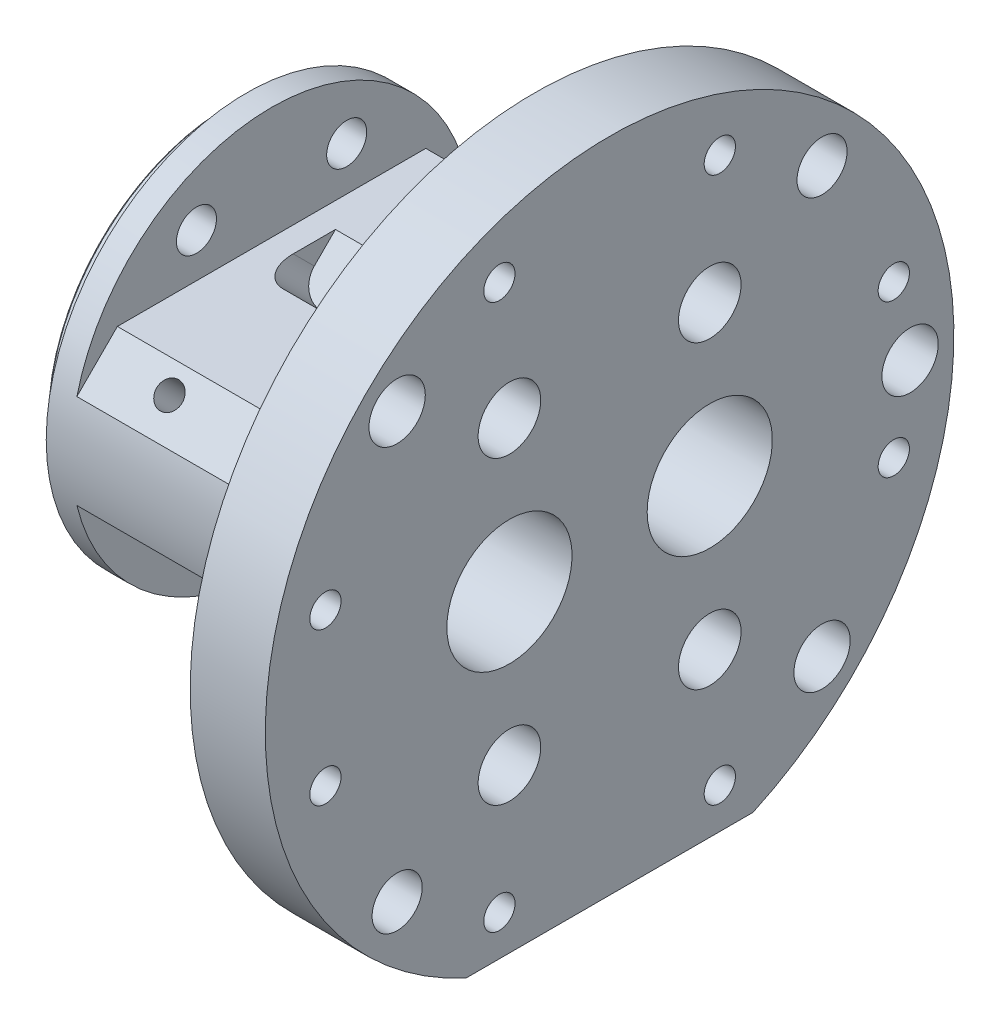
ISO-10303-21;
HEADER;
FILE_DESCRIPTION(('STEP AP214'),'2;1');
FILE_NAME('part.step','',(''),(''),'','','');
FILE_SCHEMA(('AUTOMOTIVE_DESIGN { 1 0 10303 214 1 1 1 1 }'));
ENDSEC;
DATA;
#1=APPLICATION_CONTEXT('core data for automotive mechanical design processes');
#2=APPLICATION_PROTOCOL_DEFINITION('international standard','automotive_design',2000,#1);
#3=PRODUCT_CONTEXT('',#1,'mechanical');
#4=PRODUCT('Part','Part','',(#3));
#5=PRODUCT_RELATED_PRODUCT_CATEGORY('part','',(#4));
#6=PRODUCT_DEFINITION_FORMATION('','',#4);
#7=PRODUCT_DEFINITION_CONTEXT('part definition',#1,'design');
#8=PRODUCT_DEFINITION('design','',#6,#7);
#9=PRODUCT_DEFINITION_SHAPE('','',#8);
#10=(LENGTH_UNIT() NAMED_UNIT(*) SI_UNIT(.MILLI.,.METRE.));
#11=(NAMED_UNIT(*) PLANE_ANGLE_UNIT() SI_UNIT($,.RADIAN.));
#12=(NAMED_UNIT(*) SI_UNIT($,.STERADIAN.) SOLID_ANGLE_UNIT());
#13=UNCERTAINTY_MEASURE_WITH_UNIT(LENGTH_MEASURE(1.E-05),#10,'distance_accuracy_value','');
#14=(GEOMETRIC_REPRESENTATION_CONTEXT(3) GLOBAL_UNCERTAINTY_ASSIGNED_CONTEXT((#13)) GLOBAL_UNIT_ASSIGNED_CONTEXT((#10,
#11,#12)) REPRESENTATION_CONTEXT('',''));
#15=CARTESIAN_POINT('',(0.,0.,0.));
#16=DIRECTION('',(0.,0.,1.));
#17=DIRECTION('',(1.,0.,0.));
#18=AXIS2_PLACEMENT_3D('',#15,#16,#17);
#19=CARTESIAN_POINT('',(33.7000000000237,16.,0.));
#20=DIRECTION('',(1.,0.,0.));
#21=DIRECTION('',(0.,0.,-1.));
#22=AXIS2_PLACEMENT_3D('',#19,#20,#21);
#23=PLANE('',#22);
#24=CARTESIAN_POINT('',(33.7000000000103,0.,0.));
#25=DIRECTION('',(-1.,0.,0.));
#26=DIRECTION('',(0.,0.,1.));
#27=AXIS2_PLACEMENT_3D('',#24,#25,#26);
#28=CIRCLE('',#27,27.5);
#29=CARTESIAN_POINT('',(33.7000000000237,-25.,11.4564392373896));
#30=VERTEX_POINT('',#29);
#31=CARTESIAN_POINT('',(33.7000000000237,-25.,-11.4564392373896));
#32=VERTEX_POINT('',#31);
#33=EDGE_CURVE('E209',#30,#32,#28,.T.);
#34=ORIENTED_EDGE('',*,*,#33,.T.);
#35=DIRECTION('',(0.,0.,-1.));
#36=VECTOR('',#35,1.);
#37=CARTESIAN_POINT('',(33.7000000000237,-25.,11.4564392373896));
#38=LINE('',#37,#36);
#39=EDGE_CURVE('E202',#30,#32,#38,.T.);
#40=ORIENTED_EDGE('',*,*,#39,.F.);
#41=EDGE_LOOP('',(#34,#40));
#42=FACE_BOUND('',#41,.T.);
#43=CARTESIAN_POINT('',(33.7000000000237,-6.08224755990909,-22.6992569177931));
#44=DIRECTION('',(1.,0.,0.));
#45=DIRECTION('',(0.,0.,-1.));
#46=AXIS2_PLACEMENT_3D('',#43,#44,#45);
#47=CIRCLE('',#46,1.24999999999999);
#48=CARTESIAN_POINT('',(33.7000000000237,-6.08224755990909,-23.9492569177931));
#49=VERTEX_POINT('',#48);
#50=EDGE_CURVE('E1219',#49,#49,#47,.T.);
#51=ORIENTED_EDGE('',*,*,#50,.T.);
#52=EDGE_LOOP('',(#51));
#53=FACE_BOUND('',#52,.T.);
#54=DIRECTION('',(0.,0.,1.));
#55=VECTOR('',#54,1.);
#56=CARTESIAN_POINT('',(33.7000000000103,-7.,-50.));
#57=LINE('',#56,#55);
#58=CARTESIAN_POINT('',(33.7000000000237,-7.,-12.316406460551));
#59=VERTEX_POINT('',#58);
#60=CARTESIAN_POINT('',(33.7000000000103,-7.,12.316406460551));
#61=VERTEX_POINT('',#60);
#62=EDGE_CURVE('E1319',#59,#61,#57,.T.);
#63=ORIENTED_EDGE('',*,*,#62,.F.);
#64=DIRECTION('',(0.,-0.707106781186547,0.707106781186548));
#65=VECTOR('',#64,1.);
#66=CARTESIAN_POINT('',(33.7000000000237,-1.65820323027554,-17.6582032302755));
#67=LINE('',#66,#65);
#68=CARTESIAN_POINT('',(33.7000000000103,-3.76591077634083,-15.5504956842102));
#69=VERTEX_POINT('',#68);
#70=EDGE_CURVE('E260',#59,#69,#67,.F.);
#71=ORIENTED_EDGE('',*,*,#70,.T.);
#72=CARTESIAN_POINT('',(33.7000000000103,0.,0.));
#73=DIRECTION('',(-1.,0.,0.));
#74=DIRECTION('',(0.,0.,1.));
#75=AXIS2_PLACEMENT_3D('',#72,#73,#74);
#76=CIRCLE('',#75,16.);
#77=CARTESIAN_POINT('',(33.7000000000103,3.76591077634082,-15.5504956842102));
#78=VERTEX_POINT('',#77);
#79=EDGE_CURVE('E221',#78,#69,#76,.T.);
#80=ORIENTED_EDGE('',*,*,#79,.F.);
#81=DIRECTION('',(0.,0.707106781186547,0.707106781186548));
#82=VECTOR('',#81,1.);
#83=CARTESIAN_POINT('',(33.7000000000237,17.6582032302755,-1.6582032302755));
#84=LINE('',#83,#82);
#85=CARTESIAN_POINT('',(33.7000000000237,7.,-12.316406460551));
#86=VERTEX_POINT('',#85);
#87=EDGE_CURVE('E262',#78,#86,#84,.T.);
#88=ORIENTED_EDGE('',*,*,#87,.T.);
#89=DIRECTION('',(0.,0.,1.));
#90=VECTOR('',#89,1.);
#91=CARTESIAN_POINT('',(33.7000000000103,7.,-50.));
#92=LINE('',#91,#90);
#93=CARTESIAN_POINT('',(33.7000000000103,7.,12.316406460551));
#94=VERTEX_POINT('',#93);
#95=EDGE_CURVE('E1340',#86,#94,#92,.T.);
#96=ORIENTED_EDGE('',*,*,#95,.T.);
#97=DIRECTION('',(0.,0.707106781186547,-0.707106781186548));
#98=VECTOR('',#97,1.);
#99=CARTESIAN_POINT('',(33.7000000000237,17.6582032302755,1.6582032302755));
#100=LINE('',#99,#98);
#101=CARTESIAN_POINT('',(33.7000000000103,3.76591077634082,15.5504956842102));
#102=VERTEX_POINT('',#101);
#103=EDGE_CURVE('E255',#94,#102,#100,.F.);
#104=ORIENTED_EDGE('',*,*,#103,.T.);
#105=CARTESIAN_POINT('',(33.7000000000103,-3.76591077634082,15.5504956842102));
#106=VERTEX_POINT('',#105);
#107=EDGE_CURVE('E214',#106,#102,#76,.T.);
#108=ORIENTED_EDGE('',*,*,#107,.F.);
#109=DIRECTION('',(0.,-0.707106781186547,-0.707106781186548));
#110=VECTOR('',#109,1.);
#111=CARTESIAN_POINT('',(33.7000000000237,-1.65820323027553,17.6582032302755));
#112=LINE('',#111,#110);
#113=EDGE_CURVE('E246',#106,#61,#112,.T.);
#114=ORIENTED_EDGE('',*,*,#113,.T.);
#115=EDGE_LOOP('',(#63,#71,#80,#88,#96,#104,#108,#114));
#116=FACE_BOUND('',#115,.T.);
#117=CARTESIAN_POINT('',(33.7000000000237,-6.08224755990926,22.6992569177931));
#118=DIRECTION('',(1.,0.,0.));
#119=DIRECTION('',(0.,0.,-1.));
#120=AXIS2_PLACEMENT_3D('',#117,#118,#119);
#121=CIRCLE('',#120,1.24999999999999);
#122=CARTESIAN_POINT('',(33.7000000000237,-6.08224755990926,21.4492569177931));
#123=VERTEX_POINT('',#122);
#124=EDGE_CURVE('E1201',#123,#123,#121,.T.);
#125=ORIENTED_EDGE('',*,*,#124,.T.);
#126=EDGE_LOOP('',(#125));
#127=FACE_BOUND('',#126,.T.);
#128=CARTESIAN_POINT('',(33.7000000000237,6.08224755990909,22.6992569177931));
#129=DIRECTION('',(1.,0.,0.));
#130=DIRECTION('',(0.,0.,-1.));
#131=AXIS2_PLACEMENT_3D('',#128,#129,#130);
#132=CIRCLE('',#131,1.24999999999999);
#133=CARTESIAN_POINT('',(33.7000000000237,6.08224755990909,21.4492569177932));
#134=VERTEX_POINT('',#133);
#135=EDGE_CURVE('E1231',#134,#134,#132,.T.);
#136=ORIENTED_EDGE('',*,*,#135,.T.);
#137=EDGE_LOOP('',(#136));
#138=FACE_BOUND('',#137,.T.);
#139=CARTESIAN_POINT('',(33.7000000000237,6.08224755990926,-22.6992569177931));
#140=DIRECTION('',(1.,0.,0.));
#141=DIRECTION('',(0.,0.,-1.));
#142=AXIS2_PLACEMENT_3D('',#139,#140,#141);
#143=CIRCLE('',#142,1.24999999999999);
#144=CARTESIAN_POINT('',(33.7000000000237,6.08224755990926,-23.9492569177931));
#145=VERTEX_POINT('',#144);
#146=EDGE_CURVE('E1189',#145,#145,#143,.T.);
#147=ORIENTED_EDGE('',*,*,#146,.T.);
#148=EDGE_LOOP('',(#147));
#149=FACE_BOUND('',#148,.T.);
#150=CARTESIAN_POINT('',(33.7000000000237,0.,-24.));
#151=DIRECTION('',(1.,0.,0.));
#152=DIRECTION('',(0.,0.,-1.));
#153=AXIS2_PLACEMENT_3D('',#150,#151,#152);
#154=CIRCLE('',#153,2.25);
#155=CARTESIAN_POINT('',(33.7000000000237,0.,-26.25));
#156=VERTEX_POINT('',#155);
#157=EDGE_CURVE('E587',#156,#156,#154,.F.);
#158=ORIENTED_EDGE('',*,*,#157,.F.);
#159=EDGE_LOOP('',(#158));
#160=FACE_BOUND('',#159,.T.);
#161=CARTESIAN_POINT('',(33.7000000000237,16.9705627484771,-16.9705627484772));
#162=DIRECTION('',(-1.,0.,0.));
#163=DIRECTION('',(0.,0.,1.));
#164=AXIS2_PLACEMENT_3D('',#161,#162,#163);
#165=CIRCLE('',#164,2.5);
#166=CARTESIAN_POINT('',(33.7000000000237,16.9705627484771,-14.4705627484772));
#167=VERTEX_POINT('',#166);
#168=EDGE_CURVE('E1168',#167,#167,#165,.T.);
#169=ORIENTED_EDGE('',*,*,#168,.F.);
#170=EDGE_LOOP('',(#169));
#171=FACE_BOUND('',#170,.T.);
#172=CARTESIAN_POINT('',(33.7000000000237,21.7888205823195,8.80325494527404));
#173=DIRECTION('',(1.,0.,0.));
#174=DIRECTION('',(0.,0.,-1.));
#175=AXIS2_PLACEMENT_3D('',#172,#173,#174);
#176=CIRCLE('',#175,1.24999999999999);
#177=CARTESIAN_POINT('',(33.7000000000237,21.7888205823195,7.55325494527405));
#178=VERTEX_POINT('',#177);
#179=EDGE_CURVE('E1195',#178,#178,#176,.T.);
#180=ORIENTED_EDGE('',*,*,#179,.T.);
#181=EDGE_LOOP('',(#180));
#182=FACE_BOUND('',#181,.T.);
#183=CARTESIAN_POINT('',(33.7000000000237,21.7888205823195,-8.80325494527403));
#184=DIRECTION('',(1.,0.,0.));
#185=DIRECTION('',(0.,0.,-1.));
#186=AXIS2_PLACEMENT_3D('',#183,#184,#185);
#187=CIRCLE('',#186,1.24999999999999);
#188=CARTESIAN_POINT('',(33.7000000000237,21.7888205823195,-10.053254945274));
#189=VERTEX_POINT('',#188);
#190=EDGE_CURVE('E1213',#189,#189,#187,.T.);
#191=ORIENTED_EDGE('',*,*,#190,.T.);
#192=EDGE_LOOP('',(#191));
#193=FACE_BOUND('',#192,.T.);
#194=CARTESIAN_POINT('',(33.7000000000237,16.970562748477,16.9705627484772));
#195=DIRECTION('',(1.,0.,0.));
#196=DIRECTION('',(0.,0.,-1.));
#197=AXIS2_PLACEMENT_3D('',#194,#195,#196);
#198=CIRCLE('',#197,2.25);
#199=CARTESIAN_POINT('',(33.7000000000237,16.970562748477,14.7205627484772));
#200=VERTEX_POINT('',#199);
#201=EDGE_CURVE('E1237',#200,#200,#198,.F.);
#202=ORIENTED_EDGE('',*,*,#201,.F.);
#203=EDGE_LOOP('',(#202));
#204=FACE_BOUND('',#203,.T.);
#205=CARTESIAN_POINT('',(33.7000000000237,12.,-8.));
#206=DIRECTION('',(1.,0.,0.));
#207=DIRECTION('',(0.,0.,-1.));
#208=AXIS2_PLACEMENT_3D('',#205,#206,#207);
#209=CIRCLE('',#208,2.49999999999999);
#210=CARTESIAN_POINT('',(33.7000000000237,12.,-10.5));
#211=VERTEX_POINT('',#210);
#212=EDGE_CURVE('E1153',#211,#211,#209,.F.);
#213=ORIENTED_EDGE('',*,*,#212,.F.);
#214=EDGE_LOOP('',(#213));
#215=FACE_BOUND('',#214,.T.);
#216=CARTESIAN_POINT('',(33.7000000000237,12.,8.));
#217=DIRECTION('',(1.,0.,0.));
#218=DIRECTION('',(0.,0.,-1.));
#219=AXIS2_PLACEMENT_3D('',#216,#217,#218);
#220=CIRCLE('',#219,2.49999999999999);
#221=CARTESIAN_POINT('',(33.7000000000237,12.,5.50000000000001));
#222=VERTEX_POINT('',#221);
#223=EDGE_CURVE('E1147',#222,#222,#220,.F.);
#224=ORIENTED_EDGE('',*,*,#223,.F.);
#225=EDGE_LOOP('',(#224));
#226=FACE_BOUND('',#225,.T.);
#227=CARTESIAN_POINT('',(33.7000000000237,-12.,8.));
#228=DIRECTION('',(1.,0.,0.));
#229=DIRECTION('',(0.,0.,-1.));
#230=AXIS2_PLACEMENT_3D('',#227,#228,#229);
#231=CIRCLE('',#230,2.49999999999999);
#232=CARTESIAN_POINT('',(33.7000000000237,-12.,5.50000000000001));
#233=VERTEX_POINT('',#232);
#234=EDGE_CURVE('E1165',#233,#233,#231,.F.);
#235=ORIENTED_EDGE('',*,*,#234,.F.);
#236=EDGE_LOOP('',(#235));
#237=FACE_BOUND('',#236,.T.);
#238=CARTESIAN_POINT('',(33.7000000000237,-16.9705627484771,16.9705627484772));
#239=DIRECTION('',(-1.,0.,0.));
#240=DIRECTION('',(0.,0.,1.));
#241=AXIS2_PLACEMENT_3D('',#238,#239,#240);
#242=CIRCLE('',#241,2.5);
#243=CARTESIAN_POINT('',(33.7000000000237,-16.9705627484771,19.4705627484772));
#244=VERTEX_POINT('',#243);
#245=EDGE_CURVE('E1177',#244,#244,#242,.T.);
#246=ORIENTED_EDGE('',*,*,#245,.F.);
#247=EDGE_LOOP('',(#246));
#248=FACE_BOUND('',#247,.T.);
#249=CARTESIAN_POINT('',(33.7000000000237,-21.7888205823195,-8.80325494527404));
#250=DIRECTION('',(1.,0.,0.));
#251=DIRECTION('',(0.,0.,-1.));
#252=AXIS2_PLACEMENT_3D('',#249,#250,#251);
#253=CIRCLE('',#252,1.24999999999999);
#254=CARTESIAN_POINT('',(33.7000000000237,-21.7888205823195,-10.053254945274));
#255=VERTEX_POINT('',#254);
#256=EDGE_CURVE('E1207',#255,#255,#253,.T.);
#257=ORIENTED_EDGE('',*,*,#256,.T.);
#258=EDGE_LOOP('',(#257));
#259=FACE_BOUND('',#258,.T.);
#260=CARTESIAN_POINT('',(33.7000000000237,-21.7888205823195,8.80325494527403));
#261=DIRECTION('',(1.,0.,0.));
#262=DIRECTION('',(0.,0.,-1.));
#263=AXIS2_PLACEMENT_3D('',#260,#261,#262);
#264=CIRCLE('',#263,1.24999999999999);
#265=CARTESIAN_POINT('',(33.7000000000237,-21.7888205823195,7.55325494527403));
#266=VERTEX_POINT('',#265);
#267=EDGE_CURVE('E1225',#266,#266,#264,.T.);
#268=ORIENTED_EDGE('',*,*,#267,.T.);
#269=EDGE_LOOP('',(#268));
#270=FACE_BOUND('',#269,.T.);
#271=CARTESIAN_POINT('',(33.7000000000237,-16.970562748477,-16.9705627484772));
#272=DIRECTION('',(1.,0.,0.));
#273=DIRECTION('',(0.,0.,-1.));
#274=AXIS2_PLACEMENT_3D('',#271,#272,#273);
#275=CIRCLE('',#274,2.25);
#276=CARTESIAN_POINT('',(33.7000000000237,-16.970562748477,-19.2205627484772));
#277=VERTEX_POINT('',#276);
#278=EDGE_CURVE('E1243',#277,#277,#275,.F.);
#279=ORIENTED_EDGE('',*,*,#278,.F.);
#280=EDGE_LOOP('',(#279));
#281=FACE_BOUND('',#280,.T.);
#282=CARTESIAN_POINT('',(33.7000000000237,-12.,-8.));
#283=DIRECTION('',(1.,0.,0.));
#284=DIRECTION('',(0.,0.,-1.));
#285=AXIS2_PLACEMENT_3D('',#282,#283,#284);
#286=CIRCLE('',#285,2.49999999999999);
#287=CARTESIAN_POINT('',(33.7000000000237,-12.,-10.5));
#288=VERTEX_POINT('',#287);
#289=EDGE_CURVE('E1159',#288,#288,#286,.F.);
#290=ORIENTED_EDGE('',*,*,#289,.F.);
#291=EDGE_LOOP('',(#290));
#292=FACE_BOUND('',#291,.T.);
#293=ADVANCED_FACE('F59',(#42,#53,#116,#127,#138,#149,#160,#171,#182,#193,#204,#215,#226,#237,
#248,#259,#270,#281,#292),#23,.F.);
#294=CARTESIAN_POINT('',(10.7,0.,0.));
#295=DIRECTION('',(1.,0.,0.));
#296=DIRECTION('',(0.,0.,-1.));
#297=AXIS2_PLACEMENT_3D('',#294,#295,#296);
#298=PLANE('',#297);
#299=CARTESIAN_POINT('',(10.7000000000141,0.,0.));
#300=DIRECTION('',(-1.,0.,0.));
#301=DIRECTION('',(0.,0.,1.));
#302=AXIS2_PLACEMENT_3D('',#299,#300,#301);
#303=CIRCLE('',#302,16.);
#304=CARTESIAN_POINT('',(10.7000000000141,0.,16.));
#305=VERTEX_POINT('',#304);
#306=EDGE_CURVE('E224',#305,#305,#303,.T.);
#307=ORIENTED_EDGE('',*,*,#306,.T.);
#308=EDGE_LOOP('',(#307));
#309=FACE_BOUND('',#308,.T.);
#310=CARTESIAN_POINT('',(10.7,0.,0.));
#311=DIRECTION('',(1.,0.,0.));
#312=DIRECTION('',(0.,0.,-1.));
#313=AXIS2_PLACEMENT_3D('',#310,#311,#312);
#314=CIRCLE('',#313,14.5);
#315=CARTESIAN_POINT('',(10.7,0.,-14.5));
#316=VERTEX_POINT('',#315);
#317=EDGE_CURVE('E231',#316,#316,#314,.F.);
#318=ORIENTED_EDGE('',*,*,#317,.F.);
#319=EDGE_LOOP('',(#318));
#320=FACE_BOUND('',#319,.T.);
#321=ADVANCED_FACE('F388',(#309,#320),#298,.F.);
#322=CARTESIAN_POINT('',(-200068.176472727,0.,0.));
#323=DIRECTION('',(-1.,0.,0.));
#324=DIRECTION('',(0.,0.,1.));
#325=AXIS2_PLACEMENT_3D('',#322,#323,#324);
#326=CYLINDRICAL_SURFACE('',#325,16.);
#327=ORIENTED_EDGE('',*,*,#306,.F.);
#328=EDGE_LOOP('',(#327));
#329=FACE_BOUND('',#328,.T.);
#330=CARTESIAN_POINT('',(12.7000000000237,0.,0.));
#331=DIRECTION('',(-1.,0.,0.));
#332=DIRECTION('',(0.,-1.,0.));
#333=AXIS2_PLACEMENT_3D('',#330,#331,#332);
#334=CIRCLE('',#333,16.);
#335=CARTESIAN_POINT('',(12.7000000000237,-3.76591077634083,-15.5504956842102));
#336=VERTEX_POINT('',#335);
#337=CARTESIAN_POINT('',(12.7000000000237,-3.76591077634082,15.5504956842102));
#338=VERTEX_POINT('',#337);
#339=EDGE_CURVE('E229',#336,#338,#334,.T.);
#340=ORIENTED_EDGE('',*,*,#339,.T.);
#341=DIRECTION('',(-1.,0.,0.));
#342=VECTOR('',#341,1.);
#343=CARTESIAN_POINT('',(-200068.176472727,-3.76591077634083,15.5504956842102));
#344=LINE('',#343,#342);
#345=EDGE_CURVE('E243',#338,#106,#344,.F.);
#346=ORIENTED_EDGE('',*,*,#345,.T.);
#347=ORIENTED_EDGE('',*,*,#107,.T.);
#348=DIRECTION('',(-1.,0.,0.));
#349=VECTOR('',#348,1.);
#350=CARTESIAN_POINT('',(-200068.176472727,3.76591077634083,15.5504956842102));
#351=LINE('',#350,#349);
#352=CARTESIAN_POINT('',(12.7000000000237,3.76591077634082,15.5504956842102));
#353=VERTEX_POINT('',#352);
#354=EDGE_CURVE('E240',#102,#353,#351,.T.);
#355=ORIENTED_EDGE('',*,*,#354,.T.);
#356=CARTESIAN_POINT('',(12.7000000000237,0.,0.));
#357=DIRECTION('',(-1.,0.,0.));
#358=DIRECTION('',(0.,-1.,0.));
#359=AXIS2_PLACEMENT_3D('',#356,#357,#358);
#360=CIRCLE('',#359,16.);
#361=CARTESIAN_POINT('',(12.7000000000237,3.76591077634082,-15.5504956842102));
#362=VERTEX_POINT('',#361);
#363=EDGE_CURVE('E227',#353,#362,#360,.T.);
#364=ORIENTED_EDGE('',*,*,#363,.T.);
#365=DIRECTION('',(-1.,0.,0.));
#366=VECTOR('',#365,1.);
#367=CARTESIAN_POINT('',(-200068.176472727,3.76591077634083,-15.5504956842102));
#368=LINE('',#367,#366);
#369=EDGE_CURVE('E234',#362,#78,#368,.F.);
#370=ORIENTED_EDGE('',*,*,#369,.T.);
#371=ORIENTED_EDGE('',*,*,#79,.T.);
#372=DIRECTION('',(-1.,0.,0.));
#373=VECTOR('',#372,1.);
#374=CARTESIAN_POINT('',(-200068.176472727,-3.76591077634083,-15.5504956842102));
#375=LINE('',#374,#373);
#376=EDGE_CURVE('E237',#69,#336,#375,.T.);
#377=ORIENTED_EDGE('',*,*,#376,.T.);
#378=EDGE_LOOP('',(#340,#346,#347,#355,#364,#370,#371,#377));
#379=FACE_BOUND('',#378,.T.);
#380=ADVANCED_FACE('F394',(#329,#379),#326,.T.);
#381=CARTESIAN_POINT('',(-200068.176472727,0.,0.));
#382=DIRECTION('',(-1.,0.,0.));
#383=DIRECTION('',(0.,0.,1.));
#384=AXIS2_PLACEMENT_3D('',#381,#382,#383);
#385=CYLINDRICAL_SURFACE('',#384,27.5);
#386=CARTESIAN_POINT('',(39.7000000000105,0.,0.));
#387=DIRECTION('',(-1.,0.,0.));
#388=DIRECTION('',(0.,0.,1.));
#389=AXIS2_PLACEMENT_3D('',#386,#387,#388);
#390=CIRCLE('',#389,27.5);
#391=CARTESIAN_POINT('',(39.7000000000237,-25.,11.4564392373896));
#392=VERTEX_POINT('',#391);
#393=CARTESIAN_POINT('',(39.7000000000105,-25.,-11.4564392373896));
#394=VERTEX_POINT('',#393);
#395=EDGE_CURVE('E207',#392,#394,#390,.T.);
#396=ORIENTED_EDGE('',*,*,#395,.T.);
#397=DIRECTION('',(-1.,0.,0.));
#398=VECTOR('',#397,1.);
#399=CARTESIAN_POINT('',(39.7000000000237,-25.,-11.4564392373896));
#400=LINE('',#399,#398);
#401=EDGE_CURVE('E74',#394,#32,#400,.T.);
#402=ORIENTED_EDGE('',*,*,#401,.T.);
#403=ORIENTED_EDGE('',*,*,#33,.F.);
#404=DIRECTION('',(-1.,0.,0.));
#405=VECTOR('',#404,1.);
#406=CARTESIAN_POINT('',(39.7000000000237,-25.,11.4564392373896));
#407=LINE('',#406,#405);
#408=EDGE_CURVE('E197',#392,#30,#407,.T.);
#409=ORIENTED_EDGE('',*,*,#408,.F.);
#410=EDGE_LOOP('',(#396,#402,#403,#409));
#411=FACE_BOUND('',#410,.T.);
#412=ADVANCED_FACE('F206',(#411),#385,.T.);
#413=CARTESIAN_POINT('',(39.7000000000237,27.5,0.));
#414=DIRECTION('',(-1.,0.,0.));
#415=DIRECTION('',(0.,0.,1.));
#416=AXIS2_PLACEMENT_3D('',#413,#414,#415);
#417=PLANE('',#416);
#418=CARTESIAN_POINT('',(39.7000000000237,12.,8.));
#419=DIRECTION('',(1.,0.,0.));
#420=DIRECTION('',(0.,0.,-1.));
#421=AXIS2_PLACEMENT_3D('',#418,#419,#420);
#422=CIRCLE('',#421,2.49999999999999);
#423=CARTESIAN_POINT('',(39.7000000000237,12.,5.50000000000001));
#424=VERTEX_POINT('',#423);
#425=EDGE_CURVE('E1140',#424,#424,#422,.T.);
#426=ORIENTED_EDGE('',*,*,#425,.F.);
#427=EDGE_LOOP('',(#426));
#428=FACE_BOUND('',#427,.T.);
#429=CARTESIAN_POINT('',(39.7000000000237,12.,-8.));
#430=DIRECTION('',(1.,0.,0.));
#431=DIRECTION('',(0.,0.,-1.));
#432=AXIS2_PLACEMENT_3D('',#429,#430,#431);
#433=CIRCLE('',#432,2.49999999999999);
#434=CARTESIAN_POINT('',(39.7000000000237,12.,-10.5));
#435=VERTEX_POINT('',#434);
#436=EDGE_CURVE('E1150',#435,#435,#433,.T.);
#437=ORIENTED_EDGE('',*,*,#436,.F.);
#438=EDGE_LOOP('',(#437));
#439=FACE_BOUND('',#438,.T.);
#440=CARTESIAN_POINT('',(39.7000000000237,-12.,-8.));
#441=DIRECTION('',(1.,0.,0.));
#442=DIRECTION('',(0.,0.,-1.));
#443=AXIS2_PLACEMENT_3D('',#440,#441,#442);
#444=CIRCLE('',#443,2.49999999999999);
#445=CARTESIAN_POINT('',(39.7000000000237,-12.,-10.5));
#446=VERTEX_POINT('',#445);
#447=EDGE_CURVE('E1156',#446,#446,#444,.T.);
#448=ORIENTED_EDGE('',*,*,#447,.F.);
#449=EDGE_LOOP('',(#448));
#450=FACE_BOUND('',#449,.T.);
#451=CARTESIAN_POINT('',(39.7000000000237,-12.,8.));
#452=DIRECTION('',(1.,0.,0.));
#453=DIRECTION('',(0.,0.,-1.));
#454=AXIS2_PLACEMENT_3D('',#451,#452,#453);
#455=CIRCLE('',#454,2.49999999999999);
#456=CARTESIAN_POINT('',(39.7000000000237,-12.,5.50000000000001));
#457=VERTEX_POINT('',#456);
#458=EDGE_CURVE('E1162',#457,#457,#455,.T.);
#459=ORIENTED_EDGE('',*,*,#458,.F.);
#460=EDGE_LOOP('',(#459));
#461=FACE_BOUND('',#460,.T.);
#462=CARTESIAN_POINT('',(39.7000000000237,16.9705627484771,-16.9705627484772));
#463=DIRECTION('',(-1.,0.,0.));
#464=DIRECTION('',(0.,0.,1.));
#465=AXIS2_PLACEMENT_3D('',#462,#463,#464);
#466=CIRCLE('',#465,2.);
#467=CARTESIAN_POINT('',(39.7000000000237,16.9705627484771,-14.9705627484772));
#468=VERTEX_POINT('',#467);
#469=EDGE_CURVE('E1174',#468,#468,#466,.T.);
#470=ORIENTED_EDGE('',*,*,#469,.T.);
#471=EDGE_LOOP('',(#470));
#472=FACE_BOUND('',#471,.T.);
#473=CARTESIAN_POINT('',(39.7000000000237,-16.9705627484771,16.9705627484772));
#474=DIRECTION('',(-1.,0.,0.));
#475=DIRECTION('',(0.,0.,1.));
#476=AXIS2_PLACEMENT_3D('',#473,#474,#475);
#477=CIRCLE('',#476,2.);
#478=CARTESIAN_POINT('',(39.7000000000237,-16.9705627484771,18.9705627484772));
#479=VERTEX_POINT('',#478);
#480=EDGE_CURVE('E1183',#479,#479,#477,.T.);
#481=ORIENTED_EDGE('',*,*,#480,.T.);
#482=EDGE_LOOP('',(#481));
#483=FACE_BOUND('',#482,.T.);
#484=CARTESIAN_POINT('',(39.7000000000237,6.08224755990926,-22.6992569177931));
#485=DIRECTION('',(1.,0.,0.));
#486=DIRECTION('',(0.,0.,-1.));
#487=AXIS2_PLACEMENT_3D('',#484,#485,#486);
#488=CIRCLE('',#487,1.24999999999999);
#489=CARTESIAN_POINT('',(39.7000000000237,6.08224755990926,-23.9492569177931));
#490=VERTEX_POINT('',#489);
#491=EDGE_CURVE('E1186',#490,#490,#488,.T.);
#492=ORIENTED_EDGE('',*,*,#491,.F.);
#493=EDGE_LOOP('',(#492));
#494=FACE_BOUND('',#493,.T.);
#495=CARTESIAN_POINT('',(39.7000000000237,21.7888205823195,8.80325494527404));
#496=DIRECTION('',(1.,0.,0.));
#497=DIRECTION('',(0.,0.,-1.));
#498=AXIS2_PLACEMENT_3D('',#495,#496,#497);
#499=CIRCLE('',#498,1.24999999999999);
#500=CARTESIAN_POINT('',(39.7000000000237,21.7888205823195,7.55325494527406));
#501=VERTEX_POINT('',#500);
#502=EDGE_CURVE('E1192',#501,#501,#499,.T.);
#503=ORIENTED_EDGE('',*,*,#502,.F.);
#504=EDGE_LOOP('',(#503));
#505=FACE_BOUND('',#504,.T.);
#506=CARTESIAN_POINT('',(39.7000000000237,-6.08224755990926,22.6992569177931));
#507=DIRECTION('',(1.,0.,0.));
#508=DIRECTION('',(0.,0.,-1.));
#509=AXIS2_PLACEMENT_3D('',#506,#507,#508);
#510=CIRCLE('',#509,1.24999999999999);
#511=CARTESIAN_POINT('',(39.7000000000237,-6.08224755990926,21.4492569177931));
#512=VERTEX_POINT('',#511);
#513=EDGE_CURVE('E1198',#512,#512,#510,.T.);
#514=ORIENTED_EDGE('',*,*,#513,.F.);
#515=EDGE_LOOP('',(#514));
#516=FACE_BOUND('',#515,.T.);
#517=CARTESIAN_POINT('',(39.7000000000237,-21.7888205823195,-8.80325494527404));
#518=DIRECTION('',(1.,0.,0.));
#519=DIRECTION('',(0.,0.,-1.));
#520=AXIS2_PLACEMENT_3D('',#517,#518,#519);
#521=CIRCLE('',#520,1.24999999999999);
#522=CARTESIAN_POINT('',(39.7000000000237,-21.7888205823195,-10.053254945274));
#523=VERTEX_POINT('',#522);
#524=EDGE_CURVE('E1204',#523,#523,#521,.T.);
#525=ORIENTED_EDGE('',*,*,#524,.F.);
#526=EDGE_LOOP('',(#525));
#527=FACE_BOUND('',#526,.T.);
#528=CARTESIAN_POINT('',(39.7000000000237,21.7888205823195,-8.80325494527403));
#529=DIRECTION('',(1.,0.,0.));
#530=DIRECTION('',(0.,0.,-1.));
#531=AXIS2_PLACEMENT_3D('',#528,#529,#530);
#532=CIRCLE('',#531,1.24999999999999);
#533=CARTESIAN_POINT('',(39.7000000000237,21.7888205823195,-10.053254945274));
#534=VERTEX_POINT('',#533);
#535=EDGE_CURVE('E1210',#534,#534,#532,.T.);
#536=ORIENTED_EDGE('',*,*,#535,.F.);
#537=EDGE_LOOP('',(#536));
#538=FACE_BOUND('',#537,.T.);
#539=CARTESIAN_POINT('',(39.7000000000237,-6.08224755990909,-22.6992569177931));
#540=DIRECTION('',(1.,0.,0.));
#541=DIRECTION('',(0.,0.,-1.));
#542=AXIS2_PLACEMENT_3D('',#539,#540,#541);
#543=CIRCLE('',#542,1.24999999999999);
#544=CARTESIAN_POINT('',(39.7000000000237,-6.08224755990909,-23.9492569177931));
#545=VERTEX_POINT('',#544);
#546=EDGE_CURVE('E1216',#545,#545,#543,.T.);
#547=ORIENTED_EDGE('',*,*,#546,.F.);
#548=EDGE_LOOP('',(#547));
#549=FACE_BOUND('',#548,.T.);
#550=CARTESIAN_POINT('',(39.7000000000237,-21.7888205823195,8.80325494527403));
#551=DIRECTION('',(1.,0.,0.));
#552=DIRECTION('',(0.,0.,-1.));
#553=AXIS2_PLACEMENT_3D('',#550,#551,#552);
#554=CIRCLE('',#553,1.24999999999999);
#555=CARTESIAN_POINT('',(39.7000000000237,-21.7888205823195,7.55325494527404));
#556=VERTEX_POINT('',#555);
#557=EDGE_CURVE('E1222',#556,#556,#554,.T.);
#558=ORIENTED_EDGE('',*,*,#557,.F.);
#559=EDGE_LOOP('',(#558));
#560=FACE_BOUND('',#559,.T.);
#561=CARTESIAN_POINT('',(39.7000000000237,6.08224755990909,22.6992569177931));
#562=DIRECTION('',(1.,0.,0.));
#563=DIRECTION('',(0.,0.,-1.));
#564=AXIS2_PLACEMENT_3D('',#561,#562,#563);
#565=CIRCLE('',#564,1.24999999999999);
#566=CARTESIAN_POINT('',(39.7000000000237,6.08224755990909,21.4492569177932));
#567=VERTEX_POINT('',#566);
#568=EDGE_CURVE('E1228',#567,#567,#565,.T.);
#569=ORIENTED_EDGE('',*,*,#568,.F.);
#570=EDGE_LOOP('',(#569));
#571=FACE_BOUND('',#570,.T.);
#572=CARTESIAN_POINT('',(39.7000000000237,16.970562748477,16.9705627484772));
#573=DIRECTION('',(1.,0.,0.));
#574=DIRECTION('',(0.,0.,-1.));
#575=AXIS2_PLACEMENT_3D('',#572,#573,#574);
#576=CIRCLE('',#575,2.25);
#577=CARTESIAN_POINT('',(39.7000000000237,16.970562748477,14.7205627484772));
#578=VERTEX_POINT('',#577);
#579=EDGE_CURVE('E1234',#578,#578,#576,.T.);
#580=ORIENTED_EDGE('',*,*,#579,.F.);
#581=EDGE_LOOP('',(#580));
#582=FACE_BOUND('',#581,.T.);
#583=CARTESIAN_POINT('',(39.7000000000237,-16.970562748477,-16.9705627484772));
#584=DIRECTION('',(1.,0.,0.));
#585=DIRECTION('',(0.,0.,-1.));
#586=AXIS2_PLACEMENT_3D('',#583,#584,#585);
#587=CIRCLE('',#586,2.25);
#588=CARTESIAN_POINT('',(39.7000000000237,-16.970562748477,-19.2205627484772));
#589=VERTEX_POINT('',#588);
#590=EDGE_CURVE('E1240',#589,#589,#587,.T.);
#591=ORIENTED_EDGE('',*,*,#590,.F.);
#592=EDGE_LOOP('',(#591));
#593=FACE_BOUND('',#592,.T.);
#594=CARTESIAN_POINT('',(39.7000000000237,0.,-24.));
#595=DIRECTION('',(1.,0.,0.));
#596=DIRECTION('',(0.,0.,-1.));
#597=AXIS2_PLACEMENT_3D('',#594,#595,#596);
#598=CIRCLE('',#597,2.25);
#599=CARTESIAN_POINT('',(39.7000000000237,0.,-26.25));
#600=VERTEX_POINT('',#599);
#601=EDGE_CURVE('E1245',#600,#600,#598,.T.);
#602=ORIENTED_EDGE('',*,*,#601,.F.);
#603=EDGE_LOOP('',(#602));
#604=FACE_BOUND('',#603,.T.);
#605=CARTESIAN_POINT('',(39.7000000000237,0.,8.));
#606=DIRECTION('',(-1.,0.,0.));
#607=DIRECTION('',(0.,0.,1.));
#608=AXIS2_PLACEMENT_3D('',#605,#606,#607);
#609=CIRCLE('',#608,5.);
#610=CARTESIAN_POINT('',(39.7000000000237,0.,13.));
#611=VERTEX_POINT('',#610);
#612=EDGE_CURVE('E217',#611,#611,#609,.T.);
#613=ORIENTED_EDGE('',*,*,#612,.T.);
#614=EDGE_LOOP('',(#613));
#615=FACE_BOUND('',#614,.T.);
#616=CARTESIAN_POINT('',(39.7000000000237,0.,-8.));
#617=DIRECTION('',(-1.,0.,0.));
#618=DIRECTION('',(0.,0.,1.));
#619=AXIS2_PLACEMENT_3D('',#616,#617,#618);
#620=CIRCLE('',#619,5.);
#621=CARTESIAN_POINT('',(39.7000000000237,0.,-3.));
#622=VERTEX_POINT('',#621);
#623=EDGE_CURVE('E212',#622,#622,#620,.T.);
#624=ORIENTED_EDGE('',*,*,#623,.T.);
#625=EDGE_LOOP('',(#624));
#626=FACE_BOUND('',#625,.T.);
#627=ORIENTED_EDGE('',*,*,#395,.F.);
#628=DIRECTION('',(0.,0.,-1.));
#629=VECTOR('',#628,1.);
#630=CARTESIAN_POINT('',(39.7000000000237,-25.,11.4564392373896));
#631=LINE('',#630,#629);
#632=EDGE_CURVE('E194',#392,#394,#631,.T.);
#633=ORIENTED_EDGE('',*,*,#632,.T.);
#634=EDGE_LOOP('',(#627,#633));
#635=FACE_BOUND('',#634,.T.);
#636=ADVANCED_FACE('F211',(#428,#439,#450,#461,#472,#483,#494,#505,#516,#527,#538,#549,#560,
#571,#582,#593,#604,#615,#626,#635),#417,.F.);
#637=CARTESIAN_POINT('',(12.7000000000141,16.,-50.));
#638=DIRECTION('',(-1.,0.,0.));
#639=DIRECTION('',(0.,-1.,0.));
#640=AXIS2_PLACEMENT_3D('',#637,#638,#639);
#641=PLANE('',#640);
#642=DIRECTION('',(0.,-0.707106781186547,-0.707106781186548));
#643=VECTOR('',#642,1.);
#644=CARTESIAN_POINT('',(12.7000000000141,-7.3417967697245,-26.6582032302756));
#645=LINE('',#644,#643);
#646=CARTESIAN_POINT('',(12.7000000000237,7.,-12.316406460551));
#647=VERTEX_POINT('',#646);
#648=EDGE_CURVE('E265',#647,#362,#645,.T.);
#649=ORIENTED_EDGE('',*,*,#648,.T.);
#650=ORIENTED_EDGE('',*,*,#363,.F.);
#651=DIRECTION('',(0.,-0.707106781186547,0.707106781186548));
#652=VECTOR('',#651,1.);
#653=CARTESIAN_POINT('',(12.7000000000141,42.6582032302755,-23.3417967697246));
#654=LINE('',#653,#652);
#655=CARTESIAN_POINT('',(12.7000000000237,7.,12.316406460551));
#656=VERTEX_POINT('',#655);
#657=EDGE_CURVE('E252',#353,#656,#654,.F.);
#658=ORIENTED_EDGE('',*,*,#657,.T.);
#659=DIRECTION('',(0.,0.,1.));
#660=VECTOR('',#659,1.);
#661=CARTESIAN_POINT('',(12.7000000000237,7.,-50.));
#662=LINE('',#661,#660);
#663=EDGE_CURVE('E1365',#647,#656,#662,.T.);
#664=ORIENTED_EDGE('',*,*,#663,.F.);
#665=EDGE_LOOP('',(#649,#650,#658,#664));
#666=FACE_BOUND('',#665,.T.);
#667=CARTESIAN_POINT('',(12.7000000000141,10.5,-6.));
#668=DIRECTION('',(1.,0.,0.));
#669=DIRECTION('',(0.,0.,-1.));
#670=AXIS2_PLACEMENT_3D('',#667,#668,#669);
#671=CIRCLE('',#670,1.59999999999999);
#672=CARTESIAN_POINT('',(12.7000000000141,10.5,-7.59999999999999));
#673=VERTEX_POINT('',#672);
#674=EDGE_CURVE('E1134',#673,#673,#671,.T.);
#675=ORIENTED_EDGE('',*,*,#674,.F.);
#676=EDGE_LOOP('',(#675));
#677=FACE_BOUND('',#676,.T.);
#678=CARTESIAN_POINT('',(12.7000000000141,10.5,6.));
#679=DIRECTION('',(1.,0.,0.));
#680=DIRECTION('',(0.,0.,-1.));
#681=AXIS2_PLACEMENT_3D('',#678,#679,#680);
#682=CIRCLE('',#681,1.59999999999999);
#683=CARTESIAN_POINT('',(12.7000000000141,10.5,4.40000000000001));
#684=VERTEX_POINT('',#683);
#685=EDGE_CURVE('E1137',#684,#684,#682,.T.);
#686=ORIENTED_EDGE('',*,*,#685,.F.);
#687=EDGE_LOOP('',(#686));
#688=FACE_BOUND('',#687,.T.);
#689=ADVANCED_FACE('F501',(#666,#677,#688),#641,.F.);
#690=CARTESIAN_POINT('',(12.7000000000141,-16.,-50.));
#691=DIRECTION('',(-1.,0.,0.));
#692=DIRECTION('',(0.,-1.,0.));
#693=AXIS2_PLACEMENT_3D('',#690,#691,#692);
#694=PLANE('',#693);
#695=DIRECTION('',(0.,0.707106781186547,0.707106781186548));
#696=VECTOR('',#695,1.);
#697=CARTESIAN_POINT('',(12.7000000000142,-42.6582032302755,-23.3417967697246));
#698=LINE('',#697,#696);
#699=CARTESIAN_POINT('',(12.7000000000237,-7.,12.316406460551));
#700=VERTEX_POINT('',#699);
#701=EDGE_CURVE('E249',#700,#338,#698,.T.);
#702=ORIENTED_EDGE('',*,*,#701,.T.);
#703=ORIENTED_EDGE('',*,*,#339,.F.);
#704=DIRECTION('',(0.,0.707106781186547,-0.707106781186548));
#705=VECTOR('',#704,1.);
#706=CARTESIAN_POINT('',(12.7000000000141,7.3417967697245,-26.6582032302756));
#707=LINE('',#706,#705);
#708=CARTESIAN_POINT('',(12.7000000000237,-7.,-12.316406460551));
#709=VERTEX_POINT('',#708);
#710=EDGE_CURVE('E257',#336,#709,#707,.F.);
#711=ORIENTED_EDGE('',*,*,#710,.T.);
#712=DIRECTION('',(0.,0.,1.));
#713=VECTOR('',#712,1.);
#714=CARTESIAN_POINT('',(12.7000000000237,-7.,-50.));
#715=LINE('',#714,#713);
#716=EDGE_CURVE('E1327',#709,#700,#715,.T.);
#717=ORIENTED_EDGE('',*,*,#716,.T.);
#718=EDGE_LOOP('',(#702,#703,#711,#717));
#719=FACE_BOUND('',#718,.T.);
#720=CARTESIAN_POINT('',(12.7000000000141,-10.5,6.));
#721=DIRECTION('',(1.,0.,0.));
#722=DIRECTION('',(0.,0.,-1.));
#723=AXIS2_PLACEMENT_3D('',#720,#721,#722);
#724=CIRCLE('',#723,1.59999999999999);
#725=CARTESIAN_POINT('',(12.7000000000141,-10.5,4.40000000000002));
#726=VERTEX_POINT('',#725);
#727=EDGE_CURVE('E1346',#726,#726,#724,.T.);
#728=ORIENTED_EDGE('',*,*,#727,.F.);
#729=EDGE_LOOP('',(#728));
#730=FACE_BOUND('',#729,.T.);
#731=CARTESIAN_POINT('',(12.7000000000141,-10.5,-6.));
#732=DIRECTION('',(1.,0.,0.));
#733=DIRECTION('',(0.,0.,-1.));
#734=AXIS2_PLACEMENT_3D('',#731,#732,#733);
#735=CIRCLE('',#734,1.59999999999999);
#736=CARTESIAN_POINT('',(12.7000000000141,-10.5,-7.59999999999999));
#737=VERTEX_POINT('',#736);
#738=EDGE_CURVE('E1353',#737,#737,#735,.T.);
#739=ORIENTED_EDGE('',*,*,#738,.F.);
#740=EDGE_LOOP('',(#739));
#741=FACE_BOUND('',#740,.T.);
#742=ADVANCED_FACE('F506',(#719,#730,#741),#694,.F.);
#743=CARTESIAN_POINT('',(39.7000000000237,0.,-8.));
#744=DIRECTION('',(-1.,0.,0.));
#745=DIRECTION('',(0.,0.,1.));
#746=AXIS2_PLACEMENT_3D('',#743,#744,#745);
#747=CYLINDRICAL_SURFACE('',#746,5.);
#748=CARTESIAN_POINT('',(18.2000000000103,-4.18523059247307,-10.7356616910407));
#749=CARTESIAN_POINT('',(18.1430781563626,-4.18522993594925,-10.7356639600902));
#750=CARTESIAN_POINT('',(18.0861305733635,-4.18257626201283,-10.7397357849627));
#751=CARTESIAN_POINT('',(17.9738486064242,-4.17198147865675,-10.7558410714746));
#752=CARTESIAN_POINT('',(17.9185155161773,-4.16403624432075,-10.7678807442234));
#753=CARTESIAN_POINT('',(17.8111031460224,-4.14294112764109,-10.7993561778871));
#754=CARTESIAN_POINT('',(17.7590206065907,-4.1297965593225,-10.8187843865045));
#755=CARTESIAN_POINT('',(17.6594596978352,-4.09842757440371,-10.8642014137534));
#756=CARTESIAN_POINT('',(17.6119811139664,-4.08020339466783,-10.89018992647));
#757=CARTESIAN_POINT('',(17.5222687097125,-4.03857972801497,-10.948077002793));
#758=CARTESIAN_POINT('',(17.4801132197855,-4.0151145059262,-10.9800497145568));
#759=CARTESIAN_POINT('',(17.4029280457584,-3.96343041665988,-11.0484510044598));
#760=CARTESIAN_POINT('',(17.3678988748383,-3.93521120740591,-11.0848799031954));
#761=CARTESIAN_POINT('',(17.3056551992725,-3.87415170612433,-11.161226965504));
#762=CARTESIAN_POINT('',(17.2785153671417,-3.84127137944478,-11.2011740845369));
#763=CARTESIAN_POINT('',(17.2333029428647,-3.77170712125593,-11.2828492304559));
#764=CARTESIAN_POINT('',(17.2152294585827,-3.73502356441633,-11.3245770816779));
#765=CARTESIAN_POINT('',(17.1889072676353,-3.65922696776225,-11.4078117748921));
#766=CARTESIAN_POINT('',(17.1805262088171,-3.62015451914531,-11.449313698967));
#767=CARTESIAN_POINT('',(17.1734136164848,-3.54016966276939,-11.5313565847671));
#768=CARTESIAN_POINT('',(17.1746811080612,-3.4992574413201,-11.5718976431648));
#769=CARTESIAN_POINT('',(17.1867297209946,-3.41742742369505,-11.6502537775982));
#770=CARTESIAN_POINT('',(17.197368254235,-3.37651886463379,-11.6881005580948));
#771=CARTESIAN_POINT('',(17.2276305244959,-3.29536450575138,-11.7607901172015));
#772=CARTESIAN_POINT('',(17.2472546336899,-3.25511873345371,-11.7956327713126));
#773=CARTESIAN_POINT('',(17.295061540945,-3.17634008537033,-11.8618039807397));
#774=CARTESIAN_POINT('',(17.3232997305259,-3.1378202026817,-11.8931079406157));
#775=CARTESIAN_POINT('',(17.3874921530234,-3.06408600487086,-11.9514034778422));
#776=CARTESIAN_POINT('',(17.4234473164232,-3.02887208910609,-11.9783945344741));
#777=CARTESIAN_POINT('',(17.5028337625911,-2.96239881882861,-12.0281448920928));
#778=CARTESIAN_POINT('',(17.546389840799,-2.93122364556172,-12.0508176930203));
#779=CARTESIAN_POINT('',(17.6393302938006,-2.87481768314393,-12.0910422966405));
#780=CARTESIAN_POINT('',(17.6887147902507,-2.84958701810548,-12.108593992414));
#781=CARTESIAN_POINT('',(17.7920891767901,-2.80607791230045,-12.1384330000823));
#782=CARTESIAN_POINT('',(17.8460895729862,-2.78781587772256,-12.1507078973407));
#783=CARTESIAN_POINT('',(17.9570590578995,-2.75916129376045,-12.1698115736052));
#784=CARTESIAN_POINT('',(18.0140277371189,-2.74876766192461,-12.1766411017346));
#785=CARTESIAN_POINT('',(18.128220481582,-2.73645844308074,-12.1847161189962));
#786=CARTESIAN_POINT('',(18.18542158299,-2.73439393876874,-12.1860596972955));
#787=CARTESIAN_POINT('',(18.2994083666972,-2.738430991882,-12.1834198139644));
#788=CARTESIAN_POINT('',(18.3561940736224,-2.74453206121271,-12.1794366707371));
#789=CARTESIAN_POINT('',(18.4671456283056,-2.7645073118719,-12.1662499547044));
#790=CARTESIAN_POINT('',(18.5213322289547,-2.77830190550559,-12.1570998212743));
#791=CARTESIAN_POINT('',(18.6262180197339,-2.81299398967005,-12.1337029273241));
#792=CARTESIAN_POINT('',(18.6769169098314,-2.83389209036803,-12.1194557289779));
#793=CARTESIAN_POINT('',(18.7741502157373,-2.88225206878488,-12.0857679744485));
#794=CARTESIAN_POINT('',(18.8206183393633,-2.90979964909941,-12.0662591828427));
#795=CARTESIAN_POINT('',(18.9073752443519,-2.97021199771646,-12.0223416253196));
#796=CARTESIAN_POINT('',(18.9476633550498,-3.00307734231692,-11.9979323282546));
#797=CARTESIAN_POINT('',(19.0215828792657,-3.07347432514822,-11.944077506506));
#798=CARTESIAN_POINT('',(19.0550959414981,-3.11107290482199,-11.9145568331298));
#799=CARTESIAN_POINT('',(19.1136728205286,-3.18913410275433,-11.8512265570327));
#800=CARTESIAN_POINT('',(19.1387370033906,-3.22959659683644,-11.8174171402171));
#801=CARTESIAN_POINT('',(19.1795341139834,-3.31172384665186,-11.7463865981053));
#802=CARTESIAN_POINT('',(19.1953216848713,-3.35338001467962,-11.7091869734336));
#803=CARTESIAN_POINT('',(19.2172899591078,-3.43673031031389,-11.6320936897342));
#804=CARTESIAN_POINT('',(19.2234718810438,-3.47842443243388,-11.5922003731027));
#805=CARTESIAN_POINT('',(19.226004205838,-3.55978889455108,-11.5115700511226));
#806=CARTESIAN_POINT('',(19.2225322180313,-3.59948229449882,-11.4708617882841));
#807=CARTESIAN_POINT('',(19.2062487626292,-3.67654864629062,-11.3891217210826));
#808=CARTESIAN_POINT('',(19.1934374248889,-3.71392163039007,-11.3480899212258));
#809=CARTESIAN_POINT('',(19.1589195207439,-3.78535777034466,-11.2671053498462));
#810=CARTESIAN_POINT('',(19.1372352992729,-3.81942897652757,-11.2271501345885));
#811=CARTESIAN_POINT('',(19.0856101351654,-3.88369170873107,-11.1495207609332));
#812=CARTESIAN_POINT('',(19.055668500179,-3.91388290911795,-11.1118467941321));
#813=CARTESIAN_POINT('',(18.9877844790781,-3.97037239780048,-11.0394554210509));
#814=CARTESIAN_POINT('',(18.9497155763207,-3.99659637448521,-11.004798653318));
#815=CARTESIAN_POINT('',(18.8669164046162,-4.04418485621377,-10.9404378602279));
#816=CARTESIAN_POINT('',(18.8221845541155,-4.06554820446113,-10.9107350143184));
#817=CARTESIAN_POINT('',(18.7267155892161,-4.10338837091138,-10.8571480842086));
#818=CARTESIAN_POINT('',(18.6759156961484,-4.11980656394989,-10.8333343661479));
#819=CARTESIAN_POINT('',(18.570162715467,-4.14724642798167,-10.7930174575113));
#820=CARTESIAN_POINT('',(18.5152133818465,-4.15827291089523,-10.7765077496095));
#821=CARTESIAN_POINT('',(18.416797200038,-4.17277040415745,-10.7546524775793));
#822=CARTESIAN_POINT('',(18.3738849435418,-4.17743995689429,-10.7475494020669));
#823=CARTESIAN_POINT('',(18.2873201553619,-4.18367024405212,-10.73805322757));
#824=CARTESIAN_POINT('',(18.243667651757,-4.18523109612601,-10.7356599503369));
#825=CARTESIAN_POINT('',(18.2000000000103,-4.18523059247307,-10.7356616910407));
#826=B_SPLINE_CURVE_WITH_KNOTS('',3,(#748,#749,#750,#751,#752,#753,#754,#755,#756,#757,#758,
#759,#760,#761,#762,#763,#764,#765,#766,#767,#768,#769,#770,#771,#772,#773,#774,#775,#776,#777,
#778,#779,#780,#781,#782,#783,#784,#785,#786,#787,#788,#789,#790,#791,#792,#793,#794,#795,#796,
#797,#798,#799,#800,#801,#802,#803,#804,#805,#806,#807,#808,#809,#810,#811,#812,#813,#814,#815,
#816,#817,#818,#819,#820,#821,#822,#823,#824,#825),.UNSPECIFIED.,.T.,.F.,(4,2,2,2,2,2,2,2,2,2,2,
2,2,2,2,2,2,2,2,2,2,2,2,2,2,2,2,2,2,2,2,2,2,2,2,2,2,2,4),(0.,0.170605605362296,
0.341344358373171,0.511909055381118,0.682465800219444,0.85529557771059,1.02813779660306,
1.20256633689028,1.37697770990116,1.54897823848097,1.72096138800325,1.89037201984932,
2.059789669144,2.23032055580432,2.40087201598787,2.57454521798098,2.74822204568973,
2.92230527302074,3.09636454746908,3.26729762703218,3.43822048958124,3.60740714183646,
3.77660833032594,3.94811913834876,4.11964854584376,4.29395542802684,4.46825475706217,
4.64151682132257,4.81475690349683,4.98483097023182,5.15490267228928,5.32454868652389,
5.49420892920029,5.66673292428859,5.83929793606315,6.01383475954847,6.188215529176,
6.31910075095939,6.44998101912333),.UNSPECIFIED.);
#827=CARTESIAN_POINT('',(18.2000000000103,-4.18523059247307,-10.7356616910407));
#828=VERTEX_POINT('',#827);
#829=EDGE_CURVE('E515',#828,#828,#826,.T.);
#830=ORIENTED_EDGE('',*,*,#829,.T.);
#831=EDGE_LOOP('',(#830));
#832=FACE_BOUND('',#831,.T.);
#833=CARTESIAN_POINT('',(18.2000000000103,2.73566169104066,-3.81476940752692));
#834=CARTESIAN_POINT('',(18.2569218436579,2.73566396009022,-3.81477006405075));
#835=CARTESIAN_POINT('',(18.3138694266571,2.73973578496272,-3.81742373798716));
#836=CARTESIAN_POINT('',(18.4261513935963,2.75584107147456,-3.82801852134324));
#837=CARTESIAN_POINT('',(18.4814844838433,2.76788074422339,-3.83596375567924));
#838=CARTESIAN_POINT('',(18.5888968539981,2.79935617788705,-3.8570588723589));
#839=CARTESIAN_POINT('',(18.6409793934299,2.81878438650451,-3.8702034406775));
#840=CARTESIAN_POINT('',(18.7405403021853,2.86420141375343,-3.90157242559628));
#841=CARTESIAN_POINT('',(18.7880188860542,2.89018992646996,-3.91979660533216));
#842=CARTESIAN_POINT('',(18.8777312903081,2.94807700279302,-3.96142027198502));
#843=CARTESIAN_POINT('',(18.9198867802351,2.9800497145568,-3.98488549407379));
#844=CARTESIAN_POINT('',(18.9970719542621,3.04845100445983,-4.03656958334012));
#845=CARTESIAN_POINT('',(19.0321011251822,3.08487990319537,-4.06478879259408));
#846=CARTESIAN_POINT('',(19.0943448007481,3.16122696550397,-4.12584829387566));
#847=CARTESIAN_POINT('',(19.1214846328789,3.20117408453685,-4.15872862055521));
#848=CARTESIAN_POINT('',(19.1666970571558,3.28284923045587,-4.22829287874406));
#849=CARTESIAN_POINT('',(19.1847705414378,3.32457708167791,-4.26497643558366));
#850=CARTESIAN_POINT('',(19.2110927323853,3.40781177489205,-4.34077303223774));
#851=CARTESIAN_POINT('',(19.2194737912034,3.449313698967,-4.37984548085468));
#852=CARTESIAN_POINT('',(19.2265863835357,3.53135658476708,-4.4598303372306));
#853=CARTESIAN_POINT('',(19.2253188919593,3.57189764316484,-4.50074255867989));
#854=CARTESIAN_POINT('',(19.213270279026,3.65025377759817,-4.58257257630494));
#855=CARTESIAN_POINT('',(19.2026317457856,3.6881005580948,-4.6234811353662));
#856=CARTESIAN_POINT('',(19.1723694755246,3.76079011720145,-4.70463549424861));
#857=CARTESIAN_POINT('',(19.1527453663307,3.79563277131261,-4.74488126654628));
#858=CARTESIAN_POINT('',(19.1049384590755,3.86180398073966,-4.82365991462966));
#859=CARTESIAN_POINT('',(19.0767002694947,3.89310794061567,-4.86217979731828));
#860=CARTESIAN_POINT('',(19.0125078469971,3.95140347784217,-4.93591399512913));
#861=CARTESIAN_POINT('',(18.9765526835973,3.97839453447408,-4.9711279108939));
#862=CARTESIAN_POINT('',(18.8971662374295,4.02814489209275,-5.03760118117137));
#863=CARTESIAN_POINT('',(18.8536101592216,4.05081769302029,-5.06877635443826));
#864=CARTESIAN_POINT('',(18.76066970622,4.09104229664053,-5.12518231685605));
#865=CARTESIAN_POINT('',(18.7112852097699,4.10859399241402,-5.15041298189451));
#866=CARTESIAN_POINT('',(18.6079108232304,4.13843300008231,-5.19392208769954));
#867=CARTESIAN_POINT('',(18.5539104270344,4.15070789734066,-5.21218412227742));
#868=CARTESIAN_POINT('',(18.442940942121,4.16981157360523,-5.24083870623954));
#869=CARTESIAN_POINT('',(18.3859722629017,4.1766411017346,-5.25123233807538));
#870=CARTESIAN_POINT('',(18.2717795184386,4.1847161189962,-5.26354155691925));
#871=CARTESIAN_POINT('',(18.2145784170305,4.18605969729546,-5.26560606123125));
#872=CARTESIAN_POINT('',(18.1005916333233,4.18341981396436,-5.26156900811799));
#873=CARTESIAN_POINT('',(18.0438059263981,4.17943667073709,-5.25546793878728));
#874=CARTESIAN_POINT('',(17.932854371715,4.16624995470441,-5.23549268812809));
#875=CARTESIAN_POINT('',(17.8786677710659,4.15709982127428,-5.2216980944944));
#876=CARTESIAN_POINT('',(17.7737819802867,4.13370292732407,-5.18700601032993));
#877=CARTESIAN_POINT('',(17.7230830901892,4.11945572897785,-5.16610790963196));
#878=CARTESIAN_POINT('',(17.6258497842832,4.08576797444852,-5.1177479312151));
#879=CARTESIAN_POINT('',(17.5793816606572,4.06625918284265,-5.09020035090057));
#880=CARTESIAN_POINT('',(17.4926247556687,4.0223416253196,-5.02978800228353));
#881=CARTESIAN_POINT('',(17.4523366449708,3.99793232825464,-4.99692265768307));
#882=CARTESIAN_POINT('',(17.3784171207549,3.94407750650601,-4.92652567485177));
#883=CARTESIAN_POINT('',(17.3449040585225,3.91455683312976,-4.888927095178));
#884=CARTESIAN_POINT('',(17.2863271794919,3.85122655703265,-4.81086589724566));
#885=CARTESIAN_POINT('',(17.26126299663,3.81741714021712,-4.77040340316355));
#886=CARTESIAN_POINT('',(17.2204658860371,3.74638659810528,-4.68827615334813));
#887=CARTESIAN_POINT('',(17.2046783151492,3.70918697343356,-4.64661998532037));
#888=CARTESIAN_POINT('',(17.1827100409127,3.63209368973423,-4.5632696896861));
#889=CARTESIAN_POINT('',(17.1765281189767,3.59220037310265,-4.5215755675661));
#890=CARTESIAN_POINT('',(17.1739957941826,3.51157005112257,-4.44021110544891));
#891=CARTESIAN_POINT('',(17.1774677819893,3.4708617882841,-4.40051770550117));
#892=CARTESIAN_POINT('',(17.1937512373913,3.38912172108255,-4.32345135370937));
#893=CARTESIAN_POINT('',(17.2065625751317,3.3480899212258,-4.28607836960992));
#894=CARTESIAN_POINT('',(17.2410804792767,3.26710534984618,-4.21464222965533));
#895=CARTESIAN_POINT('',(17.2627647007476,3.22715013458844,-4.18057102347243));
#896=CARTESIAN_POINT('',(17.3143898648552,3.1495207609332,-4.11630829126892));
#897=CARTESIAN_POINT('',(17.3443314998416,3.11184679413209,-4.08611709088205));
#898=CARTESIAN_POINT('',(17.4122155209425,3.03945542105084,-4.02962760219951));
#899=CARTESIAN_POINT('',(17.4502844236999,3.00479865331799,-4.00340362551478));
#900=CARTESIAN_POINT('',(17.5330835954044,2.94043786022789,-3.95581514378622));
#901=CARTESIAN_POINT('',(17.577815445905,2.91073501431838,-3.93445179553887));
#902=CARTESIAN_POINT('',(17.6732844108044,2.85714808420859,-3.89661162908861));
#903=CARTESIAN_POINT('',(17.7240843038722,2.83333436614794,-3.8801934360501));
#904=CARTESIAN_POINT('',(17.8298372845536,2.79301745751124,-3.85275357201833));
#905=CARTESIAN_POINT('',(17.884786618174,2.77650774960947,-3.84172708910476));
#906=CARTESIAN_POINT('',(17.9832027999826,2.75465247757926,-3.82722959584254));
#907=CARTESIAN_POINT('',(18.0261150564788,2.74754940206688,-3.8225600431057));
#908=CARTESIAN_POINT('',(18.1126798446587,2.73805322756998,-3.81632975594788));
#909=CARTESIAN_POINT('',(18.1563323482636,2.73565995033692,-3.81476890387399));
#910=CARTESIAN_POINT('',(18.2000000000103,2.73566169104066,-3.81476940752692));
#911=B_SPLINE_CURVE_WITH_KNOTS('',3,(#833,#834,#835,#836,#837,#838,#839,#840,#841,#842,#843,
#844,#845,#846,#847,#848,#849,#850,#851,#852,#853,#854,#855,#856,#857,#858,#859,#860,#861,#862,
#863,#864,#865,#866,#867,#868,#869,#870,#871,#872,#873,#874,#875,#876,#877,#878,#879,#880,#881,
#882,#883,#884,#885,#886,#887,#888,#889,#890,#891,#892,#893,#894,#895,#896,#897,#898,#899,#900,
#901,#902,#903,#904,#905,#906,#907,#908,#909,#910),.UNSPECIFIED.,.T.,.F.,(4,2,2,2,2,2,2,2,2,2,2,
2,2,2,2,2,2,2,2,2,2,2,2,2,2,2,2,2,2,2,2,2,2,2,2,2,2,2,4),(0.,0.170605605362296,
0.341344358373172,0.511909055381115,0.682465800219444,0.855295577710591,1.02813779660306,
1.20256633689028,1.37697770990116,1.54897823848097,1.72096138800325,1.89037201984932,
2.059789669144,2.23032055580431,2.40087201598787,2.57454521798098,2.74822204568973,
2.92230527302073,3.09636454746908,3.26729762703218,3.43822048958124,3.60740714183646,
3.77660833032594,3.94811913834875,4.11964854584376,4.29395542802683,4.46825475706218,
4.64151682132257,4.81475690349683,4.98483097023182,5.15490267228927,5.32454868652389,
5.49420892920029,5.66673292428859,5.83929793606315,6.01383475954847,6.18821552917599,
6.31910075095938,6.44998101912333),.UNSPECIFIED.);
#912=CARTESIAN_POINT('',(18.2000000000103,2.73566169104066,-3.81476940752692));
#913=VERTEX_POINT('',#912);
#914=EDGE_CURVE('E365',#913,#913,#911,.T.);
#915=ORIENTED_EDGE('',*,*,#914,.T.);
#916=EDGE_LOOP('',(#915));
#917=FACE_BOUND('',#916,.T.);
#918=CARTESIAN_POINT('',(18.2000000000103,2.73566169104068,-12.1852305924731));
#919=CARTESIAN_POINT('',(18.1430781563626,2.73566396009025,-12.1852299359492));
#920=CARTESIAN_POINT('',(18.0861305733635,2.73973578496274,-12.1825762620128));
#921=CARTESIAN_POINT('',(17.9738486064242,2.75584107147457,-12.1719814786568));
#922=CARTESIAN_POINT('',(17.9185155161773,2.7678807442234,-12.1640362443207));
#923=CARTESIAN_POINT('',(17.8111031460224,2.79935617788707,-12.1429411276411));
#924=CARTESIAN_POINT('',(17.7590206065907,2.81878438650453,-12.1297965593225));
#925=CARTESIAN_POINT('',(17.6594596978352,2.86420141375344,-12.0984275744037));
#926=CARTESIAN_POINT('',(17.6119811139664,2.89018992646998,-12.0802033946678));
#927=CARTESIAN_POINT('',(17.5222687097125,2.94807700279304,-12.038579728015));
#928=CARTESIAN_POINT('',(17.4801132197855,2.98004971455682,-12.0151145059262));
#929=CARTESIAN_POINT('',(17.4029280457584,3.04845100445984,-11.9634304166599));
#930=CARTESIAN_POINT('',(17.3678988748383,3.08487990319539,-11.9352112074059));
#931=CARTESIAN_POINT('',(17.3056551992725,3.16122696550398,-11.8741517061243));
#932=CARTESIAN_POINT('',(17.2785153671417,3.20117408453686,-11.8412713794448));
#933=CARTESIAN_POINT('',(17.2333029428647,3.28284923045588,-11.7717071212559));
#934=CARTESIAN_POINT('',(17.2152294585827,3.32457708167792,-11.7350235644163));
#935=CARTESIAN_POINT('',(17.1889072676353,3.40781177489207,-11.6592269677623));
#936=CARTESIAN_POINT('',(17.1805262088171,3.44931369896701,-11.6201545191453));
#937=CARTESIAN_POINT('',(17.1734136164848,3.53135658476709,-11.5401696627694));
#938=CARTESIAN_POINT('',(17.1746811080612,3.57189764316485,-11.4992574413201));
#939=CARTESIAN_POINT('',(17.1867297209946,3.65025377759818,-11.4174274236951));
#940=CARTESIAN_POINT('',(17.1973682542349,3.68810055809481,-11.3765188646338));
#941=CARTESIAN_POINT('',(17.2276305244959,3.76079011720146,-11.2953645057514));
#942=CARTESIAN_POINT('',(17.2472546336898,3.79563277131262,-11.2551187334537));
#943=CARTESIAN_POINT('',(17.295061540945,3.86180398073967,-11.1763400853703));
#944=CARTESIAN_POINT('',(17.3232997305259,3.89310794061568,-11.1378202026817));
#945=CARTESIAN_POINT('',(17.3874921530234,3.95140347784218,-11.0640860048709));
#946=CARTESIAN_POINT('',(17.4234473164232,3.97839453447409,-11.0288720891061));
#947=CARTESIAN_POINT('',(17.5028337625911,4.02814489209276,-10.9623988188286));
#948=CARTESIAN_POINT('',(17.546389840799,4.05081769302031,-10.9312236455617));
#949=CARTESIAN_POINT('',(17.6393302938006,4.09104229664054,-10.8748176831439));
#950=CARTESIAN_POINT('',(17.6887147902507,4.10859399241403,-10.8495870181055));
#951=CARTESIAN_POINT('',(17.7920891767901,4.13843300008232,-10.8060779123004));
#952=CARTESIAN_POINT('',(17.8460895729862,4.15070789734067,-10.7878158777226));
#953=CARTESIAN_POINT('',(17.9570590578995,4.16981157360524,-10.7591612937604));
#954=CARTESIAN_POINT('',(18.0140277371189,4.17664110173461,-10.7487676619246));
#955=CARTESIAN_POINT('',(18.128220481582,4.18471611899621,-10.7364584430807));
#956=CARTESIAN_POINT('',(18.18542158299,4.18605969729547,-10.7343939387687));
#957=CARTESIAN_POINT('',(18.2994083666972,4.18341981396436,-10.738430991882));
#958=CARTESIAN_POINT('',(18.3561940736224,4.1794366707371,-10.7445320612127));
#959=CARTESIAN_POINT('',(18.4671456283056,4.16624995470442,-10.7645073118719));
#960=CARTESIAN_POINT('',(18.5213322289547,4.15709982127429,-10.7783019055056));
#961=CARTESIAN_POINT('',(18.6262180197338,4.13370292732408,-10.8129939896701));
#962=CARTESIAN_POINT('',(18.6769169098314,4.11945572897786,-10.833892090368));
#963=CARTESIAN_POINT('',(18.7741502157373,4.08576797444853,-10.8822520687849));
#964=CARTESIAN_POINT('',(18.8206183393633,4.06625918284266,-10.9097996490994));
#965=CARTESIAN_POINT('',(18.9073752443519,4.02234162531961,-10.9702119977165));
#966=CARTESIAN_POINT('',(18.9476633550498,3.99793232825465,-11.0030773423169));
#967=CARTESIAN_POINT('',(19.0215828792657,3.94407750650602,-11.0734743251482));
#968=CARTESIAN_POINT('',(19.0550959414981,3.91455683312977,-11.111072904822));
#969=CARTESIAN_POINT('',(19.1136728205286,3.85122655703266,-11.1891341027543));
#970=CARTESIAN_POINT('',(19.1387370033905,3.81741714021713,-11.2295965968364));
#971=CARTESIAN_POINT('',(19.1795341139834,3.74638659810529,-11.3117238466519));
#972=CARTESIAN_POINT('',(19.1953216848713,3.70918697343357,-11.3533800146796));
#973=CARTESIAN_POINT('',(19.2172899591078,3.63209368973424,-11.4367303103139));
#974=CARTESIAN_POINT('',(19.2234718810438,3.59220037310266,-11.4784244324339));
#975=CARTESIAN_POINT('',(19.226004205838,3.51157005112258,-11.5597888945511));
#976=CARTESIAN_POINT('',(19.2225322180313,3.47086178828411,-11.5994822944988));
#977=CARTESIAN_POINT('',(19.2062487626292,3.38912172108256,-11.6765486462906));
#978=CARTESIAN_POINT('',(19.1934374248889,3.34808992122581,-11.7139216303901));
#979=CARTESIAN_POINT('',(19.1589195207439,3.26710534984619,-11.7853577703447));
#980=CARTESIAN_POINT('',(19.1372352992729,3.22715013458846,-11.8194289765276));
#981=CARTESIAN_POINT('',(19.0856101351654,3.14952076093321,-11.8836917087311));
#982=CARTESIAN_POINT('',(19.0556685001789,3.1118467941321,-11.9138829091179));
#983=CARTESIAN_POINT('',(18.987784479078,3.03945542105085,-11.9703723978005));
#984=CARTESIAN_POINT('',(18.9497155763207,3.00479865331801,-11.9965963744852));
#985=CARTESIAN_POINT('',(18.8669164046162,2.94043786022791,-12.0441848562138));
#986=CARTESIAN_POINT('',(18.8221845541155,2.9107350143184,-12.0655482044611));
#987=CARTESIAN_POINT('',(18.7267155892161,2.85714808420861,-12.1033883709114));
#988=CARTESIAN_POINT('',(18.6759156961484,2.83333436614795,-12.1198065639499));
#989=CARTESIAN_POINT('',(18.5701627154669,2.79301745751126,-12.1472464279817));
#990=CARTESIAN_POINT('',(18.5152133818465,2.77650774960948,-12.1582729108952));
#991=CARTESIAN_POINT('',(18.416797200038,2.75465247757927,-12.1727704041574));
#992=CARTESIAN_POINT('',(18.3738849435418,2.74754940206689,-12.1774399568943));
#993=CARTESIAN_POINT('',(18.2873201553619,2.73805322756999,-12.1836702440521));
#994=CARTESIAN_POINT('',(18.2436676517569,2.73565995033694,-12.185231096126));
#995=CARTESIAN_POINT('',(18.2000000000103,2.73566169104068,-12.1852305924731));
#996=B_SPLINE_CURVE_WITH_KNOTS('',3,(#918,#919,#920,#921,#922,#923,#924,#925,#926,#927,#928,
#929,#930,#931,#932,#933,#934,#935,#936,#937,#938,#939,#940,#941,#942,#943,#944,#945,#946,#947,
#948,#949,#950,#951,#952,#953,#954,#955,#956,#957,#958,#959,#960,#961,#962,#963,#964,#965,#966,
#967,#968,#969,#970,#971,#972,#973,#974,#975,#976,#977,#978,#979,#980,#981,#982,#983,#984,#985,
#986,#987,#988,#989,#990,#991,#992,#993,#994,#995),.UNSPECIFIED.,.T.,.F.,(4,2,2,2,2,2,2,2,2,2,2,
2,2,2,2,2,2,2,2,2,2,2,2,2,2,2,2,2,2,2,2,2,2,2,2,2,2,2,4),(0.,0.170605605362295,
0.341344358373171,0.511909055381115,0.682465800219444,0.855295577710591,1.02813779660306,
1.20256633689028,1.37697770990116,1.54897823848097,1.72096138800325,1.89037201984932,
2.059789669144,2.23032055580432,2.40087201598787,2.57454521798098,2.74822204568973,
2.92230527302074,3.09636454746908,3.26729762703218,3.43822048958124,3.60740714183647,
3.77660833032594,3.94811913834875,4.11964854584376,4.29395542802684,4.46825475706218,
4.64151682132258,4.81475690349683,4.98483097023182,5.15490267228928,5.32454868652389,
5.49420892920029,5.66673292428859,5.83929793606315,6.01383475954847,6.18821552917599,
6.31910075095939,6.44998101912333),.UNSPECIFIED.);
#997=CARTESIAN_POINT('',(18.2000000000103,2.73566169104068,-12.1852305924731));
#998=VERTEX_POINT('',#997);
#999=EDGE_CURVE('E276',#998,#998,#996,.T.);
#1000=ORIENTED_EDGE('',*,*,#999,.T.);
#1001=EDGE_LOOP('',(#1000));
#1002=FACE_BOUND('',#1001,.T.);
#1003=CARTESIAN_POINT('',(18.2000000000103,-4.18523059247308,-5.26433830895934));
#1004=CARTESIAN_POINT('',(18.2569218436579,-4.18522993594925,-5.26433603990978));
#1005=CARTESIAN_POINT('',(18.313869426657,-4.18257626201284,-5.26026421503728));
#1006=CARTESIAN_POINT('',(18.4261513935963,-4.17198147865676,-5.24415892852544));
#1007=CARTESIAN_POINT('',(18.4814844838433,-4.16403624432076,-5.23211925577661));
#1008=CARTESIAN_POINT('',(18.5888968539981,-4.1429411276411,-5.20064382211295));
#1009=CARTESIAN_POINT('',(18.6409793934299,-4.1297965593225,-5.18121561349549));
#1010=CARTESIAN_POINT('',(18.7405403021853,-4.09842757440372,-5.13579858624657));
#1011=CARTESIAN_POINT('',(18.7880188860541,-4.08020339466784,-5.10981007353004));
#1012=CARTESIAN_POINT('',(18.877731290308,-4.03857972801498,-5.05192299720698));
#1013=CARTESIAN_POINT('',(18.9198867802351,-4.01511450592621,-5.0199502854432));
#1014=CARTESIAN_POINT('',(18.9970719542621,-3.96343041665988,-4.95154899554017));
#1015=CARTESIAN_POINT('',(19.0321011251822,-3.93521120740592,-4.91512009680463));
#1016=CARTESIAN_POINT('',(19.0943448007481,-3.87415170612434,-4.83877303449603));
#1017=CARTESIAN_POINT('',(19.1214846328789,-3.84127137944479,-4.79882591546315));
#1018=CARTESIAN_POINT('',(19.1666970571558,-3.77170712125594,-4.71715076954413));
#1019=CARTESIAN_POINT('',(19.1847705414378,-3.73502356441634,-4.67542291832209));
#1020=CARTESIAN_POINT('',(19.2110927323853,-3.65922696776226,-4.59218822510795));
#1021=CARTESIAN_POINT('',(19.2194737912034,-3.62015451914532,-4.550686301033));
#1022=CARTESIAN_POINT('',(19.2265863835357,-3.5401696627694,-4.46864341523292));
#1023=CARTESIAN_POINT('',(19.2253188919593,-3.49925744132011,-4.42810235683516));
#1024=CARTESIAN_POINT('',(19.213270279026,-3.41742742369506,-4.34974622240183));
#1025=CARTESIAN_POINT('',(19.2026317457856,-3.3765188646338,-4.3118994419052));
#1026=CARTESIAN_POINT('',(19.1723694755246,-3.29536450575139,-4.23920988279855));
#1027=CARTESIAN_POINT('',(19.1527453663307,-3.25511873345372,-4.20436722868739));
#1028=CARTESIAN_POINT('',(19.1049384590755,-3.17634008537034,-4.13819601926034));
#1029=CARTESIAN_POINT('',(19.0767002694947,-3.13782020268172,-4.10689205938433));
#1030=CARTESIAN_POINT('',(19.0125078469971,-3.06408600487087,-4.04859652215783));
#1031=CARTESIAN_POINT('',(18.9765526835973,-3.0288720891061,-4.02160546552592));
#1032=CARTESIAN_POINT('',(18.8971662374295,-2.96239881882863,-3.97185510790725));
#1033=CARTESIAN_POINT('',(18.8536101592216,-2.93122364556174,-3.94918230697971));
#1034=CARTESIAN_POINT('',(18.7606697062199,-2.87481768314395,-3.90895770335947));
#1035=CARTESIAN_POINT('',(18.7112852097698,-2.84958701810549,-3.89140600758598));
#1036=CARTESIAN_POINT('',(18.6079108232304,-2.80607791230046,-3.86156699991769));
#1037=CARTESIAN_POINT('',(18.5539104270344,-2.78781587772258,-3.84929210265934));
#1038=CARTESIAN_POINT('',(18.442940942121,-2.75916129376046,-3.83018842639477));
#1039=CARTESIAN_POINT('',(18.3859722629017,-2.74876766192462,-3.8233588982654));
#1040=CARTESIAN_POINT('',(18.2717795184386,-2.73645844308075,-3.8152838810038));
#1041=CARTESIAN_POINT('',(18.2145784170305,-2.73439393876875,-3.81394030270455));
#1042=CARTESIAN_POINT('',(18.1005916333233,-2.73843099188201,-3.81658018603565));
#1043=CARTESIAN_POINT('',(18.0438059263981,-2.74453206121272,-3.82056332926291));
#1044=CARTESIAN_POINT('',(17.932854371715,-2.76450731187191,-3.83375004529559));
#1045=CARTESIAN_POINT('',(17.8786677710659,-2.7783019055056,-3.84290017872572));
#1046=CARTESIAN_POINT('',(17.7737819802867,-2.81299398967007,-3.86629707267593));
#1047=CARTESIAN_POINT('',(17.7230830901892,-2.83389209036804,-3.88054427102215));
#1048=CARTESIAN_POINT('',(17.6258497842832,-2.8822520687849,-3.91423202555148));
#1049=CARTESIAN_POINT('',(17.5793816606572,-2.90979964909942,-3.93374081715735));
#1050=CARTESIAN_POINT('',(17.4926247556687,-2.97021199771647,-3.9776583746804));
#1051=CARTESIAN_POINT('',(17.4523366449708,-3.00307734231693,-4.00206767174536));
#1052=CARTESIAN_POINT('',(17.3784171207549,-3.07347432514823,-4.05592249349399));
#1053=CARTESIAN_POINT('',(17.3449040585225,-3.111072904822,-4.08544316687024));
#1054=CARTESIAN_POINT('',(17.2863271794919,-3.18913410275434,-4.14877344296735));
#1055=CARTESIAN_POINT('',(17.26126299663,-3.22959659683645,-4.18258285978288));
#1056=CARTESIAN_POINT('',(17.2204658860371,-3.31172384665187,-4.25361340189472));
#1057=CARTESIAN_POINT('',(17.2046783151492,-3.35338001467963,-4.29081302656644));
#1058=CARTESIAN_POINT('',(17.1827100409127,-3.4367303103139,-4.36790631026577));
#1059=CARTESIAN_POINT('',(17.1765281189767,-3.47842443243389,-4.40779962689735));
#1060=CARTESIAN_POINT('',(17.1739957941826,-3.55978889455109,-4.48842994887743));
#1061=CARTESIAN_POINT('',(17.1774677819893,-3.59948229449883,-4.5291382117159));
#1062=CARTESIAN_POINT('',(17.1937512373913,-3.67654864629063,-4.61087827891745));
#1063=CARTESIAN_POINT('',(17.2065625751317,-3.71392163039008,-4.6519100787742));
#1064=CARTESIAN_POINT('',(17.2410804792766,-3.78535777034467,-4.73289465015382));
#1065=CARTESIAN_POINT('',(17.2627647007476,-3.81942897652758,-4.77284986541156));
#1066=CARTESIAN_POINT('',(17.3143898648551,-3.88369170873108,-4.8504792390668));
#1067=CARTESIAN_POINT('',(17.3443314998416,-3.91388290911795,-4.88815320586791));
#1068=CARTESIAN_POINT('',(17.4122155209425,-3.97037239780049,-4.96054457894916));
#1069=CARTESIAN_POINT('',(17.4502844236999,-3.99659637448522,-4.99520134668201));
#1070=CARTESIAN_POINT('',(17.5330835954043,-4.04418485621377,-5.0595621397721));
#1071=CARTESIAN_POINT('',(17.577815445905,-4.06554820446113,-5.08926498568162));
#1072=CARTESIAN_POINT('',(17.6732844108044,-4.10338837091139,-5.14285191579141));
#1073=CARTESIAN_POINT('',(17.7240843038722,-4.1198065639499,-5.16666563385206));
#1074=CARTESIAN_POINT('',(17.8298372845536,-4.14724642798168,-5.20698254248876));
#1075=CARTESIAN_POINT('',(17.884786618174,-4.15827291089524,-5.22349225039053));
#1076=CARTESIAN_POINT('',(17.9832027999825,-4.17277040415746,-5.24534752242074));
#1077=CARTESIAN_POINT('',(18.0261150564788,-4.1774399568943,-5.25245059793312));
#1078=CARTESIAN_POINT('',(18.1126798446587,-4.18367024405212,-5.26194677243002));
#1079=CARTESIAN_POINT('',(18.1563323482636,-4.18523109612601,-5.26434004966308));
#1080=CARTESIAN_POINT('',(18.2000000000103,-4.18523059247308,-5.26433830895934));
#1081=B_SPLINE_CURVE_WITH_KNOTS('',3,(#1003,#1004,#1005,#1006,#1007,#1008,#1009,#1010,#1011,
#1012,#1013,#1014,#1015,#1016,#1017,#1018,#1019,#1020,#1021,#1022,#1023,#1024,#1025,#1026,#1027,
#1028,#1029,#1030,#1031,#1032,#1033,#1034,#1035,#1036,#1037,#1038,#1039,#1040,#1041,#1042,#1043,
#1044,#1045,#1046,#1047,#1048,#1049,#1050,#1051,#1052,#1053,#1054,#1055,#1056,#1057,#1058,#1059,
#1060,#1061,#1062,#1063,#1064,#1065,#1066,#1067,#1068,#1069,#1070,#1071,#1072,#1073,#1074,#1075,
#1076,#1077,#1078,#1079,#1080),.UNSPECIFIED.,.T.,.F.,(4,2,2,2,2,2,2,2,2,2,2,2,2,2,2,2,2,2,2,2,2,
2,2,2,2,2,2,2,2,2,2,2,2,2,2,2,2,2,4),(0.,0.170605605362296,0.341344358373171,0.511909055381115,
0.682465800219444,0.855295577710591,1.02813779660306,1.20256633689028,1.37697770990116,
1.54897823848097,1.72096138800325,1.89037201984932,2.059789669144,2.23032055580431,
2.40087201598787,2.57454521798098,2.74822204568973,2.92230527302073,3.09636454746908,
3.26729762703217,3.43822048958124,3.60740714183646,3.77660833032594,3.94811913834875,
4.11964854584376,4.29395542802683,4.46825475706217,4.64151682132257,4.81475690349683,
4.98483097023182,5.15490267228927,5.32454868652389,5.49420892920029,5.66673292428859,
5.83929793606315,6.01383475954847,6.18821552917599,6.31910075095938,6.44998101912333),.UNSPECIFIED.);
#1082=CARTESIAN_POINT('',(18.2000000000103,-4.18523059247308,-5.26433830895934));
#1083=VERTEX_POINT('',#1082);
#1084=EDGE_CURVE('E269',#1083,#1083,#1081,.T.);
#1085=ORIENTED_EDGE('',*,*,#1084,.T.);
#1086=EDGE_LOOP('',(#1085));
#1087=FACE_BOUND('',#1086,.T.);
#1088=ORIENTED_EDGE('',*,*,#623,.F.);
#1089=EDGE_LOOP('',(#1088));
#1090=FACE_BOUND('',#1089,.T.);
#1091=CARTESIAN_POINT('',(9.2,0.,-8.));
#1092=DIRECTION('',(-1.,0.,0.));
#1093=DIRECTION('',(0.,0.,1.));
#1094=AXIS2_PLACEMENT_3D('',#1091,#1092,#1093);
#1095=CIRCLE('',#1094,5.);
#1096=CARTESIAN_POINT('',(9.2,0.,-3.));
#1097=VERTEX_POINT('',#1096);
#1098=EDGE_CURVE('E485',#1097,#1097,#1095,.T.);
#1099=ORIENTED_EDGE('',*,*,#1098,.T.);
#1100=EDGE_LOOP('',(#1099));
#1101=FACE_BOUND('',#1100,.T.);
#1102=ADVANCED_FACE('F281',(#832,#917,#1002,#1087,#1090,#1101),#747,.F.);
#1103=CARTESIAN_POINT('',(39.7000000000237,0.,8.));
#1104=DIRECTION('',(-1.,0.,0.));
#1105=DIRECTION('',(0.,0.,1.));
#1106=AXIS2_PLACEMENT_3D('',#1103,#1104,#1105);
#1107=CYLINDRICAL_SURFACE('',#1106,5.);
#1108=CARTESIAN_POINT('',(18.2000000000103,4.18523059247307,10.7356616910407));
#1109=CARTESIAN_POINT('',(18.1430781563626,4.18522993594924,10.7356639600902));
#1110=CARTESIAN_POINT('',(18.0861305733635,4.18257626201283,10.7397357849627));
#1111=CARTESIAN_POINT('',(17.9738486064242,4.17198147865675,10.7558410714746));
#1112=CARTESIAN_POINT('',(17.9185155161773,4.16403624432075,10.7678807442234));
#1113=CARTESIAN_POINT('',(17.8111031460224,4.14294112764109,10.7993561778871));
#1114=CARTESIAN_POINT('',(17.7590206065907,4.1297965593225,10.8187843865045));
#1115=CARTESIAN_POINT('',(17.6594596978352,4.09842757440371,10.8642014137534));
#1116=CARTESIAN_POINT('',(17.6119811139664,4.08020339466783,10.89018992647));
#1117=CARTESIAN_POINT('',(17.5222687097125,4.03857972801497,10.948077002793));
#1118=CARTESIAN_POINT('',(17.4801132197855,4.0151145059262,10.9800497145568));
#1119=CARTESIAN_POINT('',(17.4029280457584,3.96343041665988,11.0484510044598));
#1120=CARTESIAN_POINT('',(17.3678988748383,3.93521120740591,11.0848799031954));
#1121=CARTESIAN_POINT('',(17.3056551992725,3.87415170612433,11.161226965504));
#1122=CARTESIAN_POINT('',(17.2785153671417,3.84127137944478,11.2011740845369));
#1123=CARTESIAN_POINT('',(17.2333029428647,3.77170712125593,11.2828492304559));
#1124=CARTESIAN_POINT('',(17.2152294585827,3.73502356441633,11.3245770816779));
#1125=CARTESIAN_POINT('',(17.1889072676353,3.65922696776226,11.4078117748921));
#1126=CARTESIAN_POINT('',(17.1805262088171,3.62015451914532,11.449313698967));
#1127=CARTESIAN_POINT('',(17.1734136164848,3.54016966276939,11.5313565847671));
#1128=CARTESIAN_POINT('',(17.1746811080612,3.4992574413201,11.5718976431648));
#1129=CARTESIAN_POINT('',(17.1867297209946,3.41742742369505,11.6502537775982));
#1130=CARTESIAN_POINT('',(17.1973682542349,3.37651886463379,11.6881005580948));
#1131=CARTESIAN_POINT('',(17.2276305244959,3.29536450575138,11.7607901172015));
#1132=CARTESIAN_POINT('',(17.2472546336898,3.25511873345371,11.7956327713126));
#1133=CARTESIAN_POINT('',(17.295061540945,3.17634008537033,11.8618039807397));
#1134=CARTESIAN_POINT('',(17.3232997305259,3.1378202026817,11.8931079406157));
#1135=CARTESIAN_POINT('',(17.3874921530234,3.06408600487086,11.9514034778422));
#1136=CARTESIAN_POINT('',(17.4234473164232,3.02887208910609,11.9783945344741));
#1137=CARTESIAN_POINT('',(17.5028337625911,2.96239881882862,12.0281448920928));
#1138=CARTESIAN_POINT('',(17.546389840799,2.93122364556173,12.0508176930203));
#1139=CARTESIAN_POINT('',(17.6393302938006,2.87481768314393,12.0910422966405));
#1140=CARTESIAN_POINT('',(17.6887147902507,2.84958701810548,12.108593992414));
#1141=CARTESIAN_POINT('',(17.7920891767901,2.80607791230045,12.1384330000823));
#1142=CARTESIAN_POINT('',(17.8460895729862,2.78781587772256,12.1507078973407));
#1143=CARTESIAN_POINT('',(17.9570590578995,2.75916129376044,12.1698115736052));
#1144=CARTESIAN_POINT('',(18.0140277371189,2.74876766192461,12.1766411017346));
#1145=CARTESIAN_POINT('',(18.128220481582,2.73645844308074,12.1847161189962));
#1146=CARTESIAN_POINT('',(18.18542158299,2.73439393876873,12.1860596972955));
#1147=CARTESIAN_POINT('',(18.2994083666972,2.73843099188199,12.1834198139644));
#1148=CARTESIAN_POINT('',(18.3561940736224,2.74453206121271,12.1794366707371));
#1149=CARTESIAN_POINT('',(18.4671456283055,2.76450731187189,12.1662499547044));
#1150=CARTESIAN_POINT('',(18.5213322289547,2.77830190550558,12.1570998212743));
#1151=CARTESIAN_POINT('',(18.6262180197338,2.81299398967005,12.1337029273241));
#1152=CARTESIAN_POINT('',(18.6769169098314,2.83389209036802,12.1194557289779));
#1153=CARTESIAN_POINT('',(18.7741502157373,2.88225206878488,12.0857679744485));
#1154=CARTESIAN_POINT('',(18.8206183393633,2.90979964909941,12.0662591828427));
#1155=CARTESIAN_POINT('',(18.9073752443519,2.97021199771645,12.0223416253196));
#1156=CARTESIAN_POINT('',(18.9476633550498,3.00307734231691,11.9979323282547));
#1157=CARTESIAN_POINT('',(19.0215828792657,3.07347432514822,11.944077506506));
#1158=CARTESIAN_POINT('',(19.0550959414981,3.11107290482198,11.9145568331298));
#1159=CARTESIAN_POINT('',(19.1136728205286,3.18913410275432,11.8512265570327));
#1160=CARTESIAN_POINT('',(19.1387370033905,3.22959659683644,11.8174171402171));
#1161=CARTESIAN_POINT('',(19.1795341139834,3.31172384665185,11.7463865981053));
#1162=CARTESIAN_POINT('',(19.1953216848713,3.35338001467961,11.7091869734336));
#1163=CARTESIAN_POINT('',(19.2172899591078,3.43673031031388,11.6320936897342));
#1164=CARTESIAN_POINT('',(19.2234718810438,3.47842443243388,11.5922003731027));
#1165=CARTESIAN_POINT('',(19.226004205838,3.55978889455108,11.5115700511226));
#1166=CARTESIAN_POINT('',(19.2225322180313,3.59948229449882,11.4708617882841));
#1167=CARTESIAN_POINT('',(19.2062487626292,3.67654864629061,11.3891217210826));
#1168=CARTESIAN_POINT('',(19.1934374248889,3.71392163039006,11.3480899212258));
#1169=CARTESIAN_POINT('',(19.1589195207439,3.78535777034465,11.2671053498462));
#1170=CARTESIAN_POINT('',(19.1372352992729,3.81942897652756,11.2271501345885));
#1171=CARTESIAN_POINT('',(19.0856101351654,3.88369170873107,11.1495207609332));
#1172=CARTESIAN_POINT('',(19.0556685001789,3.91388290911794,11.1118467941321));
#1173=CARTESIAN_POINT('',(18.987784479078,3.97037239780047,11.0394554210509));
#1174=CARTESIAN_POINT('',(18.9497155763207,3.99659637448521,11.004798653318));
#1175=CARTESIAN_POINT('',(18.8669164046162,4.04418485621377,10.9404378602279));
#1176=CARTESIAN_POINT('',(18.8221845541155,4.06554820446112,10.9107350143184));
#1177=CARTESIAN_POINT('',(18.7267155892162,4.10338837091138,10.8571480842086));
#1178=CARTESIAN_POINT('',(18.6759156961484,4.11980656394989,10.8333343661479));
#1179=CARTESIAN_POINT('',(18.570162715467,4.14724642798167,10.7930174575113));
#1180=CARTESIAN_POINT('',(18.5152133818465,4.15827291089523,10.7765077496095));
#1181=CARTESIAN_POINT('',(18.416797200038,4.17277040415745,10.7546524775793));
#1182=CARTESIAN_POINT('',(18.3738849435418,4.17743995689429,10.7475494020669));
#1183=CARTESIAN_POINT('',(18.2873201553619,4.18367024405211,10.73805322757));
#1184=CARTESIAN_POINT('',(18.2436676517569,4.18523109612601,10.7356599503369));
#1185=CARTESIAN_POINT('',(18.2000000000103,4.18523059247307,10.7356616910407));
#1186=B_SPLINE_CURVE_WITH_KNOTS('',3,(#1108,#1109,#1110,#1111,#1112,#1113,#1114,#1115,#1116,
#1117,#1118,#1119,#1120,#1121,#1122,#1123,#1124,#1125,#1126,#1127,#1128,#1129,#1130,#1131,#1132,
#1133,#1134,#1135,#1136,#1137,#1138,#1139,#1140,#1141,#1142,#1143,#1144,#1145,#1146,#1147,#1148,
#1149,#1150,#1151,#1152,#1153,#1154,#1155,#1156,#1157,#1158,#1159,#1160,#1161,#1162,#1163,#1164,
#1165,#1166,#1167,#1168,#1169,#1170,#1171,#1172,#1173,#1174,#1175,#1176,#1177,#1178,#1179,#1180,
#1181,#1182,#1183,#1184,#1185),.UNSPECIFIED.,.T.,.F.,(4,2,2,2,2,2,2,2,2,2,2,2,2,2,2,2,2,2,2,2,2,
2,2,2,2,2,2,2,2,2,2,2,2,2,2,2,2,2,4),(0.,0.170605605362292,0.341344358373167,0.511909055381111,
0.682465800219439,0.855295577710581,1.02813779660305,1.20256633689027,1.37697770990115,
1.54897823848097,1.72096138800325,1.89037201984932,2.05978966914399,2.23032055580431,
2.40087201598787,2.57454521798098,2.74822204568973,2.92230527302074,3.09636454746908,
3.26729762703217,3.43822048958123,3.60740714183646,3.77660833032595,3.94811913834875,
4.11964854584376,4.29395542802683,4.46825475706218,4.64151682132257,4.81475690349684,
4.98483097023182,5.15490267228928,5.32454868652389,5.49420892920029,5.66673292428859,
5.83929793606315,6.01383475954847,6.188215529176,6.31910075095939,6.44998101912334),.UNSPECIFIED.);
#1187=CARTESIAN_POINT('',(18.2000000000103,4.18523059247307,10.7356616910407));
#1188=VERTEX_POINT('',#1187);
#1189=EDGE_CURVE('E586',#1188,#1188,#1186,.T.);
#1190=ORIENTED_EDGE('',*,*,#1189,.T.);
#1191=EDGE_LOOP('',(#1190));
#1192=FACE_BOUND('',#1191,.T.);
#1193=CARTESIAN_POINT('',(18.2000000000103,-4.18523059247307,5.26433830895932));
#1194=CARTESIAN_POINT('',(18.1430781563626,-4.18522993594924,5.26433603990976));
#1195=CARTESIAN_POINT('',(18.0861305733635,-4.18257626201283,5.26026421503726));
#1196=CARTESIAN_POINT('',(17.9738486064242,-4.17198147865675,5.24415892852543));
#1197=CARTESIAN_POINT('',(17.9185155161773,-4.16403624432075,5.23211925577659));
#1198=CARTESIAN_POINT('',(17.8111031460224,-4.14294112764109,5.20064382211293));
#1199=CARTESIAN_POINT('',(17.7590206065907,-4.12979655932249,5.18121561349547));
#1200=CARTESIAN_POINT('',(17.6594596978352,-4.09842757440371,5.13579858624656));
#1201=CARTESIAN_POINT('',(17.6119811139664,-4.08020339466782,5.10981007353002));
#1202=CARTESIAN_POINT('',(17.5222687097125,-4.03857972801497,5.05192299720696));
#1203=CARTESIAN_POINT('',(17.4801132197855,-4.0151145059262,5.01995028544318));
#1204=CARTESIAN_POINT('',(17.4029280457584,-3.96343041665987,4.95154899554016));
#1205=CARTESIAN_POINT('',(17.3678988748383,-3.93521120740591,4.91512009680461));
#1206=CARTESIAN_POINT('',(17.3056551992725,-3.87415170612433,4.83877303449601));
#1207=CARTESIAN_POINT('',(17.2785153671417,-3.84127137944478,4.79882591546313));
#1208=CARTESIAN_POINT('',(17.2333029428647,-3.77170712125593,4.71715076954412));
#1209=CARTESIAN_POINT('',(17.2152294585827,-3.73502356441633,4.67542291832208));
#1210=CARTESIAN_POINT('',(17.1889072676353,-3.65922696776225,4.59218822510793));
#1211=CARTESIAN_POINT('',(17.1805262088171,-3.62015451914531,4.55068630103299));
#1212=CARTESIAN_POINT('',(17.1734136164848,-3.54016966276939,4.46864341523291));
#1213=CARTESIAN_POINT('',(17.1746811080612,-3.4992574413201,4.42810235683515));
#1214=CARTESIAN_POINT('',(17.1867297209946,-3.41742742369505,4.34974622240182));
#1215=CARTESIAN_POINT('',(17.197368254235,-3.37651886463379,4.31189944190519));
#1216=CARTESIAN_POINT('',(17.2276305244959,-3.29536450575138,4.23920988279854));
#1217=CARTESIAN_POINT('',(17.2472546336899,-3.25511873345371,4.20436722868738));
#1218=CARTESIAN_POINT('',(17.295061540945,-3.17634008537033,4.13819601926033));
#1219=CARTESIAN_POINT('',(17.3232997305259,-3.1378202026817,4.10689205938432));
#1220=CARTESIAN_POINT('',(17.3874921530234,-3.06408600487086,4.04859652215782));
#1221=CARTESIAN_POINT('',(17.4234473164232,-3.02887208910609,4.02160546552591));
#1222=CARTESIAN_POINT('',(17.5028337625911,-2.96239881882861,3.97185510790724));
#1223=CARTESIAN_POINT('',(17.546389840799,-2.93122364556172,3.94918230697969));
#1224=CARTESIAN_POINT('',(17.6393302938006,-2.87481768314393,3.90895770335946));
#1225=CARTESIAN_POINT('',(17.6887147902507,-2.84958701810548,3.89140600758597));
#1226=CARTESIAN_POINT('',(17.7920891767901,-2.80607791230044,3.86156699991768));
#1227=CARTESIAN_POINT('',(17.8460895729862,-2.78781587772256,3.84929210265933));
#1228=CARTESIAN_POINT('',(17.9570590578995,-2.75916129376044,3.83018842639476));
#1229=CARTESIAN_POINT('',(18.0140277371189,-2.74876766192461,3.82335889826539));
#1230=CARTESIAN_POINT('',(18.128220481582,-2.73645844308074,3.81528388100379));
#1231=CARTESIAN_POINT('',(18.18542158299,-2.73439393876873,3.81394030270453));
#1232=CARTESIAN_POINT('',(18.2994083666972,-2.738430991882,3.81658018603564));
#1233=CARTESIAN_POINT('',(18.3561940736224,-2.74453206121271,3.8205633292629));
#1234=CARTESIAN_POINT('',(18.4671456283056,-2.76450731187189,3.83375004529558));
#1235=CARTESIAN_POINT('',(18.5213322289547,-2.77830190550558,3.84290017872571));
#1236=CARTESIAN_POINT('',(18.6262180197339,-2.81299398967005,3.86629707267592));
#1237=CARTESIAN_POINT('',(18.6769169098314,-2.83389209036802,3.88054427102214));
#1238=CARTESIAN_POINT('',(18.7741502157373,-2.88225206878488,3.91423202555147));
#1239=CARTESIAN_POINT('',(18.8206183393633,-2.90979964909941,3.93374081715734));
#1240=CARTESIAN_POINT('',(18.9073752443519,-2.97021199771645,3.97765837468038));
#1241=CARTESIAN_POINT('',(18.9476633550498,-3.00307734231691,4.00206767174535));
#1242=CARTESIAN_POINT('',(19.0215828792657,-3.07347432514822,4.05592249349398));
#1243=CARTESIAN_POINT('',(19.0550959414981,-3.11107290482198,4.08544316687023));
#1244=CARTESIAN_POINT('',(19.1136728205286,-3.18913410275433,4.14877344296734));
#1245=CARTESIAN_POINT('',(19.1387370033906,-3.22959659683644,4.18258285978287));
#1246=CARTESIAN_POINT('',(19.1795341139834,-3.31172384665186,4.25361340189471));
#1247=CARTESIAN_POINT('',(19.1953216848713,-3.35338001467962,4.29081302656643));
#1248=CARTESIAN_POINT('',(19.2172899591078,-3.43673031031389,4.36790631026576));
#1249=CARTESIAN_POINT('',(19.2234718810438,-3.47842443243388,4.40779962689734));
#1250=CARTESIAN_POINT('',(19.226004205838,-3.55978889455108,4.48842994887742));
#1251=CARTESIAN_POINT('',(19.2225322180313,-3.59948229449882,4.52913821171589));
#1252=CARTESIAN_POINT('',(19.2062487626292,-3.67654864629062,4.61087827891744));
#1253=CARTESIAN_POINT('',(19.1934374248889,-3.71392163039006,4.65191007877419));
#1254=CARTESIAN_POINT('',(19.1589195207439,-3.78535777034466,4.73289465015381));
#1255=CARTESIAN_POINT('',(19.1372352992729,-3.81942897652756,4.77284986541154));
#1256=CARTESIAN_POINT('',(19.0856101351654,-3.88369170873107,4.85047923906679));
#1257=CARTESIAN_POINT('',(19.055668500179,-3.91388290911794,4.8881532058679));
#1258=CARTESIAN_POINT('',(18.9877844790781,-3.97037239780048,4.96054457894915));
#1259=CARTESIAN_POINT('',(18.9497155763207,-3.99659637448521,4.99520134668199));
#1260=CARTESIAN_POINT('',(18.8669164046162,-4.04418485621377,5.05956213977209));
#1261=CARTESIAN_POINT('',(18.8221845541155,-4.06554820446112,5.0892649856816));
#1262=CARTESIAN_POINT('',(18.7267155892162,-4.10338837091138,5.14285191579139));
#1263=CARTESIAN_POINT('',(18.6759156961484,-4.11980656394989,5.16666563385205));
#1264=CARTESIAN_POINT('',(18.570162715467,-4.14724642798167,5.20698254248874));
#1265=CARTESIAN_POINT('',(18.5152133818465,-4.15827291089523,5.22349225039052));
#1266=CARTESIAN_POINT('',(18.416797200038,-4.17277040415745,5.24534752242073));
#1267=CARTESIAN_POINT('',(18.3738849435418,-4.17743995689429,5.25245059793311));
#1268=CARTESIAN_POINT('',(18.2873201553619,-4.18367024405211,5.26194677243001));
#1269=CARTESIAN_POINT('',(18.243667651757,-4.18523109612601,5.26434004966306));
#1270=CARTESIAN_POINT('',(18.2000000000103,-4.18523059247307,5.26433830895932));
#1271=B_SPLINE_CURVE_WITH_KNOTS('',3,(#1193,#1194,#1195,#1196,#1197,#1198,#1199,#1200,#1201,
#1202,#1203,#1204,#1205,#1206,#1207,#1208,#1209,#1210,#1211,#1212,#1213,#1214,#1215,#1216,#1217,
#1218,#1219,#1220,#1221,#1222,#1223,#1224,#1225,#1226,#1227,#1228,#1229,#1230,#1231,#1232,#1233,
#1234,#1235,#1236,#1237,#1238,#1239,#1240,#1241,#1242,#1243,#1244,#1245,#1246,#1247,#1248,#1249,
#1250,#1251,#1252,#1253,#1254,#1255,#1256,#1257,#1258,#1259,#1260,#1261,#1262,#1263,#1264,#1265,
#1266,#1267,#1268,#1269,#1270),.UNSPECIFIED.,.T.,.F.,(4,2,2,2,2,2,2,2,2,2,2,2,2,2,2,2,2,2,2,2,2,
2,2,2,2,2,2,2,2,2,2,2,2,2,2,2,2,2,4),(0.,0.170605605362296,0.341344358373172,0.511909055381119,
0.682465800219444,0.85529557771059,1.02813779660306,1.20256633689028,1.37697770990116,
1.54897823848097,1.72096138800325,1.89037201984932,2.059789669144,2.23032055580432,
2.40087201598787,2.57454521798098,2.74822204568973,2.92230527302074,3.09636454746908,
3.26729762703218,3.43822048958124,3.60740714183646,3.77660833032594,3.94811913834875,
4.11964854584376,4.29395542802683,4.46825475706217,4.64151682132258,4.81475690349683,
4.98483097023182,5.15490267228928,5.32454868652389,5.49420892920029,5.66673292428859,
5.83929793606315,6.01383475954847,6.18821552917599,6.31910075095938,6.44998101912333),.UNSPECIFIED.);
#1272=CARTESIAN_POINT('',(18.2000000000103,-4.18523059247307,5.26433830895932));
#1273=VERTEX_POINT('',#1272);
#1274=EDGE_CURVE('E356',#1273,#1273,#1271,.T.);
#1275=ORIENTED_EDGE('',*,*,#1274,.T.);
#1276=EDGE_LOOP('',(#1275));
#1277=FACE_BOUND('',#1276,.T.);
#1278=CARTESIAN_POINT('',(18.2000000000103,-2.73566169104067,12.1852305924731));
#1279=CARTESIAN_POINT('',(18.1430781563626,-2.73566396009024,12.1852299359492));
#1280=CARTESIAN_POINT('',(18.0861305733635,-2.73973578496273,12.1825762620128));
#1281=CARTESIAN_POINT('',(17.9738486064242,-2.75584107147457,12.1719814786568));
#1282=CARTESIAN_POINT('',(17.9185155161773,-2.7678807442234,12.1640362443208));
#1283=CARTESIAN_POINT('',(17.8111031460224,-2.79935617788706,12.1429411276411));
#1284=CARTESIAN_POINT('',(17.7590206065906,-2.81878438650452,12.1297965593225));
#1285=CARTESIAN_POINT('',(17.6594596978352,-2.86420141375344,12.0984275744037));
#1286=CARTESIAN_POINT('',(17.6119811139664,-2.89018992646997,12.0802033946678));
#1287=CARTESIAN_POINT('',(17.5222687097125,-2.94807700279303,12.038579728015));
#1288=CARTESIAN_POINT('',(17.4801132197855,-2.98004971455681,12.0151145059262));
#1289=CARTESIAN_POINT('',(17.4029280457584,-3.04845100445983,11.9634304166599));
#1290=CARTESIAN_POINT('',(17.3678988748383,-3.08487990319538,11.9352112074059));
#1291=CARTESIAN_POINT('',(17.3056551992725,-3.16122696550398,11.8741517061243));
#1292=CARTESIAN_POINT('',(17.2785153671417,-3.20117408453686,11.8412713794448));
#1293=CARTESIAN_POINT('',(17.2333029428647,-3.28284923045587,11.7717071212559));
#1294=CARTESIAN_POINT('',(17.2152294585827,-3.32457708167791,11.7350235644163));
#1295=CARTESIAN_POINT('',(17.1889072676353,-3.40781177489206,11.6592269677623));
#1296=CARTESIAN_POINT('',(17.1805262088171,-3.449313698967,11.6201545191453));
#1297=CARTESIAN_POINT('',(17.1734136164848,-3.53135658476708,11.5401696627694));
#1298=CARTESIAN_POINT('',(17.1746811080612,-3.57189764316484,11.4992574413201));
#1299=CARTESIAN_POINT('',(17.1867297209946,-3.65025377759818,11.4174274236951));
#1300=CARTESIAN_POINT('',(17.1973682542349,-3.6881005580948,11.3765188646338));
#1301=CARTESIAN_POINT('',(17.2276305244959,-3.76079011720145,11.2953645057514));
#1302=CARTESIAN_POINT('',(17.2472546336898,-3.79563277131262,11.2551187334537));
#1303=CARTESIAN_POINT('',(17.295061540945,-3.86180398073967,11.1763400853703));
#1304=CARTESIAN_POINT('',(17.3232997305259,-3.89310794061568,11.1378202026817));
#1305=CARTESIAN_POINT('',(17.3874921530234,-3.95140347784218,11.0640860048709));
#1306=CARTESIAN_POINT('',(17.4234473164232,-3.97839453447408,11.0288720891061));
#1307=CARTESIAN_POINT('',(17.5028337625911,-4.02814489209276,10.9623988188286));
#1308=CARTESIAN_POINT('',(17.546389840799,-4.0508176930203,10.9312236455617));
#1309=CARTESIAN_POINT('',(17.6393302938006,-4.09104229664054,10.8748176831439));
#1310=CARTESIAN_POINT('',(17.6887147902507,-4.10859399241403,10.8495870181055));
#1311=CARTESIAN_POINT('',(17.7920891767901,-4.13843300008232,10.8060779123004));
#1312=CARTESIAN_POINT('',(17.8460895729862,-4.15070789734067,10.7878158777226));
#1313=CARTESIAN_POINT('',(17.9570590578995,-4.16981157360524,10.7591612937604));
#1314=CARTESIAN_POINT('',(18.0140277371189,-4.17664110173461,10.7487676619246));
#1315=CARTESIAN_POINT('',(18.128220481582,-4.18471611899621,10.7364584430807));
#1316=CARTESIAN_POINT('',(18.18542158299,-4.18605969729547,10.7343939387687));
#1317=CARTESIAN_POINT('',(18.2994083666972,-4.18341981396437,10.738430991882));
#1318=CARTESIAN_POINT('',(18.3561940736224,-4.1794366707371,10.7445320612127));
#1319=CARTESIAN_POINT('',(18.4671456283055,-4.16624995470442,10.7645073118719));
#1320=CARTESIAN_POINT('',(18.5213322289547,-4.15709982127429,10.7783019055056));
#1321=CARTESIAN_POINT('',(18.6262180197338,-4.13370292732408,10.8129939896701));
#1322=CARTESIAN_POINT('',(18.6769169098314,-4.11945572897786,10.833892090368));
#1323=CARTESIAN_POINT('',(18.7741502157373,-4.08576797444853,10.8822520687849));
#1324=CARTESIAN_POINT('',(18.8206183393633,-4.06625918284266,10.9097996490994));
#1325=CARTESIAN_POINT('',(18.9073752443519,-4.02234162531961,10.9702119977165));
#1326=CARTESIAN_POINT('',(18.9476633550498,-3.99793232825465,11.0030773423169));
#1327=CARTESIAN_POINT('',(19.0215828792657,-3.94407750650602,11.0734743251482));
#1328=CARTESIAN_POINT('',(19.0550959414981,-3.91455683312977,11.111072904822));
#1329=CARTESIAN_POINT('',(19.1136728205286,-3.85122655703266,11.1891341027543));
#1330=CARTESIAN_POINT('',(19.1387370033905,-3.81741714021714,11.2295965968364));
#1331=CARTESIAN_POINT('',(19.1795341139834,-3.7463865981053,11.3117238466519));
#1332=CARTESIAN_POINT('',(19.1953216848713,-3.70918697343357,11.3533800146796));
#1333=CARTESIAN_POINT('',(19.2172899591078,-3.63209368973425,11.4367303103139));
#1334=CARTESIAN_POINT('',(19.2234718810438,-3.59220037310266,11.4784244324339));
#1335=CARTESIAN_POINT('',(19.226004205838,-3.51157005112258,11.5597888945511));
#1336=CARTESIAN_POINT('',(19.2225322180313,-3.47086178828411,11.5994822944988));
#1337=CARTESIAN_POINT('',(19.2062487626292,-3.38912172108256,11.6765486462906));
#1338=CARTESIAN_POINT('',(19.1934374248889,-3.34808992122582,11.7139216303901));
#1339=CARTESIAN_POINT('',(19.1589195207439,-3.26710534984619,11.7853577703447));
#1340=CARTESIAN_POINT('',(19.1372352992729,-3.22715013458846,11.8194289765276));
#1341=CARTESIAN_POINT('',(19.0856101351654,-3.14952076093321,11.8836917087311));
#1342=CARTESIAN_POINT('',(19.055668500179,-3.1118467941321,11.9138829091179));
#1343=CARTESIAN_POINT('',(18.987784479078,-3.03945542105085,11.9703723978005));
#1344=CARTESIAN_POINT('',(18.9497155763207,-3.00479865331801,11.9965963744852));
#1345=CARTESIAN_POINT('',(18.8669164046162,-2.94043786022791,12.0441848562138));
#1346=CARTESIAN_POINT('',(18.8221845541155,-2.9107350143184,12.0655482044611));
#1347=CARTESIAN_POINT('',(18.7267155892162,-2.85714808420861,12.1033883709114));
#1348=CARTESIAN_POINT('',(18.6759156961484,-2.83333436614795,12.1198065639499));
#1349=CARTESIAN_POINT('',(18.570162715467,-2.79301745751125,12.1472464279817));
#1350=CARTESIAN_POINT('',(18.5152133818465,-2.77650774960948,12.1582729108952));
#1351=CARTESIAN_POINT('',(18.416797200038,-2.75465247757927,12.1727704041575));
#1352=CARTESIAN_POINT('',(18.3738849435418,-2.74754940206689,12.1774399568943));
#1353=CARTESIAN_POINT('',(18.2873201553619,-2.73805322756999,12.1836702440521));
#1354=CARTESIAN_POINT('',(18.2436676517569,-2.73565995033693,12.185231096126));
#1355=CARTESIAN_POINT('',(18.2000000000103,-2.73566169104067,12.1852305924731));
#1356=B_SPLINE_CURVE_WITH_KNOTS('',3,(#1278,#1279,#1280,#1281,#1282,#1283,#1284,#1285,#1286,
#1287,#1288,#1289,#1290,#1291,#1292,#1293,#1294,#1295,#1296,#1297,#1298,#1299,#1300,#1301,#1302,
#1303,#1304,#1305,#1306,#1307,#1308,#1309,#1310,#1311,#1312,#1313,#1314,#1315,#1316,#1317,#1318,
#1319,#1320,#1321,#1322,#1323,#1324,#1325,#1326,#1327,#1328,#1329,#1330,#1331,#1332,#1333,#1334,
#1335,#1336,#1337,#1338,#1339,#1340,#1341,#1342,#1343,#1344,#1345,#1346,#1347,#1348,#1349,#1350,
#1351,#1352,#1353,#1354,#1355),.UNSPECIFIED.,.T.,.F.,(4,2,2,2,2,2,2,2,2,2,2,2,2,2,2,2,2,2,2,2,2,
2,2,2,2,2,2,2,2,2,2,2,2,2,2,2,2,2,4),(0.,0.170605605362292,0.341344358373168,0.511909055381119,
0.682465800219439,0.855295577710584,1.02813779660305,1.20256633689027,1.37697770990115,
1.54897823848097,1.72096138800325,1.89037201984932,2.059789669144,2.23032055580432,
2.40087201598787,2.57454521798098,2.74822204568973,2.92230527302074,3.09636454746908,
3.26729762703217,3.43822048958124,3.60740714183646,3.77660833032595,3.94811913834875,
4.11964854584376,4.29395542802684,4.46825475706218,4.64151682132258,4.81475690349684,
4.98483097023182,5.15490267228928,5.32454868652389,5.49420892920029,5.66673292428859,
5.83929793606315,6.01383475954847,6.188215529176,6.31910075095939,6.44998101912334),.UNSPECIFIED.);
#1357=CARTESIAN_POINT('',(18.2000000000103,-2.73566169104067,12.1852305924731));
#1358=VERTEX_POINT('',#1357);
#1359=EDGE_CURVE('E350',#1358,#1358,#1356,.T.);
#1360=ORIENTED_EDGE('',*,*,#1359,.T.);
#1361=EDGE_LOOP('',(#1360));
#1362=FACE_BOUND('',#1361,.T.);
#1363=CARTESIAN_POINT('',(18.2000000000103,2.73566169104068,3.81476940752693));
#1364=CARTESIAN_POINT('',(18.1430781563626,2.73566396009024,3.81477006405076));
#1365=CARTESIAN_POINT('',(18.0861305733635,2.73973578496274,3.81742373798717));
#1366=CARTESIAN_POINT('',(17.9738486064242,2.75584107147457,3.82801852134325));
#1367=CARTESIAN_POINT('',(17.9185155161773,2.7678807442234,3.83596375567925));
#1368=CARTESIAN_POINT('',(17.8111031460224,2.79935617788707,3.85705887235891));
#1369=CARTESIAN_POINT('',(17.7590206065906,2.81878438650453,3.87020344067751));
#1370=CARTESIAN_POINT('',(17.6594596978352,2.86420141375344,3.90157242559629));
#1371=CARTESIAN_POINT('',(17.6119811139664,2.89018992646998,3.91979660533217));
#1372=CARTESIAN_POINT('',(17.5222687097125,2.94807700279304,3.96142027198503));
#1373=CARTESIAN_POINT('',(17.4801132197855,2.98004971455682,3.9848854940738));
#1374=CARTESIAN_POINT('',(17.4029280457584,3.04845100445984,4.03656958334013));
#1375=CARTESIAN_POINT('',(17.3678988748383,3.08487990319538,4.06478879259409));
#1376=CARTESIAN_POINT('',(17.3056551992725,3.16122696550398,4.12584829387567));
#1377=CARTESIAN_POINT('',(17.2785153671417,3.20117408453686,4.15872862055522));
#1378=CARTESIAN_POINT('',(17.2333029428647,3.28284923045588,4.22829287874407));
#1379=CARTESIAN_POINT('',(17.2152294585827,3.32457708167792,4.26497643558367));
#1380=CARTESIAN_POINT('',(17.1889072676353,3.40781177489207,4.34077303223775));
#1381=CARTESIAN_POINT('',(17.1805262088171,3.44931369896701,4.37984548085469));
#1382=CARTESIAN_POINT('',(17.1734136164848,3.53135658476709,4.45983033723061));
#1383=CARTESIAN_POINT('',(17.1746811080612,3.57189764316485,4.5007425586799));
#1384=CARTESIAN_POINT('',(17.1867297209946,3.65025377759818,4.58257257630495));
#1385=CARTESIAN_POINT('',(17.1973682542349,3.68810055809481,4.62348113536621));
#1386=CARTESIAN_POINT('',(17.2276305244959,3.76079011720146,4.70463549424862));
#1387=CARTESIAN_POINT('',(17.2472546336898,3.79563277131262,4.74488126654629));
#1388=CARTESIAN_POINT('',(17.295061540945,3.86180398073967,4.82365991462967));
#1389=CARTESIAN_POINT('',(17.3232997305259,3.89310794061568,4.8621797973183));
#1390=CARTESIAN_POINT('',(17.3874921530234,3.95140347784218,4.93591399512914));
#1391=CARTESIAN_POINT('',(17.4234473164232,3.97839453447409,4.97112791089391));
#1392=CARTESIAN_POINT('',(17.5028337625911,4.02814489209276,5.03760118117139));
#1393=CARTESIAN_POINT('',(17.546389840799,4.05081769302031,5.06877635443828));
#1394=CARTESIAN_POINT('',(17.6393302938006,4.09104229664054,5.12518231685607));
#1395=CARTESIAN_POINT('',(17.6887147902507,4.10859399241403,5.15041298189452));
#1396=CARTESIAN_POINT('',(17.7920891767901,4.13843300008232,5.19392208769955));
#1397=CARTESIAN_POINT('',(17.8460895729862,4.15070789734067,5.21218412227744));
#1398=CARTESIAN_POINT('',(17.9570590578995,4.16981157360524,5.24083870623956));
#1399=CARTESIAN_POINT('',(18.0140277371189,4.17664110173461,5.25123233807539));
#1400=CARTESIAN_POINT('',(18.128220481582,4.18471611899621,5.26354155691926));
#1401=CARTESIAN_POINT('',(18.18542158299,4.18605969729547,5.26560606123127));
#1402=CARTESIAN_POINT('',(18.2994083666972,4.18341981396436,5.261569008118));
#1403=CARTESIAN_POINT('',(18.3561940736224,4.1794366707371,5.25546793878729));
#1404=CARTESIAN_POINT('',(18.4671456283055,4.16624995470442,5.23549268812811));
#1405=CARTESIAN_POINT('',(18.5213322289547,4.15709982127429,5.22169809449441));
#1406=CARTESIAN_POINT('',(18.6262180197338,4.13370292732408,5.18700601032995));
#1407=CARTESIAN_POINT('',(18.6769169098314,4.11945572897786,5.16610790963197));
#1408=CARTESIAN_POINT('',(18.7741502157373,4.08576797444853,5.11774793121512));
#1409=CARTESIAN_POINT('',(18.8206183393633,4.06625918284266,5.09020035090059));
#1410=CARTESIAN_POINT('',(18.9073752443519,4.02234162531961,5.02978800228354));
#1411=CARTESIAN_POINT('',(18.9476633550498,3.99793232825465,4.99692265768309));
#1412=CARTESIAN_POINT('',(19.0215828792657,3.94407750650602,4.92652567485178));
#1413=CARTESIAN_POINT('',(19.0550959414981,3.91455683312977,4.88892709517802));
#1414=CARTESIAN_POINT('',(19.1136728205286,3.85122655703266,4.81086589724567));
#1415=CARTESIAN_POINT('',(19.1387370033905,3.81741714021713,4.77040340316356));
#1416=CARTESIAN_POINT('',(19.1795341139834,3.74638659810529,4.68827615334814));
#1417=CARTESIAN_POINT('',(19.1953216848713,3.70918697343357,4.64661998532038));
#1418=CARTESIAN_POINT('',(19.2172899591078,3.63209368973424,4.56326968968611));
#1419=CARTESIAN_POINT('',(19.2234718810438,3.59220037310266,4.52157556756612));
#1420=CARTESIAN_POINT('',(19.226004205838,3.51157005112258,4.44021110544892));
#1421=CARTESIAN_POINT('',(19.2225322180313,3.47086178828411,4.40051770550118));
#1422=CARTESIAN_POINT('',(19.2062487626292,3.38912172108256,4.32345135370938));
#1423=CARTESIAN_POINT('',(19.1934374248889,3.34808992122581,4.28607836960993));
#1424=CARTESIAN_POINT('',(19.1589195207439,3.26710534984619,4.21464222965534));
#1425=CARTESIAN_POINT('',(19.1372352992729,3.22715013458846,4.18057102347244));
#1426=CARTESIAN_POINT('',(19.0856101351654,3.14952076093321,4.11630829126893));
#1427=CARTESIAN_POINT('',(19.0556685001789,3.1118467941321,4.08611709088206));
#1428=CARTESIAN_POINT('',(18.987784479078,3.03945542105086,4.02962760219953));
#1429=CARTESIAN_POINT('',(18.9497155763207,3.00479865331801,4.00340362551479));
#1430=CARTESIAN_POINT('',(18.8669164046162,2.94043786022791,3.95581514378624));
#1431=CARTESIAN_POINT('',(18.8221845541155,2.9107350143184,3.93445179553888));
#1432=CARTESIAN_POINT('',(18.7267155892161,2.85714808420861,3.89661162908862));
#1433=CARTESIAN_POINT('',(18.6759156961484,2.83333436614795,3.88019343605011));
#1434=CARTESIAN_POINT('',(18.5701627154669,2.79301745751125,3.85275357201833));
#1435=CARTESIAN_POINT('',(18.5152133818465,2.77650774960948,3.84172708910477));
#1436=CARTESIAN_POINT('',(18.416797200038,2.75465247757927,3.82722959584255));
#1437=CARTESIAN_POINT('',(18.3738849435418,2.74754940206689,3.82256004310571));
#1438=CARTESIAN_POINT('',(18.2873201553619,2.73805322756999,3.81632975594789));
#1439=CARTESIAN_POINT('',(18.2436676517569,2.73565995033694,3.81476890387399));
#1440=CARTESIAN_POINT('',(18.2000000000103,2.73566169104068,3.81476940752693));
#1441=B_SPLINE_CURVE_WITH_KNOTS('',3,(#1363,#1364,#1365,#1366,#1367,#1368,#1369,#1370,#1371,
#1372,#1373,#1374,#1375,#1376,#1377,#1378,#1379,#1380,#1381,#1382,#1383,#1384,#1385,#1386,#1387,
#1388,#1389,#1390,#1391,#1392,#1393,#1394,#1395,#1396,#1397,#1398,#1399,#1400,#1401,#1402,#1403,
#1404,#1405,#1406,#1407,#1408,#1409,#1410,#1411,#1412,#1413,#1414,#1415,#1416,#1417,#1418,#1419,
#1420,#1421,#1422,#1423,#1424,#1425,#1426,#1427,#1428,#1429,#1430,#1431,#1432,#1433,#1434,#1435,
#1436,#1437,#1438,#1439,#1440),.UNSPECIFIED.,.T.,.F.,(4,2,2,2,2,2,2,2,2,2,2,2,2,2,2,2,2,2,2,2,2,
2,2,2,2,2,2,2,2,2,2,2,2,2,2,2,2,2,4),(0.,0.170605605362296,0.341344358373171,0.511909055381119,
0.682465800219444,0.85529557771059,1.02813779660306,1.20256633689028,1.37697770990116,
1.54897823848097,1.72096138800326,1.89037201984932,2.059789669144,2.23032055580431,
2.40087201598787,2.57454521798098,2.74822204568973,2.92230527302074,3.09636454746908,
3.26729762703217,3.43822048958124,3.60740714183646,3.77660833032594,3.94811913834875,
4.11964854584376,4.29395542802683,4.46825475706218,4.64151682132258,4.81475690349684,
4.98483097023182,5.15490267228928,5.32454868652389,5.49420892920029,5.66673292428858,
5.83929793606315,6.01383475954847,6.18821552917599,6.31910075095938,6.44998101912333),.UNSPECIFIED.);
#1442=CARTESIAN_POINT('',(18.2000000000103,2.73566169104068,3.81476940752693));
#1443=VERTEX_POINT('',#1442);
#1444=EDGE_CURVE('E343',#1443,#1443,#1441,.T.);
#1445=ORIENTED_EDGE('',*,*,#1444,.T.);
#1446=EDGE_LOOP('',(#1445));
#1447=FACE_BOUND('',#1446,.T.);
#1448=ORIENTED_EDGE('',*,*,#612,.F.);
#1449=EDGE_LOOP('',(#1448));
#1450=FACE_BOUND('',#1449,.T.);
#1451=CARTESIAN_POINT('',(9.2,0.,8.));
#1452=DIRECTION('',(-1.,0.,0.));
#1453=DIRECTION('',(0.,0.,1.));
#1454=AXIS2_PLACEMENT_3D('',#1451,#1452,#1453);
#1455=CIRCLE('',#1454,5.);
#1456=CARTESIAN_POINT('',(9.2,0.,13.));
#1457=VERTEX_POINT('',#1456);
#1458=EDGE_CURVE('E482',#1457,#1457,#1455,.T.);
#1459=ORIENTED_EDGE('',*,*,#1458,.T.);
#1460=EDGE_LOOP('',(#1459));
#1461=FACE_BOUND('',#1460,.T.);
#1462=ADVANCED_FACE('F333',(#1192,#1277,#1362,#1447,#1450,#1461),#1107,.F.);
#1463=CARTESIAN_POINT('',(9.2,0.,0.));
#1464=DIRECTION('',(-1.,0.,0.));
#1465=DIRECTION('',(0.,0.,1.));
#1466=AXIS2_PLACEMENT_3D('',#1463,#1464,#1465);
#1467=PLANE('',#1466);
#1468=CARTESIAN_POINT('',(9.2,0.,0.));
#1469=DIRECTION('',(-1.,0.,0.));
#1470=DIRECTION('',(0.,0.,1.));
#1471=AXIS2_PLACEMENT_3D('',#1468,#1469,#1470);
#1472=CIRCLE('',#1471,14.3);
#1473=CARTESIAN_POINT('',(9.2,0.,-14.3));
#1474=VERTEX_POINT('',#1473);
#1475=EDGE_CURVE('E67',#1474,#1474,#1472,.T.);
#1476=ORIENTED_EDGE('',*,*,#1475,.T.);
#1477=EDGE_LOOP('',(#1476));
#1478=FACE_BOUND('',#1477,.T.);
#1479=CARTESIAN_POINT('',(9.19999999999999,-10.5,6.));
#1480=DIRECTION('',(1.,0.,0.));
#1481=DIRECTION('',(0.,0.,-1.));
#1482=AXIS2_PLACEMENT_3D('',#1479,#1480,#1481);
#1483=CIRCLE('',#1482,1.6);
#1484=CARTESIAN_POINT('',(9.19999999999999,-10.5,4.4));
#1485=VERTEX_POINT('',#1484);
#1486=EDGE_CURVE('E466',#1485,#1485,#1483,.T.);
#1487=ORIENTED_EDGE('',*,*,#1486,.T.);
#1488=EDGE_LOOP('',(#1487));
#1489=FACE_BOUND('',#1488,.T.);
#1490=CARTESIAN_POINT('',(9.19999999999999,-10.5,-6.));
#1491=DIRECTION('',(1.,0.,0.));
#1492=DIRECTION('',(0.,0.,-1.));
#1493=AXIS2_PLACEMENT_3D('',#1490,#1491,#1492);
#1494=CIRCLE('',#1493,1.6);
#1495=CARTESIAN_POINT('',(9.19999999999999,-10.5,-7.6));
#1496=VERTEX_POINT('',#1495);
#1497=EDGE_CURVE('E470',#1496,#1496,#1494,.T.);
#1498=ORIENTED_EDGE('',*,*,#1497,.T.);
#1499=EDGE_LOOP('',(#1498));
#1500=FACE_BOUND('',#1499,.T.);
#1501=CARTESIAN_POINT('',(9.19999999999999,10.5,-6.));
#1502=DIRECTION('',(1.,0.,0.));
#1503=DIRECTION('',(0.,0.,-1.));
#1504=AXIS2_PLACEMENT_3D('',#1501,#1502,#1503);
#1505=CIRCLE('',#1504,1.6);
#1506=CARTESIAN_POINT('',(9.19999999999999,10.5,-7.6));
#1507=VERTEX_POINT('',#1506);
#1508=EDGE_CURVE('E474',#1507,#1507,#1505,.T.);
#1509=ORIENTED_EDGE('',*,*,#1508,.T.);
#1510=EDGE_LOOP('',(#1509));
#1511=FACE_BOUND('',#1510,.T.);
#1512=CARTESIAN_POINT('',(9.19999999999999,10.5,6.));
#1513=DIRECTION('',(1.,0.,0.));
#1514=DIRECTION('',(0.,0.,-1.));
#1515=AXIS2_PLACEMENT_3D('',#1512,#1513,#1514);
#1516=CIRCLE('',#1515,1.6);
#1517=CARTESIAN_POINT('',(9.19999999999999,10.5,4.4));
#1518=VERTEX_POINT('',#1517);
#1519=EDGE_CURVE('E478',#1518,#1518,#1516,.T.);
#1520=ORIENTED_EDGE('',*,*,#1519,.T.);
#1521=EDGE_LOOP('',(#1520));
#1522=FACE_BOUND('',#1521,.T.);
#1523=ORIENTED_EDGE('',*,*,#1458,.F.);
#1524=EDGE_LOOP('',(#1523));
#1525=FACE_BOUND('',#1524,.T.);
#1526=ORIENTED_EDGE('',*,*,#1098,.F.);
#1527=EDGE_LOOP('',(#1526));
#1528=FACE_BOUND('',#1527,.T.);
#1529=ADVANCED_FACE('F329',(#1478,#1489,#1500,#1511,#1522,#1525,#1528),#1467,.T.);
#1530=CARTESIAN_POINT('',(9.2,0.,0.));
#1531=DIRECTION('',(1.,0.,0.));
#1532=DIRECTION('',(0.,0.,-1.));
#1533=AXIS2_PLACEMENT_3D('',#1530,#1531,#1532);
#1534=CYLINDRICAL_SURFACE('',#1533,14.5);
#1535=CARTESIAN_POINT('',(9.40000000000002,0.,0.));
#1536=DIRECTION('',(-1.,0.,0.));
#1537=DIRECTION('',(0.,0.,1.));
#1538=AXIS2_PLACEMENT_3D('',#1535,#1536,#1537);
#1539=CIRCLE('',#1538,14.5);
#1540=CARTESIAN_POINT('',(9.40000000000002,0.,-14.5));
#1541=VERTEX_POINT('',#1540);
#1542=EDGE_CURVE('E13',#1541,#1541,#1539,.F.);
#1543=ORIENTED_EDGE('',*,*,#1542,.T.);
#1544=EDGE_LOOP('',(#1543));
#1545=FACE_BOUND('',#1544,.T.);
#1546=ORIENTED_EDGE('',*,*,#317,.T.);
#1547=EDGE_LOOP('',(#1546));
#1548=FACE_BOUND('',#1547,.T.);
#1549=ADVANCED_FACE('F332',(#1545,#1548),#1534,.T.);
#1550=CARTESIAN_POINT('',(-200068.176472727,-3.76591077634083,15.5504956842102));
#1551=DIRECTION('',(0.,-0.707106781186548,0.707106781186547));
#1552=DIRECTION('',(0.,-0.707106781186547,-0.707106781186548));
#1553=AXIS2_PLACEMENT_3D('',#1550,#1551,#1552);
#1554=PLANE('',#1553);
#1555=DIRECTION('',(-1.,0.,0.));
#1556=VECTOR('',#1555,1.);
#1557=CARTESIAN_POINT('',(-200068.176472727,-7.,12.316406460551));
#1558=LINE('',#1557,#1556);
#1559=EDGE_CURVE('E1334',#61,#700,#1558,.T.);
#1560=ORIENTED_EDGE('',*,*,#1559,.F.);
#1561=ORIENTED_EDGE('',*,*,#113,.F.);
#1562=ORIENTED_EDGE('',*,*,#345,.F.);
#1563=ORIENTED_EDGE('',*,*,#701,.F.);
#1564=EDGE_LOOP('',(#1560,#1561,#1562,#1563));
#1565=FACE_BOUND('',#1564,.T.);
#1566=CARTESIAN_POINT('',(18.2000000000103,-5.65820323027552,13.6582032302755));
#1567=DIRECTION('',(0.,-0.707106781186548,0.707106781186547));
#1568=DIRECTION('',(0.,-0.707106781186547,-0.707106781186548));
#1569=AXIS2_PLACEMENT_3D('',#1566,#1567,#1568);
#1570=CIRCLE('',#1569,1.02499999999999);
#1571=CARTESIAN_POINT('',(18.2000000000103,-6.38298768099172,12.9334187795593));
#1572=VERTEX_POINT('',#1571);
#1573=EDGE_CURVE('E364',#1572,#1572,#1570,.T.);
#1574=ORIENTED_EDGE('',*,*,#1573,.F.);
#1575=EDGE_LOOP('',(#1574));
#1576=FACE_BOUND('',#1575,.T.);
#1577=ADVANCED_FACE('F336',(#1565,#1576),#1554,.T.);
#1578=CARTESIAN_POINT('',(-200068.176472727,3.76591077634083,15.5504956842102));
#1579=DIRECTION('',(0.,-0.707106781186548,-0.707106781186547));
#1580=DIRECTION('',(0.,0.707106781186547,-0.707106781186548));
#1581=AXIS2_PLACEMENT_3D('',#1578,#1579,#1580);
#1582=PLANE('',#1581);
#1583=DIRECTION('',(-1.,0.,0.));
#1584=VECTOR('',#1583,1.);
#1585=CARTESIAN_POINT('',(-200068.176472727,7.,12.316406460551));
#1586=LINE('',#1585,#1584);
#1587=EDGE_CURVE('E1344',#656,#94,#1586,.F.);
#1588=ORIENTED_EDGE('',*,*,#1587,.F.);
#1589=ORIENTED_EDGE('',*,*,#657,.F.);
#1590=ORIENTED_EDGE('',*,*,#354,.F.);
#1591=ORIENTED_EDGE('',*,*,#103,.F.);
#1592=EDGE_LOOP('',(#1588,#1589,#1590,#1591));
#1593=FACE_BOUND('',#1592,.T.);
#1594=CARTESIAN_POINT('',(18.2000000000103,5.6582032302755,13.6582032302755));
#1595=DIRECTION('',(0.,-0.707106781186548,-0.707106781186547));
#1596=DIRECTION('',(0.,0.707106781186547,-0.707106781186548));
#1597=AXIS2_PLACEMENT_3D('',#1594,#1595,#1596);
#1598=CIRCLE('',#1597,1.02499999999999);
#1599=CARTESIAN_POINT('',(18.2000000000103,6.3829876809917,12.9334187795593));
#1600=VERTEX_POINT('',#1599);
#1601=EDGE_CURVE('E584',#1600,#1600,#1598,.F.);
#1602=ORIENTED_EDGE('',*,*,#1601,.F.);
#1603=EDGE_LOOP('',(#1602));
#1604=FACE_BOUND('',#1603,.T.);
#1605=ADVANCED_FACE('F406',(#1593,#1604),#1582,.F.);
#1606=CARTESIAN_POINT('',(-200068.176472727,-3.76591077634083,-15.5504956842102));
#1607=DIRECTION('',(0.,0.707106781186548,0.707106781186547));
#1608=DIRECTION('',(0.,-0.707106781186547,0.707106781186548));
#1609=AXIS2_PLACEMENT_3D('',#1606,#1607,#1608);
#1610=PLANE('',#1609);
#1611=DIRECTION('',(-1.,0.,0.));
#1612=VECTOR('',#1611,1.);
#1613=CARTESIAN_POINT('',(-200068.176472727,-7.,-12.316406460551));
#1614=LINE('',#1613,#1612);
#1615=EDGE_CURVE('E1330',#709,#59,#1614,.F.);
#1616=ORIENTED_EDGE('',*,*,#1615,.F.);
#1617=ORIENTED_EDGE('',*,*,#710,.F.);
#1618=ORIENTED_EDGE('',*,*,#376,.F.);
#1619=ORIENTED_EDGE('',*,*,#70,.F.);
#1620=EDGE_LOOP('',(#1616,#1617,#1618,#1619));
#1621=FACE_BOUND('',#1620,.T.);
#1622=CARTESIAN_POINT('',(18.2000000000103,-5.6582032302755,-13.6582032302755));
#1623=DIRECTION('',(0.,0.707106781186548,0.707106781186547));
#1624=DIRECTION('',(0.,-0.707106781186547,0.707106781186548));
#1625=AXIS2_PLACEMENT_3D('',#1622,#1623,#1624);
#1626=CIRCLE('',#1625,1.02499999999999);
#1627=CARTESIAN_POINT('',(18.2000000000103,-6.38298768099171,-12.9334187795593));
#1628=VERTEX_POINT('',#1627);
#1629=EDGE_CURVE('E363',#1628,#1628,#1626,.F.);
#1630=ORIENTED_EDGE('',*,*,#1629,.F.);
#1631=EDGE_LOOP('',(#1630));
#1632=FACE_BOUND('',#1631,.T.);
#1633=ADVANCED_FACE('F410',(#1621,#1632),#1610,.F.);
#1634=CARTESIAN_POINT('',(-200068.176472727,3.76591077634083,-15.5504956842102));
#1635=DIRECTION('',(0.,0.707106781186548,-0.707106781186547));
#1636=DIRECTION('',(0.,0.707106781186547,0.707106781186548));
#1637=AXIS2_PLACEMENT_3D('',#1634,#1635,#1636);
#1638=PLANE('',#1637);
#1639=DIRECTION('',(-1.,0.,0.));
#1640=VECTOR('',#1639,1.);
#1641=CARTESIAN_POINT('',(-200068.176472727,7.,-12.316406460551));
#1642=LINE('',#1641,#1640);
#1643=EDGE_CURVE('E555',#86,#647,#1642,.T.);
#1644=ORIENTED_EDGE('',*,*,#1643,.F.);
#1645=ORIENTED_EDGE('',*,*,#87,.F.);
#1646=ORIENTED_EDGE('',*,*,#369,.F.);
#1647=ORIENTED_EDGE('',*,*,#648,.F.);
#1648=EDGE_LOOP('',(#1644,#1645,#1646,#1647));
#1649=FACE_BOUND('',#1648,.T.);
#1650=CARTESIAN_POINT('',(18.2000000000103,5.65820323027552,-13.6582032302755));
#1651=DIRECTION('',(0.,0.707106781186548,-0.707106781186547));
#1652=DIRECTION('',(0.,0.707106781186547,0.707106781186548));
#1653=AXIS2_PLACEMENT_3D('',#1650,#1651,#1652);
#1654=CIRCLE('',#1653,1.02499999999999);
#1655=CARTESIAN_POINT('',(18.2000000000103,6.38298768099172,-12.9334187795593));
#1656=VERTEX_POINT('',#1655);
#1657=EDGE_CURVE('E532',#1656,#1656,#1654,.T.);
#1658=ORIENTED_EDGE('',*,*,#1657,.F.);
#1659=EDGE_LOOP('',(#1658));
#1660=FACE_BOUND('',#1659,.T.);
#1661=ADVANCED_FACE('F327',(#1649,#1660),#1638,.T.);
#1662=CARTESIAN_POINT('',(21.7000000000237,16.,0.));
#1663=DIRECTION('',(1.,0.,0.));
#1664=DIRECTION('',(0.,0.,-1.));
#1665=AXIS2_PLACEMENT_3D('',#1662,#1663,#1664);
#1666=PLANE('',#1665);
#1667=DIRECTION('',(0.,-0.707106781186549,0.707106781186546));
#1668=VECTOR('',#1667,1.);
#1669=CARTESIAN_POINT('',(21.7000000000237,-15.7213203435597,19.6201010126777));
#1670=LINE('',#1669,#1668);
#1671=CARTESIAN_POINT('',(21.7000000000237,7.,-3.10121933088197));
#1672=VERTEX_POINT('',#1671);
#1673=CARTESIAN_POINT('',(21.7000000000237,5.31299423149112,-1.4142135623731));
#1674=VERTEX_POINT('',#1673);
#1675=EDGE_CURVE('E491',#1672,#1674,#1670,.T.);
#1676=ORIENTED_EDGE('',*,*,#1675,.T.);
#1677=DIRECTION('',(0.,0.70710678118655,0.707106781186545));
#1678=VECTOR('',#1677,1.);
#1679=CARTESIAN_POINT('',(21.7000000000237,8.41421356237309,1.68700576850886));
#1680=LINE('',#1679,#1678);
#1681=CARTESIAN_POINT('',(21.7000000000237,7.,0.272792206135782));
#1682=VERTEX_POINT('',#1681);
#1683=EDGE_CURVE('E439',#1674,#1682,#1680,.T.);
#1684=ORIENTED_EDGE('',*,*,#1683,.T.);
#1685=DIRECTION('',(0.,0.,-1.));
#1686=VECTOR('',#1685,1.);
#1687=CARTESIAN_POINT('',(21.7000000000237,7.,0.));
#1688=LINE('',#1687,#1686);
#1689=EDGE_CURVE('E548',#1682,#1672,#1688,.T.);
#1690=ORIENTED_EDGE('',*,*,#1689,.T.);
#1691=EDGE_LOOP('',(#1676,#1684,#1690));
#1692=FACE_BOUND('',#1691,.T.);
#1693=ADVANCED_FACE('F317',(#1692),#1666,.F.);
#1694=CARTESIAN_POINT('',(14.7,-35.3414213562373,0.));
#1695=DIRECTION('',(-1.,0.,0.));
#1696=DIRECTION('',(0.,0.,1.));
#1697=AXIS2_PLACEMENT_3D('',#1694,#1695,#1696);
#1698=PLANE('',#1697);
#1699=DIRECTION('',(0.,0.,1.));
#1700=VECTOR('',#1699,1.);
#1701=CARTESIAN_POINT('',(14.7,7.,0.));
#1702=LINE('',#1701,#1700);
#1703=CARTESIAN_POINT('',(14.7,7.,-3.10121933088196));
#1704=VERTEX_POINT('',#1703);
#1705=CARTESIAN_POINT('',(14.7,7.,0.272792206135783));
#1706=VERTEX_POINT('',#1705);
#1707=EDGE_CURVE('E558',#1704,#1706,#1702,.T.);
#1708=ORIENTED_EDGE('',*,*,#1707,.T.);
#1709=DIRECTION('',(0.,0.70710678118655,0.707106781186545));
#1710=VECTOR('',#1709,1.);
#1711=CARTESIAN_POINT('',(14.7,5.31299423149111,-1.4142135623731));
#1712=LINE('',#1711,#1710);
#1713=CARTESIAN_POINT('',(14.7,5.31299423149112,-1.41421356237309));
#1714=VERTEX_POINT('',#1713);
#1715=EDGE_CURVE('E445',#1706,#1714,#1712,.F.);
#1716=ORIENTED_EDGE('',*,*,#1715,.T.);
#1717=DIRECTION('',(0.,-0.707106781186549,0.707106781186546));
#1718=VECTOR('',#1717,1.);
#1719=CARTESIAN_POINT('',(14.7,-15.7213203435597,19.6201010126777));
#1720=LINE('',#1719,#1718);
#1721=EDGE_CURVE('E543',#1704,#1714,#1720,.T.);
#1722=ORIENTED_EDGE('',*,*,#1721,.F.);
#1723=EDGE_LOOP('',(#1708,#1716,#1722));
#1724=FACE_BOUND('',#1723,.T.);
#1725=ADVANCED_FACE('F313',(#1724),#1698,.F.);
#1726=CARTESIAN_POINT('',(54.870605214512,-15.7213203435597,19.6201010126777));
#1727=DIRECTION('',(0.,-0.707106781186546,-0.707106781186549));
#1728=DIRECTION('',(0.,0.707106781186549,-0.707106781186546));
#1729=AXIS2_PLACEMENT_3D('',#1726,#1727,#1728);
#1730=PLANE('',#1729);
#1731=CARTESIAN_POINT('',(18.2000000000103,5.949390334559,-2.05060966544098));
#1732=DIRECTION('',(0.,-0.707106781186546,-0.707106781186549));
#1733=DIRECTION('',(0.,0.707106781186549,-0.707106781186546));
#1734=AXIS2_PLACEMENT_3D('',#1731,#1732,#1733);
#1735=CIRCLE('',#1734,1.02499999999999);
#1736=CARTESIAN_POINT('',(18.2000000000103,6.67417478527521,-2.77539411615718));
#1737=VERTEX_POINT('',#1736);
#1738=EDGE_CURVE('E590',#1737,#1737,#1735,.T.);
#1739=ORIENTED_EDGE('',*,*,#1738,.T.);
#1740=EDGE_LOOP('',(#1739));
#1741=FACE_BOUND('',#1740,.T.);
#1742=ORIENTED_EDGE('',*,*,#1721,.T.);
#1743=CARTESIAN_POINT('',(16.7,5.31299423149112,-1.41421356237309));
#1744=DIRECTION('',(0.,-0.707106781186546,-0.707106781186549));
#1745=DIRECTION('',(0.,0.707106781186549,-0.707106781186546));
#1746=AXIS2_PLACEMENT_3D('',#1743,#1744,#1745);
#1747=CIRCLE('',#1746,2.);
#1748=CARTESIAN_POINT('',(16.7,3.89878066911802,0.));
#1749=VERTEX_POINT('',#1748);
#1750=EDGE_CURVE('E444',#1714,#1749,#1747,.F.);
#1751=ORIENTED_EDGE('',*,*,#1750,.T.);
#1752=DIRECTION('',(-1.,0.,0.));
#1753=VECTOR('',#1752,1.);
#1754=CARTESIAN_POINT('',(54.870605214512,3.89878066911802,0.));
#1755=LINE('',#1754,#1753);
#1756=CARTESIAN_POINT('',(19.7000000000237,3.89878066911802,0.));
#1757=VERTEX_POINT('',#1756);
#1758=EDGE_CURVE('E487',#1757,#1749,#1755,.T.);
#1759=ORIENTED_EDGE('',*,*,#1758,.F.);
#1760=CARTESIAN_POINT('',(19.7000000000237,5.31299423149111,-1.41421356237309));
#1761=DIRECTION('',(0.,-0.707106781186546,-0.707106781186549));
#1762=DIRECTION('',(0.,0.707106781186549,-0.707106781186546));
#1763=AXIS2_PLACEMENT_3D('',#1760,#1761,#1762);
#1764=CIRCLE('',#1763,2.);
#1765=EDGE_CURVE('E437',#1757,#1674,#1764,.F.);
#1766=ORIENTED_EDGE('',*,*,#1765,.T.);
#1767=ORIENTED_EDGE('',*,*,#1675,.F.);
#1768=DIRECTION('',(-1.,0.,0.));
#1769=VECTOR('',#1768,1.);
#1770=CARTESIAN_POINT('',(54.870605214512,7.,-3.10121933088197));
#1771=LINE('',#1770,#1769);
#1772=EDGE_CURVE('E551',#1672,#1704,#1771,.T.);
#1773=ORIENTED_EDGE('',*,*,#1772,.T.);
#1774=EDGE_LOOP('',(#1742,#1751,#1759,#1766,#1767,#1773));
#1775=FACE_BOUND('',#1774,.T.);
#1776=ADVANCED_FACE('F316',(#1741,#1775),#1730,.F.);
#1777=CARTESIAN_POINT('',(54.870605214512,-15.7213203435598,-19.6201010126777));
#1778=DIRECTION('',(0.,-0.707106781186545,0.70710678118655));
#1779=DIRECTION('',(0.,-0.70710678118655,-0.707106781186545));
#1780=AXIS2_PLACEMENT_3D('',#1777,#1778,#1779);
#1781=PLANE('',#1780);
#1782=CARTESIAN_POINT('',(18.2000000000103,5.94939033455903,2.050609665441));
#1783=DIRECTION('',(0.,-0.707106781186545,0.70710678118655));
#1784=DIRECTION('',(0.,-0.70710678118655,-0.707106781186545));
#1785=AXIS2_PLACEMENT_3D('',#1782,#1783,#1784);
#1786=CIRCLE('',#1785,1.02499999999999);
#1787=CARTESIAN_POINT('',(18.2000000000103,5.22460588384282,1.3258252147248));
#1788=VERTEX_POINT('',#1787);
#1789=EDGE_CURVE('E277',#1788,#1788,#1786,.T.);
#1790=ORIENTED_EDGE('',*,*,#1789,.T.);
#1791=EDGE_LOOP('',(#1790));
#1792=FACE_BOUND('',#1791,.T.);
#1793=ORIENTED_EDGE('',*,*,#1758,.T.);
#1794=DIRECTION('',(0.,0.70710678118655,0.707106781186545));
#1795=VECTOR('',#1794,1.);
#1796=CARTESIAN_POINT('',(16.7,7.,3.10121933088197));
#1797=LINE('',#1796,#1795);
#1798=CARTESIAN_POINT('',(16.7,7.,3.10121933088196));
#1799=VERTEX_POINT('',#1798);
#1800=EDGE_CURVE('E448',#1749,#1799,#1797,.T.);
#1801=ORIENTED_EDGE('',*,*,#1800,.T.);
#1802=DIRECTION('',(1.,0.,0.));
#1803=VECTOR('',#1802,1.);
#1804=CARTESIAN_POINT('',(54.870605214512,7.,3.10121933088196));
#1805=LINE('',#1804,#1803);
#1806=CARTESIAN_POINT('',(19.7000000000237,7.,3.10121933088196));
#1807=VERTEX_POINT('',#1806);
#1808=EDGE_CURVE('E268',#1799,#1807,#1805,.T.);
#1809=ORIENTED_EDGE('',*,*,#1808,.T.);
#1810=DIRECTION('',(0.,0.70710678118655,0.707106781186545));
#1811=VECTOR('',#1810,1.);
#1812=CARTESIAN_POINT('',(19.7000000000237,3.89878066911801,0.));
#1813=LINE('',#1812,#1811);
#1814=EDGE_CURVE('E438',#1807,#1757,#1813,.F.);
#1815=ORIENTED_EDGE('',*,*,#1814,.T.);
#1816=EDGE_LOOP('',(#1793,#1801,#1809,#1815));
#1817=FACE_BOUND('',#1816,.T.);
#1818=ADVANCED_FACE('F308',(#1792,#1817),#1781,.F.);
#1819=CARTESIAN_POINT('',(54.870605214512,-19.6201010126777,-15.7213203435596));
#1820=DIRECTION('',(0.,-0.707106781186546,0.707106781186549));
#1821=DIRECTION('',(0.,-0.707106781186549,-0.707106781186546));
#1822=AXIS2_PLACEMENT_3D('',#1819,#1820,#1821);
#1823=PLANE('',#1822);
#1824=DIRECTION('',(-1.,0.,0.));
#1825=VECTOR('',#1824,1.);
#1826=CARTESIAN_POINT('',(54.870605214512,-7.,-3.10121933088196));
#1827=LINE('',#1826,#1825);
#1828=CARTESIAN_POINT('',(19.7000000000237,-7.,-3.10121933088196));
#1829=VERTEX_POINT('',#1828);
#1830=CARTESIAN_POINT('',(16.7,-7.,-3.10121933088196));
#1831=VERTEX_POINT('',#1830);
#1832=EDGE_CURVE('E1371',#1829,#1831,#1827,.T.);
#1833=ORIENTED_EDGE('',*,*,#1832,.F.);
#1834=DIRECTION('',(0.,0.707106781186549,0.707106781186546));
#1835=VECTOR('',#1834,1.);
#1836=CARTESIAN_POINT('',(19.7000000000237,-19.6201010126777,-15.7213203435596));
#1837=LINE('',#1836,#1835);
#1838=CARTESIAN_POINT('',(19.7000000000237,-3.89878066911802,0.));
#1839=VERTEX_POINT('',#1838);
#1840=EDGE_CURVE('E576',#1829,#1839,#1837,.T.);
#1841=ORIENTED_EDGE('',*,*,#1840,.T.);
#1842=DIRECTION('',(-1.,0.,0.));
#1843=VECTOR('',#1842,1.);
#1844=CARTESIAN_POINT('',(54.870605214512,-3.89878066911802,0.));
#1845=LINE('',#1844,#1843);
#1846=CARTESIAN_POINT('',(16.7,-3.89878066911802,0.));
#1847=VERTEX_POINT('',#1846);
#1848=EDGE_CURVE('E535',#1839,#1847,#1845,.T.);
#1849=ORIENTED_EDGE('',*,*,#1848,.T.);
#1850=DIRECTION('',(0.,0.707106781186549,0.707106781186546));
#1851=VECTOR('',#1850,1.);
#1852=CARTESIAN_POINT('',(16.7,-19.6201010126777,-15.7213203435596));
#1853=LINE('',#1852,#1851);
#1854=EDGE_CURVE('E579',#1847,#1831,#1853,.F.);
#1855=ORIENTED_EDGE('',*,*,#1854,.T.);
#1856=EDGE_LOOP('',(#1833,#1841,#1849,#1855));
#1857=FACE_BOUND('',#1856,.T.);
#1858=CARTESIAN_POINT('',(18.2000000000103,-5.94939033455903,-2.05060966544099));
#1859=DIRECTION('',(0.,-0.707106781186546,0.707106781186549));
#1860=DIRECTION('',(0.,-0.707106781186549,-0.707106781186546));
#1861=AXIS2_PLACEMENT_3D('',#1858,#1859,#1860);
#1862=CIRCLE('',#1861,1.02499999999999);
#1863=CARTESIAN_POINT('',(18.2000000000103,-6.67417478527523,-2.7753941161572));
#1864=VERTEX_POINT('',#1863);
#1865=EDGE_CURVE('E530',#1864,#1864,#1862,.T.);
#1866=ORIENTED_EDGE('',*,*,#1865,.F.);
#1867=EDGE_LOOP('',(#1866));
#1868=FACE_BOUND('',#1867,.T.);
#1869=ADVANCED_FACE('F304',(#1857,#1868),#1823,.T.);
#1870=CARTESIAN_POINT('',(54.870605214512,-19.6201010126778,15.7213203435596));
#1871=DIRECTION('',(0.,-0.707106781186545,-0.70710678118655));
#1872=DIRECTION('',(0.,0.70710678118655,-0.707106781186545));
#1873=AXIS2_PLACEMENT_3D('',#1870,#1871,#1872);
#1874=PLANE('',#1873);
#1875=ORIENTED_EDGE('',*,*,#1848,.F.);
#1876=CARTESIAN_POINT('',(19.7000000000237,-5.31299423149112,1.41421356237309));
#1877=DIRECTION('',(0.,-0.707106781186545,-0.70710678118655));
#1878=DIRECTION('',(0.,0.70710678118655,-0.707106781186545));
#1879=AXIS2_PLACEMENT_3D('',#1876,#1877,#1878);
#1880=CIRCLE('',#1879,2.);
#1881=CARTESIAN_POINT('',(21.7000000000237,-5.31299423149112,1.41421356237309));
#1882=VERTEX_POINT('',#1881);
#1883=EDGE_CURVE('E572',#1839,#1882,#1880,.T.);
#1884=ORIENTED_EDGE('',*,*,#1883,.T.);
#1885=DIRECTION('',(0.,-0.70710678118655,0.707106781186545));
#1886=VECTOR('',#1885,1.);
#1887=CARTESIAN_POINT('',(21.7000000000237,-19.6201010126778,15.7213203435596));
#1888=LINE('',#1887,#1886);
#1889=CARTESIAN_POINT('',(21.7000000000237,-7.,3.10121933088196));
#1890=VERTEX_POINT('',#1889);
#1891=EDGE_CURVE('E540',#1882,#1890,#1888,.T.);
#1892=ORIENTED_EDGE('',*,*,#1891,.T.);
#1893=DIRECTION('',(1.,0.,0.));
#1894=VECTOR('',#1893,1.);
#1895=CARTESIAN_POINT('',(54.870605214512,-7.,3.10121933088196));
#1896=LINE('',#1895,#1894);
#1897=CARTESIAN_POINT('',(14.7,-7.,3.10121933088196));
#1898=VERTEX_POINT('',#1897);
#1899=EDGE_CURVE('E1374',#1898,#1890,#1896,.T.);
#1900=ORIENTED_EDGE('',*,*,#1899,.F.);
#1901=DIRECTION('',(0.,-0.70710678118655,0.707106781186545));
#1902=VECTOR('',#1901,1.);
#1903=CARTESIAN_POINT('',(14.7,-19.6201010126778,15.7213203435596));
#1904=LINE('',#1903,#1902);
#1905=CARTESIAN_POINT('',(14.7,-5.31299423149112,1.41421356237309));
#1906=VERTEX_POINT('',#1905);
#1907=EDGE_CURVE('E538',#1906,#1898,#1904,.T.);
#1908=ORIENTED_EDGE('',*,*,#1907,.F.);
#1909=CARTESIAN_POINT('',(16.7,-5.31299423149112,1.41421356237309));
#1910=DIRECTION('',(0.,-0.707106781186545,-0.70710678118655));
#1911=DIRECTION('',(0.,0.70710678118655,-0.707106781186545));
#1912=AXIS2_PLACEMENT_3D('',#1909,#1910,#1911);
#1913=CIRCLE('',#1912,2.);
#1914=EDGE_CURVE('E574',#1906,#1847,#1913,.T.);
#1915=ORIENTED_EDGE('',*,*,#1914,.T.);
#1916=EDGE_LOOP('',(#1875,#1884,#1892,#1900,#1908,#1915));
#1917=FACE_BOUND('',#1916,.T.);
#1918=CARTESIAN_POINT('',(18.2000000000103,-5.949390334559,2.05060966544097));
#1919=DIRECTION('',(0.,-0.707106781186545,-0.70710678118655));
#1920=DIRECTION('',(0.,0.70710678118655,-0.707106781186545));
#1921=AXIS2_PLACEMENT_3D('',#1918,#1919,#1920);
#1922=CIRCLE('',#1921,1.02499999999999);
#1923=CARTESIAN_POINT('',(18.2000000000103,-5.2246058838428,1.32582521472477));
#1924=VERTEX_POINT('',#1923);
#1925=EDGE_CURVE('E362',#1924,#1924,#1922,.T.);
#1926=ORIENTED_EDGE('',*,*,#1925,.F.);
#1927=EDGE_LOOP('',(#1926));
#1928=FACE_BOUND('',#1927,.T.);
#1929=ADVANCED_FACE('F300',(#1917,#1928),#1874,.T.);
#1930=CARTESIAN_POINT('',(14.7,-35.3414213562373,0.));
#1931=DIRECTION('',(-1.,0.,0.));
#1932=DIRECTION('',(0.,0.,1.));
#1933=AXIS2_PLACEMENT_3D('',#1930,#1931,#1932);
#1934=PLANE('',#1933);
#1935=DIRECTION('',(0.,0.,-1.));
#1936=VECTOR('',#1935,1.);
#1937=CARTESIAN_POINT('',(14.7,-7.,0.));
#1938=LINE('',#1937,#1936);
#1939=CARTESIAN_POINT('',(14.7,-7.,-0.272792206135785));
#1940=VERTEX_POINT('',#1939);
#1941=EDGE_CURVE('E1335',#1898,#1940,#1938,.T.);
#1942=ORIENTED_EDGE('',*,*,#1941,.T.);
#1943=DIRECTION('',(0.,0.707106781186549,0.707106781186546));
#1944=VECTOR('',#1943,1.);
#1945=CARTESIAN_POINT('',(14.7,-21.0343145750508,-14.3071067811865));
#1946=LINE('',#1945,#1944);
#1947=EDGE_CURVE('E565',#1940,#1906,#1946,.T.);
#1948=ORIENTED_EDGE('',*,*,#1947,.T.);
#1949=ORIENTED_EDGE('',*,*,#1907,.T.);
#1950=EDGE_LOOP('',(#1942,#1948,#1949));
#1951=FACE_BOUND('',#1950,.T.);
#1952=ADVANCED_FACE('F295',(#1951),#1934,.F.);
#1953=CARTESIAN_POINT('',(21.7000000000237,16.,0.));
#1954=DIRECTION('',(1.,0.,0.));
#1955=DIRECTION('',(0.,0.,-1.));
#1956=AXIS2_PLACEMENT_3D('',#1953,#1954,#1955);
#1957=PLANE('',#1956);
#1958=ORIENTED_EDGE('',*,*,#1891,.F.);
#1959=DIRECTION('',(0.,0.707106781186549,0.707106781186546));
#1960=VECTOR('',#1959,1.);
#1961=CARTESIAN_POINT('',(21.7000000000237,4.63639610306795,11.3636038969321));
#1962=LINE('',#1961,#1960);
#1963=CARTESIAN_POINT('',(21.7000000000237,-7.,-0.272792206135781));
#1964=VERTEX_POINT('',#1963);
#1965=EDGE_CURVE('E568',#1882,#1964,#1962,.F.);
#1966=ORIENTED_EDGE('',*,*,#1965,.T.);
#1967=DIRECTION('',(0.,0.,1.));
#1968=VECTOR('',#1967,1.);
#1969=CARTESIAN_POINT('',(21.7000000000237,-7.,0.));
#1970=LINE('',#1969,#1968);
#1971=EDGE_CURVE('E581',#1964,#1890,#1970,.T.);
#1972=ORIENTED_EDGE('',*,*,#1971,.T.);
#1973=EDGE_LOOP('',(#1958,#1966,#1972));
#1974=FACE_BOUND('',#1973,.T.);
#1975=ADVANCED_FACE('F299',(#1974),#1957,.F.);
#1976=CARTESIAN_POINT('',(18.2000000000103,-8.,0.));
#1977=DIRECTION('',(0.,-0.707106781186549,0.707106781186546));
#1978=DIRECTION('',(0.,-0.707106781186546,-0.707106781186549));
#1979=AXIS2_PLACEMENT_3D('',#1976,#1977,#1978);
#1980=CYLINDRICAL_SURFACE('',#1979,1.02499999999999);
#1981=ORIENTED_EDGE('',*,*,#1865,.T.);
#1982=EDGE_LOOP('',(#1981));
#1983=FACE_BOUND('',#1982,.T.);
#1984=ORIENTED_EDGE('',*,*,#1084,.F.);
#1985=EDGE_LOOP('',(#1984));
#1986=FACE_BOUND('',#1985,.T.);
#1987=ADVANCED_FACE('F291',(#1983,#1986),#1980,.F.);
#1988=ORIENTED_EDGE('',*,*,#1657,.T.);
#1989=EDGE_LOOP('',(#1988));
#1990=FACE_BOUND('',#1989,.T.);
#1991=ORIENTED_EDGE('',*,*,#999,.F.);
#1992=EDGE_LOOP('',(#1991));
#1993=FACE_BOUND('',#1992,.T.);
#1994=ADVANCED_FACE('F285',(#1990,#1993),#1980,.F.);
#1995=CARTESIAN_POINT('',(18.2000000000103,0.,8.));
#1996=DIRECTION('',(0.,-0.707106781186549,0.707106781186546));
#1997=DIRECTION('',(0.,-0.707106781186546,-0.707106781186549));
#1998=AXIS2_PLACEMENT_3D('',#1995,#1996,#1997);
#1999=CYLINDRICAL_SURFACE('',#1998,1.02499999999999);
#2000=ORIENTED_EDGE('',*,*,#1444,.F.);
#2001=EDGE_LOOP('',(#2000));
#2002=FACE_BOUND('',#2001,.T.);
#2003=ORIENTED_EDGE('',*,*,#1789,.F.);
#2004=EDGE_LOOP('',(#2003));
#2005=FACE_BOUND('',#2004,.T.);
#2006=ADVANCED_FACE('F290',(#2002,#2005),#1999,.F.);
#2007=CARTESIAN_POINT('',(18.2000000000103,0.,8.));
#2008=DIRECTION('',(0.,0.707106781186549,-0.707106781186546));
#2009=DIRECTION('',(0.,0.707106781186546,0.707106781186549));
#2010=AXIS2_PLACEMENT_3D('',#2007,#2008,#2009);
#2011=CYLINDRICAL_SURFACE('',#2010,1.02499999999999);
#2012=ORIENTED_EDGE('',*,*,#1573,.T.);
#2013=EDGE_LOOP('',(#2012));
#2014=FACE_BOUND('',#2013,.T.);
#2015=ORIENTED_EDGE('',*,*,#1359,.F.);
#2016=EDGE_LOOP('',(#2015));
#2017=FACE_BOUND('',#2016,.T.);
#2018=ADVANCED_FACE('F374',(#2014,#2017),#2011,.F.);
#2019=CARTESIAN_POINT('',(18.2000000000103,0.,8.));
#2020=DIRECTION('',(0.,0.707106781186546,0.707106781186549));
#2021=DIRECTION('',(0.,-0.707106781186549,0.707106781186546));
#2022=AXIS2_PLACEMENT_3D('',#2019,#2020,#2021);
#2023=CYLINDRICAL_SURFACE('',#2022,1.02499999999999);
#2024=ORIENTED_EDGE('',*,*,#1925,.T.);
#2025=EDGE_LOOP('',(#2024));
#2026=FACE_BOUND('',#2025,.T.);
#2027=ORIENTED_EDGE('',*,*,#1274,.F.);
#2028=EDGE_LOOP('',(#2027));
#2029=FACE_BOUND('',#2028,.T.);
#2030=ADVANCED_FACE('F370',(#2026,#2029),#2023,.F.);
#2031=CARTESIAN_POINT('',(18.2000000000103,8.,0.));
#2032=DIRECTION('',(0.,0.707106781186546,0.707106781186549));
#2033=DIRECTION('',(0.,-0.707106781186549,0.707106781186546));
#2034=AXIS2_PLACEMENT_3D('',#2031,#2032,#2033);
#2035=CYLINDRICAL_SURFACE('',#2034,1.02499999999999);
#2036=ORIENTED_EDGE('',*,*,#914,.F.);
#2037=EDGE_LOOP('',(#2036));
#2038=FACE_BOUND('',#2037,.T.);
#2039=ORIENTED_EDGE('',*,*,#1738,.F.);
#2040=EDGE_LOOP('',(#2039));
#2041=FACE_BOUND('',#2040,.T.);
#2042=ADVANCED_FACE('F373',(#2038,#2041),#2035,.F.);
#2043=ORIENTED_EDGE('',*,*,#1629,.T.);
#2044=EDGE_LOOP('',(#2043));
#2045=FACE_BOUND('',#2044,.T.);
#2046=ORIENTED_EDGE('',*,*,#829,.F.);
#2047=EDGE_LOOP('',(#2046));
#2048=FACE_BOUND('',#2047,.T.);
#2049=ADVANCED_FACE('F605',(#2045,#2048),#2035,.F.);
#2050=CARTESIAN_POINT('',(18.2000000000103,0.,8.));
#2051=DIRECTION('',(0.,-0.707106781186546,-0.707106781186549));
#2052=DIRECTION('',(0.,0.707106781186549,-0.707106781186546));
#2053=AXIS2_PLACEMENT_3D('',#2050,#2051,#2052);
#2054=CYLINDRICAL_SURFACE('',#2053,1.02499999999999);
#2055=ORIENTED_EDGE('',*,*,#1601,.T.);
#2056=EDGE_LOOP('',(#2055));
#2057=FACE_BOUND('',#2056,.T.);
#2058=ORIENTED_EDGE('',*,*,#1189,.F.);
#2059=EDGE_LOOP('',(#2058));
#2060=FACE_BOUND('',#2059,.T.);
#2061=ADVANCED_FACE('F600',(#2057,#2060),#2054,.F.);
#2062=CARTESIAN_POINT('',(27.3360389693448,0.,-24.));
#2063=DIRECTION('',(1.,0.,0.));
#2064=DIRECTION('',(0.,0.,-1.));
#2065=AXIS2_PLACEMENT_3D('',#2062,#2063,#2064);
#2066=CYLINDRICAL_SURFACE('',#2065,2.25);
#2067=ORIENTED_EDGE('',*,*,#157,.T.);
#2068=EDGE_LOOP('',(#2067));
#2069=FACE_BOUND('',#2068,.T.);
#2070=ORIENTED_EDGE('',*,*,#601,.T.);
#2071=EDGE_LOOP('',(#2070));
#2072=FACE_BOUND('',#2071,.T.);
#2073=ADVANCED_FACE('F604',(#2069,#2072),#2066,.F.);
#2074=CARTESIAN_POINT('',(27.3360389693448,-16.970562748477,-16.9705627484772));
#2075=DIRECTION('',(1.,0.,0.));
#2076=DIRECTION('',(0.,0.,-1.));
#2077=AXIS2_PLACEMENT_3D('',#2074,#2075,#2076);
#2078=CYLINDRICAL_SURFACE('',#2077,2.25);
#2079=ORIENTED_EDGE('',*,*,#278,.T.);
#2080=EDGE_LOOP('',(#2079));
#2081=FACE_BOUND('',#2080,.T.);
#2082=ORIENTED_EDGE('',*,*,#590,.T.);
#2083=EDGE_LOOP('',(#2082));
#2084=FACE_BOUND('',#2083,.T.);
#2085=ADVANCED_FACE('F609',(#2081,#2084),#2078,.F.);
#2086=CARTESIAN_POINT('',(27.3360389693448,16.970562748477,16.9705627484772));
#2087=DIRECTION('',(1.,0.,0.));
#2088=DIRECTION('',(0.,0.,-1.));
#2089=AXIS2_PLACEMENT_3D('',#2086,#2087,#2088);
#2090=CYLINDRICAL_SURFACE('',#2089,2.25);
#2091=ORIENTED_EDGE('',*,*,#201,.T.);
#2092=EDGE_LOOP('',(#2091));
#2093=FACE_BOUND('',#2092,.T.);
#2094=ORIENTED_EDGE('',*,*,#579,.T.);
#2095=EDGE_LOOP('',(#2094));
#2096=FACE_BOUND('',#2095,.T.);
#2097=ADVANCED_FACE('F613',(#2093,#2096),#2090,.F.);
#2098=CARTESIAN_POINT('',(39.7000000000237,6.08224755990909,22.6992569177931));
#2099=DIRECTION('',(1.,0.,0.));
#2100=DIRECTION('',(0.,0.,-1.));
#2101=AXIS2_PLACEMENT_3D('',#2098,#2099,#2100);
#2102=CYLINDRICAL_SURFACE('',#2101,1.24999999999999);
#2103=ORIENTED_EDGE('',*,*,#568,.T.);
#2104=EDGE_LOOP('',(#2103));
#2105=FACE_BOUND('',#2104,.T.);
#2106=ORIENTED_EDGE('',*,*,#135,.F.);
#2107=EDGE_LOOP('',(#2106));
#2108=FACE_BOUND('',#2107,.T.);
#2109=ADVANCED_FACE('F617',(#2105,#2108),#2102,.F.);
#2110=CARTESIAN_POINT('',(39.7000000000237,-21.7888205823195,8.80325494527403));
#2111=DIRECTION('',(1.,0.,0.));
#2112=DIRECTION('',(0.,0.,-1.));
#2113=AXIS2_PLACEMENT_3D('',#2110,#2111,#2112);
#2114=CYLINDRICAL_SURFACE('',#2113,1.24999999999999);
#2115=ORIENTED_EDGE('',*,*,#557,.T.);
#2116=EDGE_LOOP('',(#2115));
#2117=FACE_BOUND('',#2116,.T.);
#2118=ORIENTED_EDGE('',*,*,#267,.F.);
#2119=EDGE_LOOP('',(#2118));
#2120=FACE_BOUND('',#2119,.T.);
#2121=ADVANCED_FACE('F621',(#2117,#2120),#2114,.F.);
#2122=CARTESIAN_POINT('',(39.7000000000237,-6.08224755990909,-22.6992569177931));
#2123=DIRECTION('',(1.,0.,0.));
#2124=DIRECTION('',(0.,0.,-1.));
#2125=AXIS2_PLACEMENT_3D('',#2122,#2123,#2124);
#2126=CYLINDRICAL_SURFACE('',#2125,1.24999999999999);
#2127=ORIENTED_EDGE('',*,*,#546,.T.);
#2128=EDGE_LOOP('',(#2127));
#2129=FACE_BOUND('',#2128,.T.);
#2130=ORIENTED_EDGE('',*,*,#50,.F.);
#2131=EDGE_LOOP('',(#2130));
#2132=FACE_BOUND('',#2131,.T.);
#2133=ADVANCED_FACE('F625',(#2129,#2132),#2126,.F.);
#2134=CARTESIAN_POINT('',(39.7000000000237,21.7888205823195,-8.80325494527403));
#2135=DIRECTION('',(1.,0.,0.));
#2136=DIRECTION('',(0.,0.,-1.));
#2137=AXIS2_PLACEMENT_3D('',#2134,#2135,#2136);
#2138=CYLINDRICAL_SURFACE('',#2137,1.24999999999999);
#2139=ORIENTED_EDGE('',*,*,#535,.T.);
#2140=EDGE_LOOP('',(#2139));
#2141=FACE_BOUND('',#2140,.T.);
#2142=ORIENTED_EDGE('',*,*,#190,.F.);
#2143=EDGE_LOOP('',(#2142));
#2144=FACE_BOUND('',#2143,.T.);
#2145=ADVANCED_FACE('F629',(#2141,#2144),#2138,.F.);
#2146=CARTESIAN_POINT('',(39.7000000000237,-21.7888205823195,-8.80325494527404));
#2147=DIRECTION('',(1.,0.,0.));
#2148=DIRECTION('',(0.,0.,-1.));
#2149=AXIS2_PLACEMENT_3D('',#2146,#2147,#2148);
#2150=CYLINDRICAL_SURFACE('',#2149,1.24999999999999);
#2151=ORIENTED_EDGE('',*,*,#524,.T.);
#2152=EDGE_LOOP('',(#2151));
#2153=FACE_BOUND('',#2152,.T.);
#2154=ORIENTED_EDGE('',*,*,#256,.F.);
#2155=EDGE_LOOP('',(#2154));
#2156=FACE_BOUND('',#2155,.T.);
#2157=ADVANCED_FACE('F633',(#2153,#2156),#2150,.F.);
#2158=CARTESIAN_POINT('',(39.7000000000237,-6.08224755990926,22.6992569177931));
#2159=DIRECTION('',(1.,0.,0.));
#2160=DIRECTION('',(0.,0.,-1.));
#2161=AXIS2_PLACEMENT_3D('',#2158,#2159,#2160);
#2162=CYLINDRICAL_SURFACE('',#2161,1.24999999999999);
#2163=ORIENTED_EDGE('',*,*,#513,.T.);
#2164=EDGE_LOOP('',(#2163));
#2165=FACE_BOUND('',#2164,.T.);
#2166=ORIENTED_EDGE('',*,*,#124,.F.);
#2167=EDGE_LOOP('',(#2166));
#2168=FACE_BOUND('',#2167,.T.);
#2169=ADVANCED_FACE('F637',(#2165,#2168),#2162,.F.);
#2170=CARTESIAN_POINT('',(39.7000000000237,21.7888205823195,8.80325494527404));
#2171=DIRECTION('',(1.,0.,0.));
#2172=DIRECTION('',(0.,0.,-1.));
#2173=AXIS2_PLACEMENT_3D('',#2170,#2171,#2172);
#2174=CYLINDRICAL_SURFACE('',#2173,1.24999999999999);
#2175=ORIENTED_EDGE('',*,*,#502,.T.);
#2176=EDGE_LOOP('',(#2175));
#2177=FACE_BOUND('',#2176,.T.);
#2178=ORIENTED_EDGE('',*,*,#179,.F.);
#2179=EDGE_LOOP('',(#2178));
#2180=FACE_BOUND('',#2179,.T.);
#2181=ADVANCED_FACE('F641',(#2177,#2180),#2174,.F.);
#2182=CARTESIAN_POINT('',(39.7000000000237,6.08224755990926,-22.6992569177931));
#2183=DIRECTION('',(1.,0.,0.));
#2184=DIRECTION('',(0.,0.,-1.));
#2185=AXIS2_PLACEMENT_3D('',#2182,#2183,#2184);
#2186=CYLINDRICAL_SURFACE('',#2185,1.24999999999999);
#2187=ORIENTED_EDGE('',*,*,#491,.T.);
#2188=EDGE_LOOP('',(#2187));
#2189=FACE_BOUND('',#2188,.T.);
#2190=ORIENTED_EDGE('',*,*,#146,.F.);
#2191=EDGE_LOOP('',(#2190));
#2192=FACE_BOUND('',#2191,.T.);
#2193=ADVANCED_FACE('F645',(#2189,#2192),#2186,.F.);
#2194=CARTESIAN_POINT('',(33.7000000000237,-16.9705627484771,16.9705627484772));
#2195=DIRECTION('',(-1.,0.,0.));
#2196=DIRECTION('',(0.,0.,1.));
#2197=AXIS2_PLACEMENT_3D('',#2194,#2195,#2196);
#2198=CYLINDRICAL_SURFACE('',#2197,2.);
#2199=ORIENTED_EDGE('',*,*,#480,.F.);
#2200=EDGE_LOOP('',(#2199));
#2201=FACE_BOUND('',#2200,.T.);
#2202=CARTESIAN_POINT('',(35.5660254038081,-16.9705627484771,16.9705627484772));
#2203=DIRECTION('',(-1.,0.,0.));
#2204=DIRECTION('',(0.,0.,1.));
#2205=AXIS2_PLACEMENT_3D('',#2202,#2203,#2204);
#2206=CIRCLE('',#2205,2.);
#2207=CARTESIAN_POINT('',(35.5660254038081,-16.9705627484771,18.9705627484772));
#2208=VERTEX_POINT('',#2207);
#2209=EDGE_CURVE('E1180',#2208,#2208,#2206,.T.);
#2210=ORIENTED_EDGE('',*,*,#2209,.T.);
#2211=EDGE_LOOP('',(#2210));
#2212=FACE_BOUND('',#2211,.T.);
#2213=ADVANCED_FACE('F649',(#2201,#2212),#2198,.F.);
#2214=CARTESIAN_POINT('',(33.7000000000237,-16.9705627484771,16.9705627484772));
#2215=DIRECTION('',(-1.,0.,0.));
#2216=DIRECTION('',(0.,0.,1.));
#2217=AXIS2_PLACEMENT_3D('',#2214,#2215,#2216);
#2218=CONICAL_SURFACE('',#2217,2.5,0.26179938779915);
#2219=ORIENTED_EDGE('',*,*,#2209,.F.);
#2220=EDGE_LOOP('',(#2219));
#2221=FACE_BOUND('',#2220,.T.);
#2222=ORIENTED_EDGE('',*,*,#245,.T.);
#2223=EDGE_LOOP('',(#2222));
#2224=FACE_BOUND('',#2223,.T.);
#2225=ADVANCED_FACE('F653',(#2221,#2224),#2218,.F.);
#2226=CARTESIAN_POINT('',(33.7000000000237,16.9705627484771,-16.9705627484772));
#2227=DIRECTION('',(-1.,0.,0.));
#2228=DIRECTION('',(0.,0.,1.));
#2229=AXIS2_PLACEMENT_3D('',#2226,#2227,#2228);
#2230=CYLINDRICAL_SURFACE('',#2229,2.);
#2231=ORIENTED_EDGE('',*,*,#469,.F.);
#2232=EDGE_LOOP('',(#2231));
#2233=FACE_BOUND('',#2232,.T.);
#2234=CARTESIAN_POINT('',(35.5660254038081,16.9705627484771,-16.9705627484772));
#2235=DIRECTION('',(-1.,0.,0.));
#2236=DIRECTION('',(0.,0.,1.));
#2237=AXIS2_PLACEMENT_3D('',#2234,#2235,#2236);
#2238=CIRCLE('',#2237,2.);
#2239=CARTESIAN_POINT('',(35.5660254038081,16.9705627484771,-14.9705627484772));
#2240=VERTEX_POINT('',#2239);
#2241=EDGE_CURVE('E1171',#2240,#2240,#2238,.T.);
#2242=ORIENTED_EDGE('',*,*,#2241,.T.);
#2243=EDGE_LOOP('',(#2242));
#2244=FACE_BOUND('',#2243,.T.);
#2245=ADVANCED_FACE('F657',(#2233,#2244),#2230,.F.);
#2246=CARTESIAN_POINT('',(33.7000000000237,16.9705627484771,-16.9705627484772));
#2247=DIRECTION('',(-1.,0.,0.));
#2248=DIRECTION('',(0.,0.,1.));
#2249=AXIS2_PLACEMENT_3D('',#2246,#2247,#2248);
#2250=CONICAL_SURFACE('',#2249,2.5,0.261799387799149);
#2251=ORIENTED_EDGE('',*,*,#2241,.F.);
#2252=EDGE_LOOP('',(#2251));
#2253=FACE_BOUND('',#2252,.T.);
#2254=ORIENTED_EDGE('',*,*,#168,.T.);
#2255=EDGE_LOOP('',(#2254));
#2256=FACE_BOUND('',#2255,.T.);
#2257=ADVANCED_FACE('F661',(#2253,#2256),#2250,.F.);
#2258=CARTESIAN_POINT('',(39.7000000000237,-12.,8.));
#2259=DIRECTION('',(1.,0.,0.));
#2260=DIRECTION('',(0.,0.,-1.));
#2261=AXIS2_PLACEMENT_3D('',#2258,#2259,#2260);
#2262=CYLINDRICAL_SURFACE('',#2261,2.49999999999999);
#2263=ORIENTED_EDGE('',*,*,#234,.T.);
#2264=EDGE_LOOP('',(#2263));
#2265=FACE_BOUND('',#2264,.T.);
#2266=ORIENTED_EDGE('',*,*,#458,.T.);
#2267=EDGE_LOOP('',(#2266));
#2268=FACE_BOUND('',#2267,.T.);
#2269=ADVANCED_FACE('F665',(#2265,#2268),#2262,.F.);
#2270=CARTESIAN_POINT('',(39.7000000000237,-12.,-8.));
#2271=DIRECTION('',(1.,0.,0.));
#2272=DIRECTION('',(0.,0.,-1.));
#2273=AXIS2_PLACEMENT_3D('',#2270,#2271,#2272);
#2274=CYLINDRICAL_SURFACE('',#2273,2.49999999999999);
#2275=ORIENTED_EDGE('',*,*,#289,.T.);
#2276=EDGE_LOOP('',(#2275));
#2277=FACE_BOUND('',#2276,.T.);
#2278=ORIENTED_EDGE('',*,*,#447,.T.);
#2279=EDGE_LOOP('',(#2278));
#2280=FACE_BOUND('',#2279,.T.);
#2281=ADVANCED_FACE('F669',(#2277,#2280),#2274,.F.);
#2282=CARTESIAN_POINT('',(39.7000000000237,12.,-8.));
#2283=DIRECTION('',(1.,0.,0.));
#2284=DIRECTION('',(0.,0.,-1.));
#2285=AXIS2_PLACEMENT_3D('',#2282,#2283,#2284);
#2286=CYLINDRICAL_SURFACE('',#2285,2.49999999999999);
#2287=ORIENTED_EDGE('',*,*,#212,.T.);
#2288=EDGE_LOOP('',(#2287));
#2289=FACE_BOUND('',#2288,.T.);
#2290=ORIENTED_EDGE('',*,*,#436,.T.);
#2291=EDGE_LOOP('',(#2290));
#2292=FACE_BOUND('',#2291,.T.);
#2293=ADVANCED_FACE('F673',(#2289,#2292),#2286,.F.);
#2294=CARTESIAN_POINT('',(39.7000000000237,12.,8.));
#2295=DIRECTION('',(1.,0.,0.));
#2296=DIRECTION('',(0.,0.,-1.));
#2297=AXIS2_PLACEMENT_3D('',#2294,#2295,#2296);
#2298=CYLINDRICAL_SURFACE('',#2297,2.49999999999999);
#2299=ORIENTED_EDGE('',*,*,#223,.T.);
#2300=EDGE_LOOP('',(#2299));
#2301=FACE_BOUND('',#2300,.T.);
#2302=ORIENTED_EDGE('',*,*,#425,.T.);
#2303=EDGE_LOOP('',(#2302));
#2304=FACE_BOUND('',#2303,.T.);
#2305=ADVANCED_FACE('F677',(#2301,#2304),#2298,.F.);
#2306=CARTESIAN_POINT('',(12.7000000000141,10.5,6.));
#2307=DIRECTION('',(1.,0.,0.));
#2308=DIRECTION('',(0.,0.,-1.));
#2309=AXIS2_PLACEMENT_3D('',#2306,#2307,#2308);
#2310=CYLINDRICAL_SURFACE('',#2309,1.59999999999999);
#2311=ORIENTED_EDGE('',*,*,#1519,.F.);
#2312=EDGE_LOOP('',(#2311));
#2313=FACE_BOUND('',#2312,.T.);
#2314=ORIENTED_EDGE('',*,*,#685,.T.);
#2315=EDGE_LOOP('',(#2314));
#2316=FACE_BOUND('',#2315,.T.);
#2317=ADVANCED_FACE('F681',(#2313,#2316),#2310,.F.);
#2318=CARTESIAN_POINT('',(12.7000000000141,10.5,-6.));
#2319=DIRECTION('',(1.,0.,0.));
#2320=DIRECTION('',(0.,0.,-1.));
#2321=AXIS2_PLACEMENT_3D('',#2318,#2319,#2320);
#2322=CYLINDRICAL_SURFACE('',#2321,1.59999999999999);
#2323=ORIENTED_EDGE('',*,*,#1508,.F.);
#2324=EDGE_LOOP('',(#2323));
#2325=FACE_BOUND('',#2324,.T.);
#2326=ORIENTED_EDGE('',*,*,#674,.T.);
#2327=EDGE_LOOP('',(#2326));
#2328=FACE_BOUND('',#2327,.T.);
#2329=ADVANCED_FACE('F685',(#2325,#2328),#2322,.F.);
#2330=CARTESIAN_POINT('',(12.7000000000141,-10.5,-6.));
#2331=DIRECTION('',(1.,0.,0.));
#2332=DIRECTION('',(0.,0.,-1.));
#2333=AXIS2_PLACEMENT_3D('',#2330,#2331,#2332);
#2334=CYLINDRICAL_SURFACE('',#2333,1.59999999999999);
#2335=ORIENTED_EDGE('',*,*,#1497,.F.);
#2336=EDGE_LOOP('',(#2335));
#2337=FACE_BOUND('',#2336,.T.);
#2338=ORIENTED_EDGE('',*,*,#738,.T.);
#2339=EDGE_LOOP('',(#2338));
#2340=FACE_BOUND('',#2339,.T.);
#2341=ADVANCED_FACE('F689',(#2337,#2340),#2334,.F.);
#2342=CARTESIAN_POINT('',(12.7000000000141,-10.5,6.));
#2343=DIRECTION('',(1.,0.,0.));
#2344=DIRECTION('',(0.,0.,-1.));
#2345=AXIS2_PLACEMENT_3D('',#2342,#2343,#2344);
#2346=CYLINDRICAL_SURFACE('',#2345,1.59999999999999);
#2347=ORIENTED_EDGE('',*,*,#1486,.F.);
#2348=EDGE_LOOP('',(#2347));
#2349=FACE_BOUND('',#2348,.T.);
#2350=ORIENTED_EDGE('',*,*,#727,.T.);
#2351=EDGE_LOOP('',(#2350));
#2352=FACE_BOUND('',#2351,.T.);
#2353=ADVANCED_FACE('F693',(#2349,#2352),#2346,.F.);
#2354=CARTESIAN_POINT('',(12.7000000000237,7.,-50.));
#2355=DIRECTION('',(0.,-1.,0.));
#2356=DIRECTION('',(0.,0.,-1.));
#2357=AXIS2_PLACEMENT_3D('',#2354,#2355,#2356);
#2358=PLANE('',#2357);
#2359=ORIENTED_EDGE('',*,*,#1587,.T.);
#2360=ORIENTED_EDGE('',*,*,#95,.F.);
#2361=ORIENTED_EDGE('',*,*,#1643,.T.);
#2362=ORIENTED_EDGE('',*,*,#663,.T.);
#2363=EDGE_LOOP('',(#2359,#2360,#2361,#2362));
#2364=FACE_BOUND('',#2363,.T.);
#2365=ORIENTED_EDGE('',*,*,#1689,.F.);
#2366=CARTESIAN_POINT('',(19.7000000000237,7.,0.272792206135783));
#2367=DIRECTION('',(0.,-1.,0.));
#2368=DIRECTION('',(0.,0.,-1.));
#2369=AXIS2_PLACEMENT_3D('',#2366,#2367,#2368);
#2370=ELLIPSE('',#2369,2.82842712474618,2.);
#2371=EDGE_CURVE('E82',#1682,#1807,#2370,.T.);
#2372=ORIENTED_EDGE('',*,*,#2371,.T.);
#2373=ORIENTED_EDGE('',*,*,#1808,.F.);
#2374=CARTESIAN_POINT('',(16.7,7.,0.272792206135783));
#2375=DIRECTION('',(0.,-1.,0.));
#2376=DIRECTION('',(0.,0.,-1.));
#2377=AXIS2_PLACEMENT_3D('',#2374,#2375,#2376);
#2378=ELLIPSE('',#2377,2.82842712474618,2.);
#2379=EDGE_CURVE('E457',#1799,#1706,#2378,.T.);
#2380=ORIENTED_EDGE('',*,*,#2379,.T.);
#2381=ORIENTED_EDGE('',*,*,#1707,.F.);
#2382=ORIENTED_EDGE('',*,*,#1772,.F.);
#2383=EDGE_LOOP('',(#2365,#2372,#2373,#2380,#2381,#2382));
#2384=FACE_BOUND('',#2383,.T.);
#2385=ADVANCED_FACE('F697',(#2364,#2384),#2358,.F.);
#2386=CARTESIAN_POINT('',(12.7000000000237,-7.,-50.));
#2387=DIRECTION('',(0.,1.,0.));
#2388=DIRECTION('',(0.,0.,1.));
#2389=AXIS2_PLACEMENT_3D('',#2386,#2387,#2388);
#2390=PLANE('',#2389);
#2391=ORIENTED_EDGE('',*,*,#1559,.T.);
#2392=ORIENTED_EDGE('',*,*,#716,.F.);
#2393=ORIENTED_EDGE('',*,*,#1615,.T.);
#2394=ORIENTED_EDGE('',*,*,#62,.T.);
#2395=EDGE_LOOP('',(#2391,#2392,#2393,#2394));
#2396=FACE_BOUND('',#2395,.T.);
#2397=ORIENTED_EDGE('',*,*,#1899,.T.);
#2398=ORIENTED_EDGE('',*,*,#1971,.F.);
#2399=CARTESIAN_POINT('',(19.7000000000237,-7.,-0.272792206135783));
#2400=DIRECTION('',(0.,1.,0.));
#2401=DIRECTION('',(0.,0.,1.));
#2402=AXIS2_PLACEMENT_3D('',#2399,#2400,#2401);
#2403=ELLIPSE('',#2402,2.82842712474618,2.);
#2404=EDGE_CURVE('E453',#1964,#1829,#2403,.T.);
#2405=ORIENTED_EDGE('',*,*,#2404,.T.);
#2406=ORIENTED_EDGE('',*,*,#1832,.T.);
#2407=CARTESIAN_POINT('',(16.7,-7.,-0.272792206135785));
#2408=DIRECTION('',(0.,1.,0.));
#2409=DIRECTION('',(0.,0.,1.));
#2410=AXIS2_PLACEMENT_3D('',#2407,#2408,#2409);
#2411=ELLIPSE('',#2410,2.82842712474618,2.);
#2412=EDGE_CURVE('E455',#1831,#1940,#2411,.T.);
#2413=ORIENTED_EDGE('',*,*,#2412,.T.);
#2414=ORIENTED_EDGE('',*,*,#1941,.F.);
#2415=EDGE_LOOP('',(#2397,#2398,#2405,#2406,#2413,#2414));
#2416=FACE_BOUND('',#2415,.T.);
#2417=ADVANCED_FACE('F422',(#2396,#2416),#2390,.F.);
#2418=CARTESIAN_POINT('',(19.7000000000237,-21.0343145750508,-14.3071067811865));
#2419=DIRECTION('',(0.,0.707106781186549,0.707106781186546));
#2420=DIRECTION('',(0.,-0.707106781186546,0.707106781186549));
#2421=AXIS2_PLACEMENT_3D('',#2418,#2419,#2420);
#2422=CYLINDRICAL_SURFACE('',#2421,2.);
#2423=ORIENTED_EDGE('',*,*,#2404,.F.);
#2424=ORIENTED_EDGE('',*,*,#1965,.F.);
#2425=ORIENTED_EDGE('',*,*,#1883,.F.);
#2426=ORIENTED_EDGE('',*,*,#1840,.F.);
#2427=EDGE_LOOP('',(#2423,#2424,#2425,#2426));
#2428=FACE_BOUND('',#2427,.T.);
#2429=ADVANCED_FACE('F418',(#2428),#2422,.F.);
#2430=CARTESIAN_POINT('',(16.7,-21.0343145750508,-14.3071067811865));
#2431=DIRECTION('',(0.,0.707106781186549,0.707106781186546));
#2432=DIRECTION('',(0.,-0.707106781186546,0.707106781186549));
#2433=AXIS2_PLACEMENT_3D('',#2430,#2431,#2432);
#2434=CYLINDRICAL_SURFACE('',#2433,2.);
#2435=ORIENTED_EDGE('',*,*,#2412,.F.);
#2436=ORIENTED_EDGE('',*,*,#1854,.F.);
#2437=ORIENTED_EDGE('',*,*,#1914,.F.);
#2438=ORIENTED_EDGE('',*,*,#1947,.F.);
#2439=EDGE_LOOP('',(#2435,#2436,#2437,#2438));
#2440=FACE_BOUND('',#2439,.T.);
#2441=ADVANCED_FACE('F421',(#2440),#2434,.F.);
#2442=CARTESIAN_POINT('',(16.7,-14.3071067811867,-21.0343145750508));
#2443=DIRECTION('',(0.,-0.70710678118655,-0.707106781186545));
#2444=DIRECTION('',(0.,0.707106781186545,-0.70710678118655));
#2445=AXIS2_PLACEMENT_3D('',#2442,#2443,#2444);
#2446=CYLINDRICAL_SURFACE('',#2445,2.);
#2447=ORIENTED_EDGE('',*,*,#1750,.F.);
#2448=ORIENTED_EDGE('',*,*,#1715,.F.);
#2449=ORIENTED_EDGE('',*,*,#2379,.F.);
#2450=ORIENTED_EDGE('',*,*,#1800,.F.);
#2451=EDGE_LOOP('',(#2447,#2448,#2449,#2450));
#2452=FACE_BOUND('',#2451,.T.);
#2453=ADVANCED_FACE('F426',(#2452),#2446,.F.);
#2454=CARTESIAN_POINT('',(19.7000000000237,11.3636038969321,4.63639610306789));
#2455=DIRECTION('',(0.,-0.70710678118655,-0.707106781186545));
#2456=DIRECTION('',(0.,0.707106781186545,-0.70710678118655));
#2457=AXIS2_PLACEMENT_3D('',#2454,#2455,#2456);
#2458=CYLINDRICAL_SURFACE('',#2457,2.);
#2459=ORIENTED_EDGE('',*,*,#1765,.F.);
#2460=ORIENTED_EDGE('',*,*,#1814,.F.);
#2461=ORIENTED_EDGE('',*,*,#2371,.F.);
#2462=ORIENTED_EDGE('',*,*,#1683,.F.);
#2463=EDGE_LOOP('',(#2459,#2460,#2461,#2462));
#2464=FACE_BOUND('',#2463,.T.);
#2465=ADVANCED_FACE('F429',(#2464),#2458,.F.);
#2466=CARTESIAN_POINT('',(9.2,0.,0.));
#2467=DIRECTION('',(1.,0.,0.));
#2468=DIRECTION('',(0.,0.,-1.));
#2469=AXIS2_PLACEMENT_3D('',#2466,#2467,#2468);
#2470=CONICAL_SURFACE('',#2469,14.3,0.785398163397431);
#2471=CARTESIAN_POINT('',(9.40000000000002,0.,-14.5));
#2472=CARTESIAN_POINT('',(9.39791666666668,0.,-14.4979166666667));
#2473=CARTESIAN_POINT('',(9.39583333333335,0.,-14.4958333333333));
#2474=CARTESIAN_POINT('',(9.39166666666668,0.,-14.4916666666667));
#2475=CARTESIAN_POINT('',(9.38958333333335,0.,-14.4895833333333));
#2476=CARTESIAN_POINT('',(9.38541666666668,0.,-14.4854166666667));
#2477=CARTESIAN_POINT('',(9.38333333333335,0.,-14.4833333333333));
#2478=CARTESIAN_POINT('',(9.37916666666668,0.,-14.4791666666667));
#2479=CARTESIAN_POINT('',(9.37708333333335,0.,-14.4770833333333));
#2480=CARTESIAN_POINT('',(9.37291666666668,0.,-14.4729166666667));
#2481=CARTESIAN_POINT('',(9.37083333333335,0.,-14.4708333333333));
#2482=CARTESIAN_POINT('',(9.36666666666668,0.,-14.4666666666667));
#2483=CARTESIAN_POINT('',(9.36458333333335,0.,-14.4645833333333));
#2484=CARTESIAN_POINT('',(9.36041666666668,0.,-14.4604166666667));
#2485=CARTESIAN_POINT('',(9.35833333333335,0.,-14.4583333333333));
#2486=CARTESIAN_POINT('',(9.35416666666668,0.,-14.4541666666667));
#2487=CARTESIAN_POINT('',(9.35208333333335,0.,-14.4520833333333));
#2488=CARTESIAN_POINT('',(9.34791666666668,0.,-14.4479166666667));
#2489=CARTESIAN_POINT('',(9.34583333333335,0.,-14.4458333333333));
#2490=CARTESIAN_POINT('',(9.34166666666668,0.,-14.4416666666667));
#2491=CARTESIAN_POINT('',(9.33958333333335,0.,-14.4395833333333));
#2492=CARTESIAN_POINT('',(9.33541666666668,0.,-14.4354166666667));
#2493=CARTESIAN_POINT('',(9.33333333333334,0.,-14.4333333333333));
#2494=CARTESIAN_POINT('',(9.32916666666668,0.,-14.4291666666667));
#2495=CARTESIAN_POINT('',(9.32708333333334,0.,-14.4270833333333));
#2496=CARTESIAN_POINT('',(9.32291666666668,0.,-14.4229166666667));
#2497=CARTESIAN_POINT('',(9.32083333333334,0.,-14.4208333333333));
#2498=CARTESIAN_POINT('',(9.31666666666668,0.,-14.4166666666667));
#2499=CARTESIAN_POINT('',(9.31458333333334,0.,-14.4145833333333));
#2500=CARTESIAN_POINT('',(9.31041666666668,0.,-14.4104166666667));
#2501=CARTESIAN_POINT('',(9.30833333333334,0.,-14.4083333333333));
#2502=CARTESIAN_POINT('',(9.30416666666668,0.,-14.4041666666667));
#2503=CARTESIAN_POINT('',(9.30208333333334,0.,-14.4020833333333));
#2504=CARTESIAN_POINT('',(9.29791666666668,0.,-14.3979166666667));
#2505=CARTESIAN_POINT('',(9.29583333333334,0.,-14.3958333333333));
#2506=CARTESIAN_POINT('',(9.29166666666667,0.,-14.3916666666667));
#2507=CARTESIAN_POINT('',(9.28958333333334,0.,-14.3895833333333));
#2508=CARTESIAN_POINT('',(9.28541666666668,0.,-14.3854166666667));
#2509=CARTESIAN_POINT('',(9.28333333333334,0.,-14.3833333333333));
#2510=CARTESIAN_POINT('',(9.27916666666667,0.,-14.3791666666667));
#2511=CARTESIAN_POINT('',(9.27708333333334,0.,-14.3770833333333));
#2512=CARTESIAN_POINT('',(9.27291666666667,0.,-14.3729166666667));
#2513=CARTESIAN_POINT('',(9.27083333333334,0.,-14.3708333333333));
#2514=CARTESIAN_POINT('',(9.26666666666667,0.,-14.3666666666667));
#2515=CARTESIAN_POINT('',(9.26458333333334,0.,-14.3645833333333));
#2516=CARTESIAN_POINT('',(9.26041666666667,0.,-14.3604166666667));
#2517=CARTESIAN_POINT('',(9.25833333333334,0.,-14.3583333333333));
#2518=CARTESIAN_POINT('',(9.25416666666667,0.,-14.3541666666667));
#2519=CARTESIAN_POINT('',(9.25208333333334,0.,-14.3520833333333));
#2520=CARTESIAN_POINT('',(9.24791666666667,0.,-14.3479166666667));
#2521=CARTESIAN_POINT('',(9.24583333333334,0.,-14.3458333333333));
#2522=CARTESIAN_POINT('',(9.24166666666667,0.,-14.3416666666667));
#2523=CARTESIAN_POINT('',(9.23958333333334,0.,-14.3395833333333));
#2524=CARTESIAN_POINT('',(9.23541666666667,0.,-14.3354166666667));
#2525=CARTESIAN_POINT('',(9.23333333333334,0.,-14.3333333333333));
#2526=CARTESIAN_POINT('',(9.22916666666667,0.,-14.3291666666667));
#2527=CARTESIAN_POINT('',(9.22708333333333,0.,-14.3270833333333));
#2528=CARTESIAN_POINT('',(9.22291666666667,0.,-14.3229166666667));
#2529=CARTESIAN_POINT('',(9.22083333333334,0.,-14.3208333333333));
#2530=CARTESIAN_POINT('',(9.21666666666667,0.,-14.3166666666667));
#2531=CARTESIAN_POINT('',(9.21458333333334,0.,-14.3145833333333));
#2532=CARTESIAN_POINT('',(9.21041666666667,0.,-14.3104166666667));
#2533=CARTESIAN_POINT('',(9.20833333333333,0.,-14.3083333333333));
#2534=CARTESIAN_POINT('',(9.20416666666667,0.,-14.3041666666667));
#2535=CARTESIAN_POINT('',(9.20208333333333,0.,-14.3020833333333));
#2536=CARTESIAN_POINT('',(9.2,0.,-14.3));
#2537=B_SPLINE_CURVE_WITH_KNOTS('',3,(#2471,#2472,#2473,#2474,#2475,#2476,#2477,#2478,#2479,
#2480,#2481,#2482,#2483,#2484,#2485,#2486,#2487,#2488,#2489,#2490,#2491,#2492,#2493,#2494,#2495,
#2496,#2497,#2498,#2499,#2500,#2501,#2502,#2503,#2504,#2505,#2506,#2507,#2508,#2509,#2510,#2511,
#2512,#2513,#2514,#2515,#2516,#2517,#2518,#2519,#2520,#2521,#2522,#2523,#2524,#2525,#2526,#2527,
#2528,#2529,#2530,#2531,#2532,#2533,#2534,#2535,#2536),.UNSPECIFIED.,.F.,.F.,(4,2,2,2,2,2,2,2,2,
2,2,2,2,2,2,2,2,2,2,2,2,2,2,2,2,2,2,2,2,2,2,2,4),(0.,0.00883883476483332,0.0176776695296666,
0.0265165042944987,0.0353553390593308,0.0441941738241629,0.0530330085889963,0.0618718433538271,
0.0707106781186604,0.0795495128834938,0.0883883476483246,0.0972271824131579,0.10606601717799,
0.114904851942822,0.123743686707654,0.132582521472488,0.141421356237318,0.150260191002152,
0.159099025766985,0.167937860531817,0.176776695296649,0.185615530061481,0.194454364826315,
0.203293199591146,0.212132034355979,0.220970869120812,0.229809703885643,0.238648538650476,
0.247487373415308,0.256326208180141,0.265165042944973,0.274003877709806,0.282842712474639),.UNSPECIFIED.);
#2538=EDGE_CURVE('BSEAM61',#1541,#1474,#2537,.T.);
#2539=ORIENTED_EDGE('',*,*,#1542,.F.);
#2540=ORIENTED_EDGE('',*,*,#1475,.F.);
#2541=ORIENTED_EDGE('',*,*,#2538,.T.);
#2542=ORIENTED_EDGE('',*,*,#2538,.F.);
#2543=EDGE_LOOP('',(#2539,#2541,#2540,#2542));
#2544=FACE_BOUND('',#2543,.T.);
#2545=ADVANCED_FACE('F61',(#2544),#2470,.T.);
#2546=CARTESIAN_POINT('',(39.7000000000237,-25.,11.4564392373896));
#2547=DIRECTION('',(0.,1.,0.));
#2548=DIRECTION('',(0.,0.,1.));
#2549=AXIS2_PLACEMENT_3D('',#2546,#2547,#2548);
#2550=PLANE('',#2549);
#2551=ORIENTED_EDGE('',*,*,#39,.T.);
#2552=ORIENTED_EDGE('',*,*,#401,.F.);
#2553=ORIENTED_EDGE('',*,*,#632,.F.);
#2554=ORIENTED_EDGE('',*,*,#408,.T.);
#2555=EDGE_LOOP('',(#2551,#2552,#2553,#2554));
#2556=FACE_BOUND('',#2555,.T.);
#2557=ADVANCED_FACE('F196',(#2556),#2550,.F.);
#2558=CLOSED_SHELL('',(#293,#321,#380,#412,#636,#689,#742,#1102,#1462,#1529,#1549,#1577,#1605,
#1633,#1661,#1693,#1725,#1776,#1818,#1869,#1929,#1952,#1975,#1987,#1994,#2006,#2018,#2030,#2042,
#2049,#2061,#2073,#2085,#2097,#2109,#2121,#2133,#2145,#2157,#2169,#2181,#2193,#2213,#2225,#2245,
#2257,#2269,#2281,#2293,#2305,#2317,#2329,#2341,#2353,#2385,#2417,#2429,#2441,#2453,#2465,#2545,#2557));
#2559=MANIFOLD_SOLID_BREP('B2',#2558);
#2560=ADVANCED_BREP_SHAPE_REPRESENTATION('',(#18,#2559),#14);
#2561=SHAPE_DEFINITION_REPRESENTATION(#9,#2560);
ENDSEC;
END-ISO-10303-21;
